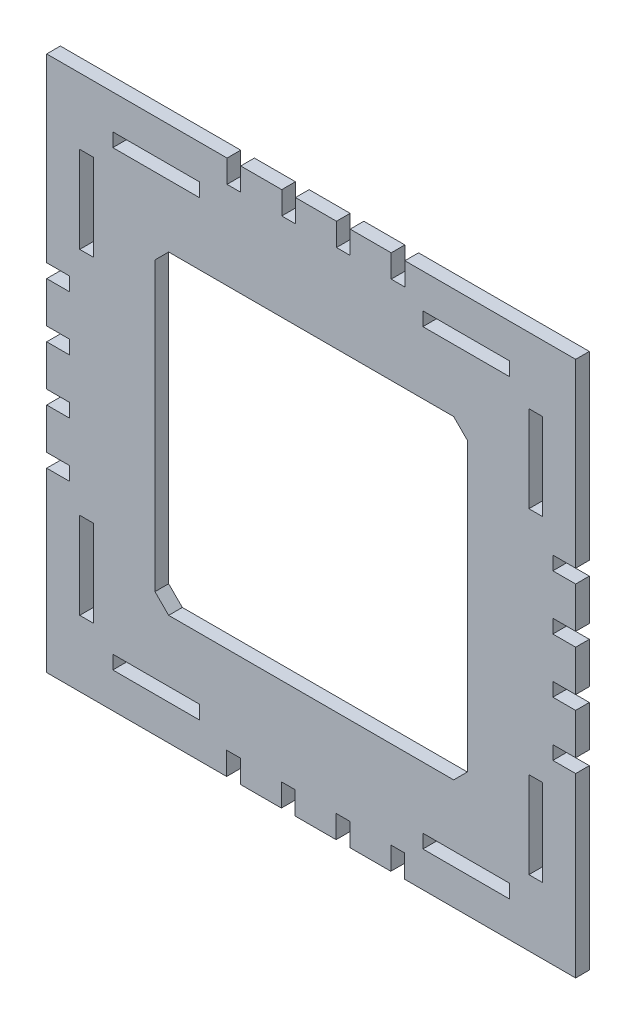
ISO-10303-21;
HEADER;
FILE_DESCRIPTION(('STEP AP214'),'2;1');
FILE_NAME('part.step','',(''),(''),'','','');
FILE_SCHEMA(('AUTOMOTIVE_DESIGN { 1 0 10303 214 1 1 1 1 }'));
ENDSEC;
DATA;
#1=APPLICATION_CONTEXT('core data for automotive mechanical design processes');
#2=APPLICATION_PROTOCOL_DEFINITION('international standard','automotive_design',2000,#1);
#3=PRODUCT_CONTEXT('',#1,'mechanical');
#4=PRODUCT('Part','Part','',(#3));
#5=PRODUCT_RELATED_PRODUCT_CATEGORY('part','',(#4));
#6=PRODUCT_DEFINITION_FORMATION('','',#4);
#7=PRODUCT_DEFINITION_CONTEXT('part definition',#1,'design');
#8=PRODUCT_DEFINITION('design','',#6,#7);
#9=PRODUCT_DEFINITION_SHAPE('','',#8);
#10=(LENGTH_UNIT() NAMED_UNIT(*) SI_UNIT(.MILLI.,.METRE.));
#11=(NAMED_UNIT(*) PLANE_ANGLE_UNIT() SI_UNIT($,.RADIAN.));
#12=(NAMED_UNIT(*) SI_UNIT($,.STERADIAN.) SOLID_ANGLE_UNIT());
#13=UNCERTAINTY_MEASURE_WITH_UNIT(LENGTH_MEASURE(1.E-05),#10,'distance_accuracy_value','');
#14=(GEOMETRIC_REPRESENTATION_CONTEXT(3) GLOBAL_UNCERTAINTY_ASSIGNED_CONTEXT((#13)) GLOBAL_UNIT_ASSIGNED_CONTEXT((#10,
#11,#12)) REPRESENTATION_CONTEXT('',''));
#15=CARTESIAN_POINT('',(0.,0.,0.));
#16=DIRECTION('',(0.,0.,1.));
#17=DIRECTION('',(1.,0.,0.));
#18=AXIS2_PLACEMENT_3D('',#15,#16,#17);
#19=CARTESIAN_POINT('',(0.,25.25,3.));
#20=DIRECTION('',(0.,-1.,0.));
#21=DIRECTION('',(0.,0.,-1.));
#22=AXIS2_PLACEMENT_3D('',#19,#20,#21);
#23=PLANE('',#22);
#24=DIRECTION('',(-1.,0.,0.));
#25=VECTOR('',#24,1.);
#26=CARTESIAN_POINT('',(0.,25.25,0.));
#27=LINE('',#26,#25);
#28=CARTESIAN_POINT('',(-47.75,25.25,0.));
#29=VERTEX_POINT('',#28);
#30=CARTESIAN_POINT('',(-50.75,25.25,0.));
#31=VERTEX_POINT('',#30);
#32=EDGE_CURVE('E1112',#29,#31,#27,.T.);
#33=ORIENTED_EDGE('',*,*,#32,.T.);
#34=DIRECTION('',(0.,0.,-1.));
#35=VECTOR('',#34,1.);
#36=CARTESIAN_POINT('',(-50.75,25.25,3.));
#37=LINE('',#36,#35);
#38=CARTESIAN_POINT('',(-50.75,25.25,3.));
#39=VERTEX_POINT('',#38);
#40=EDGE_CURVE('E11',#39,#31,#37,.T.);
#41=ORIENTED_EDGE('',*,*,#40,.F.);
#42=DIRECTION('',(-1.,0.,0.));
#43=VECTOR('',#42,1.);
#44=CARTESIAN_POINT('',(0.,25.25,3.));
#45=LINE('',#44,#43);
#46=CARTESIAN_POINT('',(-47.75,25.25,3.));
#47=VERTEX_POINT('',#46);
#48=EDGE_CURVE('E725',#47,#39,#45,.T.);
#49=ORIENTED_EDGE('',*,*,#48,.F.);
#50=DIRECTION('',(0.,0.,-1.));
#51=VECTOR('',#50,1.);
#52=CARTESIAN_POINT('',(-47.75,25.25,3.));
#53=LINE('',#52,#51);
#54=EDGE_CURVE('E65',#47,#29,#53,.T.);
#55=ORIENTED_EDGE('',*,*,#54,.T.);
#56=EDGE_LOOP('',(#33,#41,#49,#55));
#57=FACE_BOUND('',#56,.T.);
#58=ADVANCED_FACE('F45',(#57),#23,.F.);
#59=CARTESIAN_POINT('',(-50.75,0.,3.));
#60=DIRECTION('',(-1.,0.,0.));
#61=DIRECTION('',(0.,0.,1.));
#62=AXIS2_PLACEMENT_3D('',#59,#60,#61);
#63=PLANE('',#62);
#64=DIRECTION('',(0.,1.,0.));
#65=VECTOR('',#64,1.);
#66=CARTESIAN_POINT('',(-50.75,0.,0.));
#67=LINE('',#66,#65);
#68=CARTESIAN_POINT('',(-50.75,44.25,0.));
#69=VERTEX_POINT('',#68);
#70=EDGE_CURVE('E732',#31,#69,#67,.T.);
#71=ORIENTED_EDGE('',*,*,#70,.T.);
#72=DIRECTION('',(0.,0.,-1.));
#73=VECTOR('',#72,1.);
#74=CARTESIAN_POINT('',(-50.75,44.25,3.));
#75=LINE('',#74,#73);
#76=CARTESIAN_POINT('',(-50.75,44.25,3.));
#77=VERTEX_POINT('',#76);
#78=EDGE_CURVE('E56',#77,#69,#75,.T.);
#79=ORIENTED_EDGE('',*,*,#78,.F.);
#80=DIRECTION('',(0.,1.,0.));
#81=VECTOR('',#80,1.);
#82=CARTESIAN_POINT('',(-50.75,0.,3.));
#83=LINE('',#82,#81);
#84=EDGE_CURVE('E719',#39,#77,#83,.T.);
#85=ORIENTED_EDGE('',*,*,#84,.F.);
#86=ORIENTED_EDGE('',*,*,#40,.T.);
#87=EDGE_LOOP('',(#71,#79,#85,#86));
#88=FACE_BOUND('',#87,.T.);
#89=ADVANCED_FACE('F731',(#88),#63,.F.);
#90=CARTESIAN_POINT('',(0.,44.25,3.));
#91=DIRECTION('',(0.,-1.,0.));
#92=DIRECTION('',(0.,0.,-1.));
#93=AXIS2_PLACEMENT_3D('',#90,#91,#92);
#94=PLANE('',#93);
#95=DIRECTION('',(-1.,0.,0.));
#96=VECTOR('',#95,1.);
#97=CARTESIAN_POINT('',(0.,44.25,0.));
#98=LINE('',#97,#96);
#99=CARTESIAN_POINT('',(-47.75,44.25,0.));
#100=VERTEX_POINT('',#99);
#101=EDGE_CURVE('E1117',#100,#69,#98,.T.);
#102=ORIENTED_EDGE('',*,*,#101,.F.);
#103=DIRECTION('',(0.,0.,-1.));
#104=VECTOR('',#103,1.);
#105=CARTESIAN_POINT('',(-47.75,44.25,3.));
#106=LINE('',#105,#104);
#107=CARTESIAN_POINT('',(-47.75,44.25,3.));
#108=VERTEX_POINT('',#107);
#109=EDGE_CURVE('E391',#108,#100,#106,.T.);
#110=ORIENTED_EDGE('',*,*,#109,.F.);
#111=DIRECTION('',(-1.,0.,0.));
#112=VECTOR('',#111,1.);
#113=CARTESIAN_POINT('',(0.,44.25,3.));
#114=LINE('',#113,#112);
#115=EDGE_CURVE('E724',#108,#77,#114,.T.);
#116=ORIENTED_EDGE('',*,*,#115,.T.);
#117=ORIENTED_EDGE('',*,*,#78,.T.);
#118=EDGE_LOOP('',(#102,#110,#116,#117));
#119=FACE_BOUND('',#118,.T.);
#120=ADVANCED_FACE('F737',(#119),#94,.T.);
#121=CARTESIAN_POINT('',(0.,-44.25,3.));
#122=DIRECTION('',(0.,-1.,0.));
#123=DIRECTION('',(0.,0.,-1.));
#124=AXIS2_PLACEMENT_3D('',#121,#122,#123);
#125=PLANE('',#124);
#126=DIRECTION('',(-1.,0.,0.));
#127=VECTOR('',#126,1.);
#128=CARTESIAN_POINT('',(0.,-44.25,0.));
#129=LINE('',#128,#127);
#130=CARTESIAN_POINT('',(-47.75,-44.25,0.));
#131=VERTEX_POINT('',#130);
#132=CARTESIAN_POINT('',(-50.75,-44.25,0.));
#133=VERTEX_POINT('',#132);
#134=EDGE_CURVE('E1096',#131,#133,#129,.T.);
#135=ORIENTED_EDGE('',*,*,#134,.T.);
#136=DIRECTION('',(0.,0.,-1.));
#137=VECTOR('',#136,1.);
#138=CARTESIAN_POINT('',(-50.75,-44.25,3.));
#139=LINE('',#138,#137);
#140=CARTESIAN_POINT('',(-50.75,-44.25,3.));
#141=VERTEX_POINT('',#140);
#142=EDGE_CURVE('E1127',#141,#133,#139,.T.);
#143=ORIENTED_EDGE('',*,*,#142,.F.);
#144=DIRECTION('',(-1.,0.,0.));
#145=VECTOR('',#144,1.);
#146=CARTESIAN_POINT('',(0.,-44.25,3.));
#147=LINE('',#146,#145);
#148=CARTESIAN_POINT('',(-47.75,-44.25,3.));
#149=VERTEX_POINT('',#148);
#150=EDGE_CURVE('E1809',#149,#141,#147,.T.);
#151=ORIENTED_EDGE('',*,*,#150,.F.);
#152=DIRECTION('',(0.,0.,-1.));
#153=VECTOR('',#152,1.);
#154=CARTESIAN_POINT('',(-47.75,-44.25,3.));
#155=LINE('',#154,#153);
#156=EDGE_CURVE('E1130',#149,#131,#155,.T.);
#157=ORIENTED_EDGE('',*,*,#156,.T.);
#158=EDGE_LOOP('',(#135,#143,#151,#157));
#159=FACE_BOUND('',#158,.T.);
#160=ADVANCED_FACE('F2170',(#159),#125,.F.);
#161=CARTESIAN_POINT('',(-50.75,0.,3.));
#162=DIRECTION('',(-1.,0.,0.));
#163=DIRECTION('',(0.,0.,1.));
#164=AXIS2_PLACEMENT_3D('',#161,#162,#163);
#165=PLANE('',#164);
#166=DIRECTION('',(0.,1.,0.));
#167=VECTOR('',#166,1.);
#168=CARTESIAN_POINT('',(-50.75,0.,0.));
#169=LINE('',#168,#167);
#170=CARTESIAN_POINT('',(-50.75,-25.25,0.));
#171=VERTEX_POINT('',#170);
#172=EDGE_CURVE('E1100',#133,#171,#169,.T.);
#173=ORIENTED_EDGE('',*,*,#172,.T.);
#174=DIRECTION('',(0.,0.,-1.));
#175=VECTOR('',#174,1.);
#176=CARTESIAN_POINT('',(-50.75,-25.25,3.));
#177=LINE('',#176,#175);
#178=CARTESIAN_POINT('',(-50.75,-25.25,3.));
#179=VERTEX_POINT('',#178);
#180=EDGE_CURVE('E1137',#179,#171,#177,.T.);
#181=ORIENTED_EDGE('',*,*,#180,.F.);
#182=DIRECTION('',(0.,1.,0.));
#183=VECTOR('',#182,1.);
#184=CARTESIAN_POINT('',(-50.75,0.,3.));
#185=LINE('',#184,#183);
#186=EDGE_CURVE('E1813',#141,#179,#185,.T.);
#187=ORIENTED_EDGE('',*,*,#186,.F.);
#188=ORIENTED_EDGE('',*,*,#142,.T.);
#189=EDGE_LOOP('',(#173,#181,#187,#188));
#190=FACE_BOUND('',#189,.T.);
#191=ADVANCED_FACE('F2166',(#190),#165,.F.);
#192=CARTESIAN_POINT('',(0.,-25.25,3.));
#193=DIRECTION('',(0.,-1.,0.));
#194=DIRECTION('',(0.,0.,-1.));
#195=AXIS2_PLACEMENT_3D('',#192,#193,#194);
#196=PLANE('',#195);
#197=DIRECTION('',(-1.,0.,0.));
#198=VECTOR('',#197,1.);
#199=CARTESIAN_POINT('',(0.,-25.25,0.));
#200=LINE('',#199,#198);
#201=CARTESIAN_POINT('',(-47.75,-25.25,0.));
#202=VERTEX_POINT('',#201);
#203=EDGE_CURVE('E1104',#202,#171,#200,.T.);
#204=ORIENTED_EDGE('',*,*,#203,.F.);
#205=DIRECTION('',(0.,0.,-1.));
#206=VECTOR('',#205,1.);
#207=CARTESIAN_POINT('',(-47.75,-25.25,3.));
#208=LINE('',#207,#206);
#209=CARTESIAN_POINT('',(-47.75,-25.25,3.));
#210=VERTEX_POINT('',#209);
#211=EDGE_CURVE('E1133',#210,#202,#208,.T.);
#212=ORIENTED_EDGE('',*,*,#211,.F.);
#213=DIRECTION('',(-1.,0.,0.));
#214=VECTOR('',#213,1.);
#215=CARTESIAN_POINT('',(0.,-25.25,3.));
#216=LINE('',#215,#214);
#217=EDGE_CURVE('E1816',#210,#179,#216,.T.);
#218=ORIENTED_EDGE('',*,*,#217,.T.);
#219=ORIENTED_EDGE('',*,*,#180,.T.);
#220=EDGE_LOOP('',(#204,#212,#218,#219));
#221=FACE_BOUND('',#220,.T.);
#222=ADVANCED_FACE('F2162',(#221),#196,.T.);
#223=CARTESIAN_POINT('',(0.,-25.25,3.));
#224=DIRECTION('',(0.,1.,0.));
#225=DIRECTION('',(0.,0.,1.));
#226=AXIS2_PLACEMENT_3D('',#223,#224,#225);
#227=PLANE('',#226);
#228=DIRECTION('',(1.,0.,0.));
#229=VECTOR('',#228,1.);
#230=CARTESIAN_POINT('',(0.,-25.25,0.));
#231=LINE('',#230,#229);
#232=CARTESIAN_POINT('',(47.75,-25.25,0.));
#233=VERTEX_POINT('',#232);
#234=CARTESIAN_POINT('',(50.75,-25.25,0.));
#235=VERTEX_POINT('',#234);
#236=EDGE_CURVE('E1080',#233,#235,#231,.T.);
#237=ORIENTED_EDGE('',*,*,#236,.T.);
#238=DIRECTION('',(0.,0.,-1.));
#239=VECTOR('',#238,1.);
#240=CARTESIAN_POINT('',(50.75,-25.25,3.));
#241=LINE('',#240,#239);
#242=CARTESIAN_POINT('',(50.75,-25.25,3.));
#243=VERTEX_POINT('',#242);
#244=EDGE_CURVE('E1134',#243,#235,#241,.T.);
#245=ORIENTED_EDGE('',*,*,#244,.F.);
#246=DIRECTION('',(1.,0.,0.));
#247=VECTOR('',#246,1.);
#248=CARTESIAN_POINT('',(0.,-25.25,3.));
#249=LINE('',#248,#247);
#250=CARTESIAN_POINT('',(47.75,-25.25,3.));
#251=VERTEX_POINT('',#250);
#252=EDGE_CURVE('E1794',#251,#243,#249,.T.);
#253=ORIENTED_EDGE('',*,*,#252,.F.);
#254=DIRECTION('',(0.,0.,-1.));
#255=VECTOR('',#254,1.);
#256=CARTESIAN_POINT('',(47.75,-25.25,3.));
#257=LINE('',#256,#255);
#258=EDGE_CURVE('E1143',#251,#233,#257,.T.);
#259=ORIENTED_EDGE('',*,*,#258,.T.);
#260=EDGE_LOOP('',(#237,#245,#253,#259));
#261=FACE_BOUND('',#260,.T.);
#262=ADVANCED_FACE('F2165',(#261),#227,.F.);
#263=CARTESIAN_POINT('',(50.75,0.,3.));
#264=DIRECTION('',(1.,0.,0.));
#265=DIRECTION('',(0.,1.,0.));
#266=AXIS2_PLACEMENT_3D('',#263,#264,#265);
#267=PLANE('',#266);
#268=DIRECTION('',(0.,-1.,0.));
#269=VECTOR('',#268,1.);
#270=CARTESIAN_POINT('',(50.75,0.,0.));
#271=LINE('',#270,#269);
#272=CARTESIAN_POINT('',(50.75,-44.25,0.));
#273=VERTEX_POINT('',#272);
#274=EDGE_CURVE('E1084',#235,#273,#271,.T.);
#275=ORIENTED_EDGE('',*,*,#274,.T.);
#276=DIRECTION('',(0.,0.,-1.));
#277=VECTOR('',#276,1.);
#278=CARTESIAN_POINT('',(50.75,-44.25,3.));
#279=LINE('',#278,#277);
#280=CARTESIAN_POINT('',(50.75,-44.25,3.));
#281=VERTEX_POINT('',#280);
#282=EDGE_CURVE('E1150',#281,#273,#279,.T.);
#283=ORIENTED_EDGE('',*,*,#282,.F.);
#284=DIRECTION('',(0.,-1.,0.));
#285=VECTOR('',#284,1.);
#286=CARTESIAN_POINT('',(50.75,0.,3.));
#287=LINE('',#286,#285);
#288=EDGE_CURVE('E1798',#243,#281,#287,.T.);
#289=ORIENTED_EDGE('',*,*,#288,.F.);
#290=ORIENTED_EDGE('',*,*,#244,.T.);
#291=EDGE_LOOP('',(#275,#283,#289,#290));
#292=FACE_BOUND('',#291,.T.);
#293=ADVANCED_FACE('F2183',(#292),#267,.F.);
#294=CARTESIAN_POINT('',(1.02348685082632E-13,-44.2500000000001,3.));
#295=DIRECTION('',(0.,1.,0.));
#296=DIRECTION('',(-1.,0.,0.));
#297=AXIS2_PLACEMENT_3D('',#294,#295,#296);
#298=PLANE('',#297);
#299=DIRECTION('',(1.,0.,0.));
#300=VECTOR('',#299,1.);
#301=CARTESIAN_POINT('',(1.02348685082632E-13,-44.2500000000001,0.));
#302=LINE('',#301,#300);
#303=CARTESIAN_POINT('',(47.75,-44.25,0.));
#304=VERTEX_POINT('',#303);
#305=EDGE_CURVE('E1088',#304,#273,#302,.T.);
#306=ORIENTED_EDGE('',*,*,#305,.F.);
#307=DIRECTION('',(0.,0.,-1.));
#308=VECTOR('',#307,1.);
#309=CARTESIAN_POINT('',(47.75,-44.25,3.));
#310=LINE('',#309,#308);
#311=CARTESIAN_POINT('',(47.75,-44.25,3.));
#312=VERTEX_POINT('',#311);
#313=EDGE_CURVE('E1146',#312,#304,#310,.T.);
#314=ORIENTED_EDGE('',*,*,#313,.F.);
#315=DIRECTION('',(1.,0.,0.));
#316=VECTOR('',#315,1.);
#317=CARTESIAN_POINT('',(1.02348685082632E-13,-44.2500000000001,3.));
#318=LINE('',#317,#316);
#319=EDGE_CURVE('E1801',#312,#281,#318,.T.);
#320=ORIENTED_EDGE('',*,*,#319,.T.);
#321=ORIENTED_EDGE('',*,*,#282,.T.);
#322=EDGE_LOOP('',(#306,#314,#320,#321));
#323=FACE_BOUND('',#322,.T.);
#324=ADVANCED_FACE('F2179',(#323),#298,.T.);
#325=CARTESIAN_POINT('',(0.,44.25,3.));
#326=DIRECTION('',(0.,1.,0.));
#327=DIRECTION('',(0.,0.,1.));
#328=AXIS2_PLACEMENT_3D('',#325,#326,#327);
#329=PLANE('',#328);
#330=DIRECTION('',(1.,0.,0.));
#331=VECTOR('',#330,1.);
#332=CARTESIAN_POINT('',(0.,44.25,0.));
#333=LINE('',#332,#331);
#334=CARTESIAN_POINT('',(47.75,44.25,0.));
#335=VERTEX_POINT('',#334);
#336=CARTESIAN_POINT('',(50.75,44.25,0.));
#337=VERTEX_POINT('',#336);
#338=EDGE_CURVE('E1064',#335,#337,#333,.T.);
#339=ORIENTED_EDGE('',*,*,#338,.T.);
#340=DIRECTION('',(0.,0.,-1.));
#341=VECTOR('',#340,1.);
#342=CARTESIAN_POINT('',(50.75,44.25,3.));
#343=LINE('',#342,#341);
#344=CARTESIAN_POINT('',(50.75,44.25,3.));
#345=VERTEX_POINT('',#344);
#346=EDGE_CURVE('E1147',#345,#337,#343,.T.);
#347=ORIENTED_EDGE('',*,*,#346,.F.);
#348=DIRECTION('',(1.,0.,0.));
#349=VECTOR('',#348,1.);
#350=CARTESIAN_POINT('',(0.,44.25,3.));
#351=LINE('',#350,#349);
#352=CARTESIAN_POINT('',(47.75,44.25,3.));
#353=VERTEX_POINT('',#352);
#354=EDGE_CURVE('E1779',#353,#345,#351,.T.);
#355=ORIENTED_EDGE('',*,*,#354,.F.);
#356=DIRECTION('',(0.,0.,-1.));
#357=VECTOR('',#356,1.);
#358=CARTESIAN_POINT('',(47.75,44.25,3.));
#359=LINE('',#358,#357);
#360=EDGE_CURVE('E1156',#353,#335,#359,.T.);
#361=ORIENTED_EDGE('',*,*,#360,.T.);
#362=EDGE_LOOP('',(#339,#347,#355,#361));
#363=FACE_BOUND('',#362,.T.);
#364=ADVANCED_FACE('F2182',(#363),#329,.F.);
#365=CARTESIAN_POINT('',(50.75,0.,3.));
#366=DIRECTION('',(1.,0.,0.));
#367=DIRECTION('',(0.,1.,0.));
#368=AXIS2_PLACEMENT_3D('',#365,#366,#367);
#369=PLANE('',#368);
#370=DIRECTION('',(0.,-1.,0.));
#371=VECTOR('',#370,1.);
#372=CARTESIAN_POINT('',(50.75,0.,0.));
#373=LINE('',#372,#371);
#374=CARTESIAN_POINT('',(50.75,25.25,0.));
#375=VERTEX_POINT('',#374);
#376=EDGE_CURVE('E1068',#337,#375,#373,.T.);
#377=ORIENTED_EDGE('',*,*,#376,.T.);
#378=DIRECTION('',(0.,0.,-1.));
#379=VECTOR('',#378,1.);
#380=CARTESIAN_POINT('',(50.75,25.25,3.));
#381=LINE('',#380,#379);
#382=CARTESIAN_POINT('',(50.75,25.25,3.));
#383=VERTEX_POINT('',#382);
#384=EDGE_CURVE('E1163',#383,#375,#381,.T.);
#385=ORIENTED_EDGE('',*,*,#384,.F.);
#386=DIRECTION('',(0.,-1.,0.));
#387=VECTOR('',#386,1.);
#388=CARTESIAN_POINT('',(50.75,0.,3.));
#389=LINE('',#388,#387);
#390=EDGE_CURVE('E1783',#345,#383,#389,.T.);
#391=ORIENTED_EDGE('',*,*,#390,.F.);
#392=ORIENTED_EDGE('',*,*,#346,.T.);
#393=EDGE_LOOP('',(#377,#385,#391,#392));
#394=FACE_BOUND('',#393,.T.);
#395=ADVANCED_FACE('F2199',(#394),#369,.F.);
#396=CARTESIAN_POINT('',(0.,25.25,3.));
#397=DIRECTION('',(0.,1.,0.));
#398=DIRECTION('',(-1.,0.,0.));
#399=AXIS2_PLACEMENT_3D('',#396,#397,#398);
#400=PLANE('',#399);
#401=DIRECTION('',(1.,0.,0.));
#402=VECTOR('',#401,1.);
#403=CARTESIAN_POINT('',(0.,25.25,0.));
#404=LINE('',#403,#402);
#405=CARTESIAN_POINT('',(47.75,25.25,0.));
#406=VERTEX_POINT('',#405);
#407=EDGE_CURVE('E1072',#406,#375,#404,.T.);
#408=ORIENTED_EDGE('',*,*,#407,.F.);
#409=DIRECTION('',(0.,0.,-1.));
#410=VECTOR('',#409,1.);
#411=CARTESIAN_POINT('',(47.75,25.25,3.));
#412=LINE('',#411,#410);
#413=CARTESIAN_POINT('',(47.75,25.25,3.));
#414=VERTEX_POINT('',#413);
#415=EDGE_CURVE('E1159',#414,#406,#412,.T.);
#416=ORIENTED_EDGE('',*,*,#415,.F.);
#417=DIRECTION('',(1.,0.,0.));
#418=VECTOR('',#417,1.);
#419=CARTESIAN_POINT('',(0.,25.25,3.));
#420=LINE('',#419,#418);
#421=EDGE_CURVE('E1786',#414,#383,#420,.T.);
#422=ORIENTED_EDGE('',*,*,#421,.T.);
#423=ORIENTED_EDGE('',*,*,#384,.T.);
#424=EDGE_LOOP('',(#408,#416,#422,#423));
#425=FACE_BOUND('',#424,.T.);
#426=ADVANCED_FACE('F2195',(#425),#400,.T.);
#427=CARTESIAN_POINT('',(0.,51.2,3.));
#428=DIRECTION('',(0.,1.,0.));
#429=DIRECTION('',(0.,0.,1.));
#430=AXIS2_PLACEMENT_3D('',#427,#428,#429);
#431=PLANE('',#430);
#432=DIRECTION('',(1.,0.,0.));
#433=VECTOR('',#432,1.);
#434=CARTESIAN_POINT('',(0.,51.2,0.));
#435=LINE('',#434,#433);
#436=CARTESIAN_POINT('',(24.5,51.2,0.));
#437=VERTEX_POINT('',#436);
#438=CARTESIAN_POINT('',(43.5,51.2,0.));
#439=VERTEX_POINT('',#438);
#440=EDGE_CURVE('E1048',#437,#439,#435,.T.);
#441=ORIENTED_EDGE('',*,*,#440,.T.);
#442=DIRECTION('',(0.,0.,-1.));
#443=VECTOR('',#442,1.);
#444=CARTESIAN_POINT('',(43.5,51.2,3.));
#445=LINE('',#444,#443);
#446=CARTESIAN_POINT('',(43.5,51.2,3.));
#447=VERTEX_POINT('',#446);
#448=EDGE_CURVE('E1160',#447,#439,#445,.T.);
#449=ORIENTED_EDGE('',*,*,#448,.F.);
#450=DIRECTION('',(1.,0.,0.));
#451=VECTOR('',#450,1.);
#452=CARTESIAN_POINT('',(0.,51.2,3.));
#453=LINE('',#452,#451);
#454=CARTESIAN_POINT('',(24.5,51.2,3.));
#455=VERTEX_POINT('',#454);
#456=EDGE_CURVE('E1764',#455,#447,#453,.T.);
#457=ORIENTED_EDGE('',*,*,#456,.F.);
#458=DIRECTION('',(0.,0.,-1.));
#459=VECTOR('',#458,1.);
#460=CARTESIAN_POINT('',(24.5,51.2,3.));
#461=LINE('',#460,#459);
#462=EDGE_CURVE('E1169',#455,#437,#461,.T.);
#463=ORIENTED_EDGE('',*,*,#462,.T.);
#464=EDGE_LOOP('',(#441,#449,#457,#463));
#465=FACE_BOUND('',#464,.T.);
#466=ADVANCED_FACE('F2198',(#465),#431,.F.);
#467=CARTESIAN_POINT('',(43.5,0.,3.));
#468=DIRECTION('',(1.,0.,0.));
#469=DIRECTION('',(0.,0.,-1.));
#470=AXIS2_PLACEMENT_3D('',#467,#468,#469);
#471=PLANE('',#470);
#472=DIRECTION('',(0.,-1.,0.));
#473=VECTOR('',#472,1.);
#474=CARTESIAN_POINT('',(43.5,0.,0.));
#475=LINE('',#474,#473);
#476=CARTESIAN_POINT('',(43.5,48.2,0.));
#477=VERTEX_POINT('',#476);
#478=EDGE_CURVE('E1052',#439,#477,#475,.T.);
#479=ORIENTED_EDGE('',*,*,#478,.T.);
#480=DIRECTION('',(0.,0.,-1.));
#481=VECTOR('',#480,1.);
#482=CARTESIAN_POINT('',(43.5,48.2,3.));
#483=LINE('',#482,#481);
#484=CARTESIAN_POINT('',(43.5,48.2,3.));
#485=VERTEX_POINT('',#484);
#486=EDGE_CURVE('E1176',#485,#477,#483,.T.);
#487=ORIENTED_EDGE('',*,*,#486,.F.);
#488=DIRECTION('',(0.,-1.,0.));
#489=VECTOR('',#488,1.);
#490=CARTESIAN_POINT('',(43.5,0.,3.));
#491=LINE('',#490,#489);
#492=EDGE_CURVE('E1768',#447,#485,#491,.T.);
#493=ORIENTED_EDGE('',*,*,#492,.F.);
#494=ORIENTED_EDGE('',*,*,#448,.T.);
#495=EDGE_LOOP('',(#479,#487,#493,#494));
#496=FACE_BOUND('',#495,.T.);
#497=ADVANCED_FACE('F2215',(#496),#471,.F.);
#498=CARTESIAN_POINT('',(0.,48.2,3.));
#499=DIRECTION('',(0.,1.,0.));
#500=DIRECTION('',(0.,0.,1.));
#501=AXIS2_PLACEMENT_3D('',#498,#499,#500);
#502=PLANE('',#501);
#503=DIRECTION('',(1.,0.,0.));
#504=VECTOR('',#503,1.);
#505=CARTESIAN_POINT('',(0.,48.2,0.));
#506=LINE('',#505,#504);
#507=CARTESIAN_POINT('',(24.5,48.2,0.));
#508=VERTEX_POINT('',#507);
#509=EDGE_CURVE('E1056',#508,#477,#506,.T.);
#510=ORIENTED_EDGE('',*,*,#509,.F.);
#511=DIRECTION('',(0.,0.,-1.));
#512=VECTOR('',#511,1.);
#513=CARTESIAN_POINT('',(24.5,48.2,3.));
#514=LINE('',#513,#512);
#515=CARTESIAN_POINT('',(24.5,48.2,3.));
#516=VERTEX_POINT('',#515);
#517=EDGE_CURVE('E1172',#516,#508,#514,.T.);
#518=ORIENTED_EDGE('',*,*,#517,.F.);
#519=DIRECTION('',(1.,0.,0.));
#520=VECTOR('',#519,1.);
#521=CARTESIAN_POINT('',(0.,48.2,3.));
#522=LINE('',#521,#520);
#523=EDGE_CURVE('E1771',#516,#485,#522,.T.);
#524=ORIENTED_EDGE('',*,*,#523,.T.);
#525=ORIENTED_EDGE('',*,*,#486,.T.);
#526=EDGE_LOOP('',(#510,#518,#524,#525));
#527=FACE_BOUND('',#526,.T.);
#528=ADVANCED_FACE('F2211',(#527),#502,.T.);
#529=CARTESIAN_POINT('',(0.,-34.5,3.));
#530=DIRECTION('',(0.,-1.,0.));
#531=DIRECTION('',(1.,0.,0.));
#532=AXIS2_PLACEMENT_3D('',#529,#530,#531);
#533=PLANE('',#532);
#534=DIRECTION('',(-1.,0.,0.));
#535=VECTOR('',#534,1.);
#536=CARTESIAN_POINT('',(0.,-34.5,0.));
#537=LINE('',#536,#535);
#538=CARTESIAN_POINT('',(31.25,-34.5,0.));
#539=VERTEX_POINT('',#538);
#540=CARTESIAN_POINT('',(-31.25,-34.5,0.));
#541=VERTEX_POINT('',#540);
#542=EDGE_CURVE('E1018',#539,#541,#537,.T.);
#543=ORIENTED_EDGE('',*,*,#542,.T.);
#544=DIRECTION('',(0.,0.,-1.));
#545=VECTOR('',#544,1.);
#546=CARTESIAN_POINT('',(-31.25,-34.5,3.));
#547=LINE('',#546,#545);
#548=CARTESIAN_POINT('',(-31.25,-34.5,3.));
#549=VERTEX_POINT('',#548);
#550=EDGE_CURVE('E1173',#549,#541,#547,.T.);
#551=ORIENTED_EDGE('',*,*,#550,.F.);
#552=DIRECTION('',(-1.,0.,0.));
#553=VECTOR('',#552,1.);
#554=CARTESIAN_POINT('',(0.,-34.5,3.));
#555=LINE('',#554,#553);
#556=CARTESIAN_POINT('',(31.25,-34.5,3.));
#557=VERTEX_POINT('',#556);
#558=EDGE_CURVE('E1735',#557,#549,#555,.T.);
#559=ORIENTED_EDGE('',*,*,#558,.F.);
#560=DIRECTION('',(0.,0.,-1.));
#561=VECTOR('',#560,1.);
#562=CARTESIAN_POINT('',(31.25,-34.5,3.));
#563=LINE('',#562,#561);
#564=EDGE_CURVE('E1182',#557,#539,#563,.T.);
#565=ORIENTED_EDGE('',*,*,#564,.T.);
#566=EDGE_LOOP('',(#543,#551,#559,#565));
#567=FACE_BOUND('',#566,.T.);
#568=ADVANCED_FACE('F2214',(#567),#533,.F.);
#569=CARTESIAN_POINT('',(-32.875,-32.875,3.));
#570=DIRECTION('',(-0.707106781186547,-0.707106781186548,0.));
#571=DIRECTION('',(0.707106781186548,-0.707106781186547,0.));
#572=AXIS2_PLACEMENT_3D('',#569,#570,#571);
#573=PLANE('',#572);
#574=DIRECTION('',(-0.707106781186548,0.707106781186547,0.));
#575=VECTOR('',#574,1.);
#576=CARTESIAN_POINT('',(-32.875,-32.875,0.));
#577=LINE('',#576,#575);
#578=CARTESIAN_POINT('',(-34.25,-31.5,0.));
#579=VERTEX_POINT('',#578);
#580=EDGE_CURVE('E1022',#541,#579,#577,.T.);
#581=ORIENTED_EDGE('',*,*,#580,.T.);
#582=DIRECTION('',(0.,0.,-1.));
#583=VECTOR('',#582,1.);
#584=CARTESIAN_POINT('',(-34.25,-31.5,3.));
#585=LINE('',#584,#583);
#586=CARTESIAN_POINT('',(-34.25,-31.5,3.));
#587=VERTEX_POINT('',#586);
#588=EDGE_CURVE('E1202',#587,#579,#585,.T.);
#589=ORIENTED_EDGE('',*,*,#588,.F.);
#590=DIRECTION('',(-0.707106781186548,0.707106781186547,0.));
#591=VECTOR('',#590,1.);
#592=CARTESIAN_POINT('',(-32.875,-32.875,3.));
#593=LINE('',#592,#591);
#594=EDGE_CURVE('E1739',#549,#587,#593,.T.);
#595=ORIENTED_EDGE('',*,*,#594,.F.);
#596=ORIENTED_EDGE('',*,*,#550,.T.);
#597=EDGE_LOOP('',(#581,#589,#595,#596));
#598=FACE_BOUND('',#597,.T.);
#599=ADVANCED_FACE('F2247',(#598),#573,.F.);
#600=CARTESIAN_POINT('',(-34.25,0.,3.));
#601=DIRECTION('',(-1.,0.,0.));
#602=DIRECTION('',(0.,0.,1.));
#603=AXIS2_PLACEMENT_3D('',#600,#601,#602);
#604=PLANE('',#603);
#605=DIRECTION('',(0.,1.,0.));
#606=VECTOR('',#605,1.);
#607=CARTESIAN_POINT('',(-34.25,0.,0.));
#608=LINE('',#607,#606);
#609=CARTESIAN_POINT('',(-34.25,31.5,0.));
#610=VERTEX_POINT('',#609);
#611=EDGE_CURVE('E1025',#579,#610,#608,.T.);
#612=ORIENTED_EDGE('',*,*,#611,.T.);
#613=DIRECTION('',(0.,0.,-1.));
#614=VECTOR('',#613,1.);
#615=CARTESIAN_POINT('',(-34.25,31.5,3.));
#616=LINE('',#615,#614);
#617=CARTESIAN_POINT('',(-34.25,31.5,3.));
#618=VERTEX_POINT('',#617);
#619=EDGE_CURVE('E1199',#618,#610,#616,.T.);
#620=ORIENTED_EDGE('',*,*,#619,.F.);
#621=DIRECTION('',(0.,1.,0.));
#622=VECTOR('',#621,1.);
#623=CARTESIAN_POINT('',(-34.25,0.,3.));
#624=LINE('',#623,#622);
#625=EDGE_CURVE('E1742',#587,#618,#624,.T.);
#626=ORIENTED_EDGE('',*,*,#625,.F.);
#627=ORIENTED_EDGE('',*,*,#588,.T.);
#628=EDGE_LOOP('',(#612,#620,#626,#627));
#629=FACE_BOUND('',#628,.T.);
#630=ADVANCED_FACE('F2243',(#629),#604,.F.);
#631=CARTESIAN_POINT('',(-32.875,32.875,3.));
#632=DIRECTION('',(0.707106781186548,-0.707106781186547,0.));
#633=DIRECTION('',(0.707106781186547,0.707106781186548,0.));
#634=AXIS2_PLACEMENT_3D('',#631,#632,#633);
#635=PLANE('',#634);
#636=DIRECTION('',(-0.707106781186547,-0.707106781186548,0.));
#637=VECTOR('',#636,1.);
#638=CARTESIAN_POINT('',(-32.875,32.875,0.));
#639=LINE('',#638,#637);
#640=CARTESIAN_POINT('',(-31.25,34.5,0.));
#641=VERTEX_POINT('',#640);
#642=EDGE_CURVE('E1029',#641,#610,#639,.T.);
#643=ORIENTED_EDGE('',*,*,#642,.F.);
#644=DIRECTION('',(0.,0.,-1.));
#645=VECTOR('',#644,1.);
#646=CARTESIAN_POINT('',(-31.25,34.5,3.));
#647=LINE('',#646,#645);
#648=CARTESIAN_POINT('',(-31.25,34.5,3.));
#649=VERTEX_POINT('',#648);
#650=EDGE_CURVE('E1196',#649,#641,#647,.T.);
#651=ORIENTED_EDGE('',*,*,#650,.F.);
#652=DIRECTION('',(-0.707106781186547,-0.707106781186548,0.));
#653=VECTOR('',#652,1.);
#654=CARTESIAN_POINT('',(-32.875,32.875,3.));
#655=LINE('',#654,#653);
#656=EDGE_CURVE('E1745',#649,#618,#655,.T.);
#657=ORIENTED_EDGE('',*,*,#656,.T.);
#658=ORIENTED_EDGE('',*,*,#619,.T.);
#659=EDGE_LOOP('',(#643,#651,#657,#658));
#660=FACE_BOUND('',#659,.T.);
#661=ADVANCED_FACE('F2239',(#660),#635,.T.);
#662=CARTESIAN_POINT('',(0.,34.5,3.));
#663=DIRECTION('',(0.,-1.,0.));
#664=DIRECTION('',(1.,0.,0.));
#665=AXIS2_PLACEMENT_3D('',#662,#663,#664);
#666=PLANE('',#665);
#667=DIRECTION('',(-1.,0.,0.));
#668=VECTOR('',#667,1.);
#669=CARTESIAN_POINT('',(0.,34.5,0.));
#670=LINE('',#669,#668);
#671=CARTESIAN_POINT('',(31.25,34.5,0.));
#672=VERTEX_POINT('',#671);
#673=EDGE_CURVE('E1033',#672,#641,#670,.T.);
#674=ORIENTED_EDGE('',*,*,#673,.F.);
#675=DIRECTION('',(0.,0.,-1.));
#676=VECTOR('',#675,1.);
#677=CARTESIAN_POINT('',(31.25,34.5,3.));
#678=LINE('',#677,#676);
#679=CARTESIAN_POINT('',(31.25,34.5,3.));
#680=VERTEX_POINT('',#679);
#681=EDGE_CURVE('E1193',#680,#672,#678,.T.);
#682=ORIENTED_EDGE('',*,*,#681,.F.);
#683=DIRECTION('',(-1.,0.,0.));
#684=VECTOR('',#683,1.);
#685=CARTESIAN_POINT('',(0.,34.5,3.));
#686=LINE('',#685,#684);
#687=EDGE_CURVE('E1749',#680,#649,#686,.T.);
#688=ORIENTED_EDGE('',*,*,#687,.T.);
#689=ORIENTED_EDGE('',*,*,#650,.T.);
#690=EDGE_LOOP('',(#674,#682,#688,#689));
#691=FACE_BOUND('',#690,.T.);
#692=ADVANCED_FACE('F2235',(#691),#666,.T.);
#693=CARTESIAN_POINT('',(32.875,32.875,3.));
#694=DIRECTION('',(-0.707106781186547,-0.707106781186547,0.));
#695=DIRECTION('',(0.707106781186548,-0.707106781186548,0.));
#696=AXIS2_PLACEMENT_3D('',#693,#694,#695);
#697=PLANE('',#696);
#698=DIRECTION('',(-0.707106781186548,0.707106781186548,0.));
#699=VECTOR('',#698,1.);
#700=CARTESIAN_POINT('',(32.875,32.875,0.));
#701=LINE('',#700,#699);
#702=CARTESIAN_POINT('',(34.25,31.5,0.));
#703=VERTEX_POINT('',#702);
#704=EDGE_CURVE('E1037',#703,#672,#701,.T.);
#705=ORIENTED_EDGE('',*,*,#704,.F.);
#706=DIRECTION('',(0.,0.,-1.));
#707=VECTOR('',#706,1.);
#708=CARTESIAN_POINT('',(34.25,31.5,3.));
#709=LINE('',#708,#707);
#710=CARTESIAN_POINT('',(34.25,31.5,3.));
#711=VERTEX_POINT('',#710);
#712=EDGE_CURVE('E1190',#711,#703,#709,.T.);
#713=ORIENTED_EDGE('',*,*,#712,.F.);
#714=DIRECTION('',(-0.707106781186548,0.707106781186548,0.));
#715=VECTOR('',#714,1.);
#716=CARTESIAN_POINT('',(32.875,32.875,3.));
#717=LINE('',#716,#715);
#718=EDGE_CURVE('E1753',#711,#680,#717,.T.);
#719=ORIENTED_EDGE('',*,*,#718,.T.);
#720=ORIENTED_EDGE('',*,*,#681,.T.);
#721=EDGE_LOOP('',(#705,#713,#719,#720));
#722=FACE_BOUND('',#721,.T.);
#723=ADVANCED_FACE('F2231',(#722),#697,.T.);
#724=CARTESIAN_POINT('',(34.25,0.,3.));
#725=DIRECTION('',(-1.,0.,0.));
#726=DIRECTION('',(0.,0.,1.));
#727=AXIS2_PLACEMENT_3D('',#724,#725,#726);
#728=PLANE('',#727);
#729=DIRECTION('',(0.,1.,0.));
#730=VECTOR('',#729,1.);
#731=CARTESIAN_POINT('',(34.25,0.,0.));
#732=LINE('',#731,#730);
#733=CARTESIAN_POINT('',(34.25,-31.5,0.));
#734=VERTEX_POINT('',#733);
#735=EDGE_CURVE('E1041',#734,#703,#732,.T.);
#736=ORIENTED_EDGE('',*,*,#735,.F.);
#737=DIRECTION('',(0.,0.,-1.));
#738=VECTOR('',#737,1.);
#739=CARTESIAN_POINT('',(34.25,-31.5,3.));
#740=LINE('',#739,#738);
#741=CARTESIAN_POINT('',(34.25,-31.5,3.));
#742=VERTEX_POINT('',#741);
#743=EDGE_CURVE('E1186',#742,#734,#740,.T.);
#744=ORIENTED_EDGE('',*,*,#743,.F.);
#745=DIRECTION('',(0.,1.,0.));
#746=VECTOR('',#745,1.);
#747=CARTESIAN_POINT('',(34.25,0.,3.));
#748=LINE('',#747,#746);
#749=EDGE_CURVE('E1757',#742,#711,#748,.T.);
#750=ORIENTED_EDGE('',*,*,#749,.T.);
#751=ORIENTED_EDGE('',*,*,#712,.T.);
#752=EDGE_LOOP('',(#736,#744,#750,#751));
#753=FACE_BOUND('',#752,.T.);
#754=ADVANCED_FACE('F2227',(#753),#728,.T.);
#755=CARTESIAN_POINT('',(-43.5,0.,3.));
#756=DIRECTION('',(1.,0.,0.));
#757=DIRECTION('',(0.,0.,-1.));
#758=AXIS2_PLACEMENT_3D('',#755,#756,#757);
#759=PLANE('',#758);
#760=DIRECTION('',(0.,-1.,0.));
#761=VECTOR('',#760,1.);
#762=CARTESIAN_POINT('',(-43.5,0.,0.));
#763=LINE('',#762,#761);
#764=CARTESIAN_POINT('',(-43.5,51.2,0.));
#765=VERTEX_POINT('',#764);
#766=CARTESIAN_POINT('',(-43.5,48.2,0.));
#767=VERTEX_POINT('',#766);
#768=EDGE_CURVE('E1002',#765,#767,#763,.T.);
#769=ORIENTED_EDGE('',*,*,#768,.F.);
#770=DIRECTION('',(0.,0.,-1.));
#771=VECTOR('',#770,1.);
#772=CARTESIAN_POINT('',(-43.5,51.2,3.));
#773=LINE('',#772,#771);
#774=CARTESIAN_POINT('',(-43.5,51.2,3.));
#775=VERTEX_POINT('',#774);
#776=EDGE_CURVE('E1187',#775,#765,#773,.T.);
#777=ORIENTED_EDGE('',*,*,#776,.F.);
#778=DIRECTION('',(0.,-1.,0.));
#779=VECTOR('',#778,1.);
#780=CARTESIAN_POINT('',(-43.5,0.,3.));
#781=LINE('',#780,#779);
#782=CARTESIAN_POINT('',(-43.5,48.2,3.));
#783=VERTEX_POINT('',#782);
#784=EDGE_CURVE('E1720',#775,#783,#781,.T.);
#785=ORIENTED_EDGE('',*,*,#784,.T.);
#786=DIRECTION('',(0.,0.,-1.));
#787=VECTOR('',#786,1.);
#788=CARTESIAN_POINT('',(-43.5,48.2,3.));
#789=LINE('',#788,#787);
#790=EDGE_CURVE('E1209',#783,#767,#789,.T.);
#791=ORIENTED_EDGE('',*,*,#790,.T.);
#792=EDGE_LOOP('',(#769,#777,#785,#791));
#793=FACE_BOUND('',#792,.T.);
#794=ADVANCED_FACE('F2230',(#793),#759,.T.);
#795=CARTESIAN_POINT('',(0.,51.2,3.));
#796=DIRECTION('',(0.,-1.,0.));
#797=DIRECTION('',(1.,0.,0.));
#798=AXIS2_PLACEMENT_3D('',#795,#796,#797);
#799=PLANE('',#798);
#800=DIRECTION('',(-1.,0.,0.));
#801=VECTOR('',#800,1.);
#802=CARTESIAN_POINT('',(0.,51.2,0.));
#803=LINE('',#802,#801);
#804=CARTESIAN_POINT('',(-24.5,51.2,0.));
#805=VERTEX_POINT('',#804);
#806=EDGE_CURVE('E1006',#805,#765,#803,.T.);
#807=ORIENTED_EDGE('',*,*,#806,.F.);
#808=DIRECTION('',(0.,0.,-1.));
#809=VECTOR('',#808,1.);
#810=CARTESIAN_POINT('',(-24.5,51.2,3.));
#811=LINE('',#810,#809);
#812=CARTESIAN_POINT('',(-24.5,51.2,3.));
#813=VERTEX_POINT('',#812);
#814=EDGE_CURVE('E1217',#813,#805,#811,.T.);
#815=ORIENTED_EDGE('',*,*,#814,.F.);
#816=DIRECTION('',(-1.,0.,0.));
#817=VECTOR('',#816,1.);
#818=CARTESIAN_POINT('',(0.,51.2,3.));
#819=LINE('',#818,#817);
#820=EDGE_CURVE('E1724',#813,#775,#819,.T.);
#821=ORIENTED_EDGE('',*,*,#820,.T.);
#822=ORIENTED_EDGE('',*,*,#776,.T.);
#823=EDGE_LOOP('',(#807,#815,#821,#822));
#824=FACE_BOUND('',#823,.T.);
#825=ADVANCED_FACE('F2263',(#824),#799,.T.);
#826=CARTESIAN_POINT('',(-24.4999999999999,0.,3.));
#827=DIRECTION('',(1.,0.,0.));
#828=DIRECTION('',(0.,1.,0.));
#829=AXIS2_PLACEMENT_3D('',#826,#827,#828);
#830=PLANE('',#829);
#831=DIRECTION('',(0.,-1.,0.));
#832=VECTOR('',#831,1.);
#833=CARTESIAN_POINT('',(-24.4999999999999,0.,0.));
#834=LINE('',#833,#832);
#835=CARTESIAN_POINT('',(-24.5,48.2,0.));
#836=VERTEX_POINT('',#835);
#837=EDGE_CURVE('E1010',#805,#836,#834,.T.);
#838=ORIENTED_EDGE('',*,*,#837,.T.);
#839=DIRECTION('',(0.,0.,-1.));
#840=VECTOR('',#839,1.);
#841=CARTESIAN_POINT('',(-24.5,48.2,3.));
#842=LINE('',#841,#840);
#843=CARTESIAN_POINT('',(-24.5,48.2,3.));
#844=VERTEX_POINT('',#843);
#845=EDGE_CURVE('E1212',#844,#836,#842,.T.);
#846=ORIENTED_EDGE('',*,*,#845,.F.);
#847=DIRECTION('',(0.,-1.,0.));
#848=VECTOR('',#847,1.);
#849=CARTESIAN_POINT('',(-24.4999999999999,0.,3.));
#850=LINE('',#849,#848);
#851=EDGE_CURVE('E1728',#813,#844,#850,.T.);
#852=ORIENTED_EDGE('',*,*,#851,.F.);
#853=ORIENTED_EDGE('',*,*,#814,.T.);
#854=EDGE_LOOP('',(#838,#846,#852,#853));
#855=FACE_BOUND('',#854,.T.);
#856=ADVANCED_FACE('F2259',(#855),#830,.F.);
#857=CARTESIAN_POINT('',(24.5,0.,3.));
#858=DIRECTION('',(1.,0.,0.));
#859=DIRECTION('',(0.,0.,-1.));
#860=AXIS2_PLACEMENT_3D('',#857,#858,#859);
#861=PLANE('',#860);
#862=DIRECTION('',(0.,-1.,0.));
#863=VECTOR('',#862,1.);
#864=CARTESIAN_POINT('',(24.5,0.,0.));
#865=LINE('',#864,#863);
#866=CARTESIAN_POINT('',(24.5,-48.,0.));
#867=VERTEX_POINT('',#866);
#868=CARTESIAN_POINT('',(24.5,-51.,0.));
#869=VERTEX_POINT('',#868);
#870=EDGE_CURVE('E986',#867,#869,#865,.T.);
#871=ORIENTED_EDGE('',*,*,#870,.F.);
#872=DIRECTION('',(0.,0.,-1.));
#873=VECTOR('',#872,1.);
#874=CARTESIAN_POINT('',(24.5,-48.,3.));
#875=LINE('',#874,#873);
#876=CARTESIAN_POINT('',(24.5,-48.,3.));
#877=VERTEX_POINT('',#876);
#878=EDGE_CURVE('E1213',#877,#867,#875,.T.);
#879=ORIENTED_EDGE('',*,*,#878,.F.);
#880=DIRECTION('',(0.,-1.,0.));
#881=VECTOR('',#880,1.);
#882=CARTESIAN_POINT('',(24.5,0.,3.));
#883=LINE('',#882,#881);
#884=CARTESIAN_POINT('',(24.5,-51.,3.));
#885=VERTEX_POINT('',#884);
#886=EDGE_CURVE('E1705',#877,#885,#883,.T.);
#887=ORIENTED_EDGE('',*,*,#886,.T.);
#888=DIRECTION('',(0.,0.,-1.));
#889=VECTOR('',#888,1.);
#890=CARTESIAN_POINT('',(24.5,-51.,3.));
#891=LINE('',#890,#889);
#892=EDGE_CURVE('E1222',#885,#869,#891,.T.);
#893=ORIENTED_EDGE('',*,*,#892,.T.);
#894=EDGE_LOOP('',(#871,#879,#887,#893));
#895=FACE_BOUND('',#894,.T.);
#896=ADVANCED_FACE('F2262',(#895),#861,.T.);
#897=CARTESIAN_POINT('',(0.,-48.,3.));
#898=DIRECTION('',(0.,-1.,0.));
#899=DIRECTION('',(0.,0.,-1.));
#900=AXIS2_PLACEMENT_3D('',#897,#898,#899);
#901=PLANE('',#900);
#902=DIRECTION('',(-1.,0.,0.));
#903=VECTOR('',#902,1.);
#904=CARTESIAN_POINT('',(0.,-48.,0.));
#905=LINE('',#904,#903);
#906=CARTESIAN_POINT('',(43.5,-48.,0.));
#907=VERTEX_POINT('',#906);
#908=EDGE_CURVE('E990',#907,#867,#905,.T.);
#909=ORIENTED_EDGE('',*,*,#908,.F.);
#910=DIRECTION('',(0.,0.,-1.));
#911=VECTOR('',#910,1.);
#912=CARTESIAN_POINT('',(43.5,-48.,3.));
#913=LINE('',#912,#911);
#914=CARTESIAN_POINT('',(43.5,-48.,3.));
#915=VERTEX_POINT('',#914);
#916=EDGE_CURVE('E1230',#915,#907,#913,.T.);
#917=ORIENTED_EDGE('',*,*,#916,.F.);
#918=DIRECTION('',(-1.,0.,0.));
#919=VECTOR('',#918,1.);
#920=CARTESIAN_POINT('',(0.,-48.,3.));
#921=LINE('',#920,#919);
#922=EDGE_CURVE('E1709',#915,#877,#921,.T.);
#923=ORIENTED_EDGE('',*,*,#922,.T.);
#924=ORIENTED_EDGE('',*,*,#878,.T.);
#925=EDGE_LOOP('',(#909,#917,#923,#924));
#926=FACE_BOUND('',#925,.T.);
#927=ADVANCED_FACE('F2279',(#926),#901,.T.);
#928=CARTESIAN_POINT('',(43.5,0.,3.));
#929=DIRECTION('',(1.,0.,0.));
#930=DIRECTION('',(0.,0.,-1.));
#931=AXIS2_PLACEMENT_3D('',#928,#929,#930);
#932=PLANE('',#931);
#933=DIRECTION('',(0.,-1.,0.));
#934=VECTOR('',#933,1.);
#935=CARTESIAN_POINT('',(43.5,0.,0.));
#936=LINE('',#935,#934);
#937=CARTESIAN_POINT('',(43.5,-51.,0.));
#938=VERTEX_POINT('',#937);
#939=EDGE_CURVE('E994',#907,#938,#936,.T.);
#940=ORIENTED_EDGE('',*,*,#939,.T.);
#941=DIRECTION('',(0.,0.,-1.));
#942=VECTOR('',#941,1.);
#943=CARTESIAN_POINT('',(43.5,-51.,3.));
#944=LINE('',#943,#942);
#945=CARTESIAN_POINT('',(43.5,-51.,3.));
#946=VERTEX_POINT('',#945);
#947=EDGE_CURVE('E1225',#946,#938,#944,.T.);
#948=ORIENTED_EDGE('',*,*,#947,.F.);
#949=DIRECTION('',(0.,-1.,0.));
#950=VECTOR('',#949,1.);
#951=CARTESIAN_POINT('',(43.5,0.,3.));
#952=LINE('',#951,#950);
#953=EDGE_CURVE('E1713',#915,#946,#952,.T.);
#954=ORIENTED_EDGE('',*,*,#953,.F.);
#955=ORIENTED_EDGE('',*,*,#916,.T.);
#956=EDGE_LOOP('',(#940,#948,#954,#955));
#957=FACE_BOUND('',#956,.T.);
#958=ADVANCED_FACE('F2275',(#957),#932,.F.);
#959=CARTESIAN_POINT('',(-43.4999999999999,1.00613961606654E-13,3.));
#960=DIRECTION('',(1.,0.,0.));
#961=DIRECTION('',(0.,1.,0.));
#962=AXIS2_PLACEMENT_3D('',#959,#960,#961);
#963=PLANE('',#962);
#964=DIRECTION('',(0.,-1.,0.));
#965=VECTOR('',#964,1.);
#966=CARTESIAN_POINT('',(-43.4999999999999,1.00613961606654E-13,0.));
#967=LINE('',#966,#965);
#968=CARTESIAN_POINT('',(-43.5,-48.,0.));
#969=VERTEX_POINT('',#968);
#970=CARTESIAN_POINT('',(-43.5,-51.,0.));
#971=VERTEX_POINT('',#970);
#972=EDGE_CURVE('E970',#969,#971,#967,.T.);
#973=ORIENTED_EDGE('',*,*,#972,.F.);
#974=DIRECTION('',(0.,0.,-1.));
#975=VECTOR('',#974,1.);
#976=CARTESIAN_POINT('',(-43.5,-48.,3.));
#977=LINE('',#976,#975);
#978=CARTESIAN_POINT('',(-43.5,-48.,3.));
#979=VERTEX_POINT('',#978);
#980=EDGE_CURVE('E1226',#979,#969,#977,.T.);
#981=ORIENTED_EDGE('',*,*,#980,.F.);
#982=DIRECTION('',(0.,-1.,0.));
#983=VECTOR('',#982,1.);
#984=CARTESIAN_POINT('',(-43.4999999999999,1.00613961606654E-13,3.));
#985=LINE('',#984,#983);
#986=CARTESIAN_POINT('',(-43.5,-51.,3.));
#987=VERTEX_POINT('',#986);
#988=EDGE_CURVE('E1690',#979,#987,#985,.T.);
#989=ORIENTED_EDGE('',*,*,#988,.T.);
#990=DIRECTION('',(0.,0.,-1.));
#991=VECTOR('',#990,1.);
#992=CARTESIAN_POINT('',(-43.5,-51.,3.));
#993=LINE('',#992,#991);
#994=EDGE_CURVE('E1235',#987,#971,#993,.T.);
#995=ORIENTED_EDGE('',*,*,#994,.T.);
#996=EDGE_LOOP('',(#973,#981,#989,#995));
#997=FACE_BOUND('',#996,.T.);
#998=ADVANCED_FACE('F2278',(#997),#963,.T.);
#999=CARTESIAN_POINT('',(0.,-48.,3.));
#1000=DIRECTION('',(0.,-1.,0.));
#1001=DIRECTION('',(0.,0.,-1.));
#1002=AXIS2_PLACEMENT_3D('',#999,#1000,#1001);
#1003=PLANE('',#1002);
#1004=DIRECTION('',(-1.,0.,0.));
#1005=VECTOR('',#1004,1.);
#1006=CARTESIAN_POINT('',(0.,-48.,0.));
#1007=LINE('',#1006,#1005);
#1008=CARTESIAN_POINT('',(-24.5,-48.,0.));
#1009=VERTEX_POINT('',#1008);
#1010=EDGE_CURVE('E974',#1009,#969,#1007,.T.);
#1011=ORIENTED_EDGE('',*,*,#1010,.F.);
#1012=DIRECTION('',(0.,0.,-1.));
#1013=VECTOR('',#1012,1.);
#1014=CARTESIAN_POINT('',(-24.5,-48.,3.));
#1015=LINE('',#1014,#1013);
#1016=CARTESIAN_POINT('',(-24.5,-48.,3.));
#1017=VERTEX_POINT('',#1016);
#1018=EDGE_CURVE('E1242',#1017,#1009,#1015,.T.);
#1019=ORIENTED_EDGE('',*,*,#1018,.F.);
#1020=DIRECTION('',(-1.,0.,0.));
#1021=VECTOR('',#1020,1.);
#1022=CARTESIAN_POINT('',(0.,-48.,3.));
#1023=LINE('',#1022,#1021);
#1024=EDGE_CURVE('E1694',#1017,#979,#1023,.T.);
#1025=ORIENTED_EDGE('',*,*,#1024,.T.);
#1026=ORIENTED_EDGE('',*,*,#980,.T.);
#1027=EDGE_LOOP('',(#1011,#1019,#1025,#1026));
#1028=FACE_BOUND('',#1027,.T.);
#1029=ADVANCED_FACE('F2293',(#1028),#1003,.T.);
#1030=CARTESIAN_POINT('',(-24.5000000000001,0.,3.));
#1031=DIRECTION('',(1.,0.,0.));
#1032=DIRECTION('',(0.,1.,0.));
#1033=AXIS2_PLACEMENT_3D('',#1030,#1031,#1032);
#1034=PLANE('',#1033);
#1035=DIRECTION('',(0.,-1.,0.));
#1036=VECTOR('',#1035,1.);
#1037=CARTESIAN_POINT('',(-24.5000000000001,0.,0.));
#1038=LINE('',#1037,#1036);
#1039=CARTESIAN_POINT('',(-24.5,-51.,0.));
#1040=VERTEX_POINT('',#1039);
#1041=EDGE_CURVE('E978',#1009,#1040,#1038,.T.);
#1042=ORIENTED_EDGE('',*,*,#1041,.T.);
#1043=DIRECTION('',(0.,0.,-1.));
#1044=VECTOR('',#1043,1.);
#1045=CARTESIAN_POINT('',(-24.5,-51.,3.));
#1046=LINE('',#1045,#1044);
#1047=CARTESIAN_POINT('',(-24.5,-51.,3.));
#1048=VERTEX_POINT('',#1047);
#1049=EDGE_CURVE('E1238',#1048,#1040,#1046,.T.);
#1050=ORIENTED_EDGE('',*,*,#1049,.F.);
#1051=DIRECTION('',(0.,-1.,0.));
#1052=VECTOR('',#1051,1.);
#1053=CARTESIAN_POINT('',(-24.5000000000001,0.,3.));
#1054=LINE('',#1053,#1052);
#1055=EDGE_CURVE('E1698',#1017,#1048,#1054,.T.);
#1056=ORIENTED_EDGE('',*,*,#1055,.F.);
#1057=ORIENTED_EDGE('',*,*,#1018,.T.);
#1058=EDGE_LOOP('',(#1042,#1050,#1056,#1057));
#1059=FACE_BOUND('',#1058,.T.);
#1060=ADVANCED_FACE('F2290',(#1059),#1034,.F.);
#1061=CARTESIAN_POINT('',(53.,0.,3.));
#1062=DIRECTION('',(1.,0.,0.));
#1063=DIRECTION('',(0.,0.,-1.));
#1064=AXIS2_PLACEMENT_3D('',#1061,#1062,#1063);
#1065=PLANE('',#1064);
#1066=DIRECTION('',(0.,-1.,0.));
#1067=VECTOR('',#1066,1.);
#1068=CARTESIAN_POINT('',(53.,0.,0.));
#1069=LINE('',#1068,#1067);
#1070=CARTESIAN_POINT('',(53.,-16.9227141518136,0.));
#1071=VERTEX_POINT('',#1070);
#1072=CARTESIAN_POINT('',(53.,-19.9227141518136,0.));
#1073=VERTEX_POINT('',#1072);
#1074=EDGE_CURVE('E746',#1071,#1073,#1069,.T.);
#1075=ORIENTED_EDGE('',*,*,#1074,.F.);
#1076=DIRECTION('',(0.,0.,-1.));
#1077=VECTOR('',#1076,1.);
#1078=CARTESIAN_POINT('',(53.,-16.9227141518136,3.));
#1079=LINE('',#1078,#1077);
#1080=CARTESIAN_POINT('',(53.,-16.9227141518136,3.));
#1081=VERTEX_POINT('',#1080);
#1082=EDGE_CURVE('E49',#1081,#1071,#1079,.T.);
#1083=ORIENTED_EDGE('',*,*,#1082,.F.);
#1084=DIRECTION('',(0.,-1.,0.));
#1085=VECTOR('',#1084,1.);
#1086=CARTESIAN_POINT('',(53.,0.,3.));
#1087=LINE('',#1086,#1085);
#1088=CARTESIAN_POINT('',(53.,-19.9227141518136,3.));
#1089=VERTEX_POINT('',#1088);
#1090=EDGE_CURVE('E1124',#1081,#1089,#1087,.T.);
#1091=ORIENTED_EDGE('',*,*,#1090,.T.);
#1092=DIRECTION('',(0.,0.,-1.));
#1093=VECTOR('',#1092,1.);
#1094=CARTESIAN_POINT('',(53.,-19.9227141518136,3.));
#1095=LINE('',#1094,#1093);
#1096=EDGE_CURVE('E742',#1089,#1073,#1095,.T.);
#1097=ORIENTED_EDGE('',*,*,#1096,.T.);
#1098=EDGE_LOOP('',(#1075,#1083,#1091,#1097));
#1099=FACE_BOUND('',#1098,.T.);
#1100=ADVANCED_FACE('F47',(#1099),#1065,.T.);
#1101=CARTESIAN_POINT('',(0.,-16.9227141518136,3.));
#1102=DIRECTION('',(0.,-1.,0.));
#1103=DIRECTION('',(0.,0.,-1.));
#1104=AXIS2_PLACEMENT_3D('',#1101,#1102,#1103);
#1105=PLANE('',#1104);
#1106=DIRECTION('',(-1.,0.,0.));
#1107=VECTOR('',#1106,1.);
#1108=CARTESIAN_POINT('',(0.,-16.9227141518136,0.));
#1109=LINE('',#1108,#1107);
#1110=CARTESIAN_POINT('',(58.,-16.9227141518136,0.));
#1111=VERTEX_POINT('',#1110);
#1112=EDGE_CURVE('E750',#1111,#1071,#1109,.T.);
#1113=ORIENTED_EDGE('',*,*,#1112,.F.);
#1114=DIRECTION('',(0.,0.,-1.));
#1115=VECTOR('',#1114,1.);
#1116=CARTESIAN_POINT('',(58.,-16.9227141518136,3.));
#1117=LINE('',#1116,#1115);
#1118=CARTESIAN_POINT('',(58.,-16.9227141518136,3.));
#1119=VERTEX_POINT('',#1118);
#1120=EDGE_CURVE('E1459',#1119,#1111,#1117,.T.);
#1121=ORIENTED_EDGE('',*,*,#1120,.F.);
#1122=DIRECTION('',(-1.,0.,0.));
#1123=VECTOR('',#1122,1.);
#1124=CARTESIAN_POINT('',(0.,-16.9227141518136,3.));
#1125=LINE('',#1124,#1123);
#1126=EDGE_CURVE('E1470',#1119,#1081,#1125,.T.);
#1127=ORIENTED_EDGE('',*,*,#1126,.T.);
#1128=ORIENTED_EDGE('',*,*,#1082,.T.);
#1129=EDGE_LOOP('',(#1113,#1121,#1127,#1128));
#1130=FACE_BOUND('',#1129,.T.);
#1131=ADVANCED_FACE('F1468',(#1130),#1105,.T.);
#1132=CARTESIAN_POINT('',(58.,0.,3.));
#1133=DIRECTION('',(-1.,0.,0.));
#1134=DIRECTION('',(0.,0.,1.));
#1135=AXIS2_PLACEMENT_3D('',#1132,#1133,#1134);
#1136=PLANE('',#1135);
#1137=DIRECTION('',(0.,1.,0.));
#1138=VECTOR('',#1137,1.);
#1139=CARTESIAN_POINT('',(58.,0.,0.));
#1140=LINE('',#1139,#1138);
#1141=CARTESIAN_POINT('',(58.,-7.92271415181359,0.));
#1142=VERTEX_POINT('',#1141);
#1143=EDGE_CURVE('E754',#1111,#1142,#1140,.T.);
#1144=ORIENTED_EDGE('',*,*,#1143,.T.);
#1145=DIRECTION('',(0.,0.,-1.));
#1146=VECTOR('',#1145,1.);
#1147=CARTESIAN_POINT('',(58.,-7.92271415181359,3.));
#1148=LINE('',#1147,#1146);
#1149=CARTESIAN_POINT('',(58.,-7.92271415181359,3.));
#1150=VERTEX_POINT('',#1149);
#1151=EDGE_CURVE('E1456',#1150,#1142,#1148,.T.);
#1152=ORIENTED_EDGE('',*,*,#1151,.F.);
#1153=DIRECTION('',(0.,1.,0.));
#1154=VECTOR('',#1153,1.);
#1155=CARTESIAN_POINT('',(58.,0.,3.));
#1156=LINE('',#1155,#1154);
#1157=EDGE_CURVE('E1489',#1119,#1150,#1156,.T.);
#1158=ORIENTED_EDGE('',*,*,#1157,.F.);
#1159=ORIENTED_EDGE('',*,*,#1120,.T.);
#1160=EDGE_LOOP('',(#1144,#1152,#1158,#1159));
#1161=FACE_BOUND('',#1160,.T.);
#1162=ADVANCED_FACE('F1478',(#1161),#1136,.F.);
#1163=CARTESIAN_POINT('',(0.,-7.92271415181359,3.));
#1164=DIRECTION('',(0.,-1.,0.));
#1165=DIRECTION('',(0.,0.,-1.));
#1166=AXIS2_PLACEMENT_3D('',#1163,#1164,#1165);
#1167=PLANE('',#1166);
#1168=DIRECTION('',(-1.,0.,0.));
#1169=VECTOR('',#1168,1.);
#1170=CARTESIAN_POINT('',(0.,-7.92271415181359,0.));
#1171=LINE('',#1170,#1169);
#1172=CARTESIAN_POINT('',(53.,-7.92271415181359,0.));
#1173=VERTEX_POINT('',#1172);
#1174=EDGE_CURVE('E757',#1142,#1173,#1171,.T.);
#1175=ORIENTED_EDGE('',*,*,#1174,.T.);
#1176=DIRECTION('',(0.,0.,-1.));
#1177=VECTOR('',#1176,1.);
#1178=CARTESIAN_POINT('',(53.,-7.92271415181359,3.));
#1179=LINE('',#1178,#1177);
#1180=CARTESIAN_POINT('',(53.,-7.92271415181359,3.));
#1181=VERTEX_POINT('',#1180);
#1182=EDGE_CURVE('E1453',#1181,#1173,#1179,.T.);
#1183=ORIENTED_EDGE('',*,*,#1182,.F.);
#1184=DIRECTION('',(-1.,0.,0.));
#1185=VECTOR('',#1184,1.);
#1186=CARTESIAN_POINT('',(0.,-7.92271415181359,3.));
#1187=LINE('',#1186,#1185);
#1188=EDGE_CURVE('E1483',#1150,#1181,#1187,.T.);
#1189=ORIENTED_EDGE('',*,*,#1188,.F.);
#1190=ORIENTED_EDGE('',*,*,#1151,.T.);
#1191=EDGE_LOOP('',(#1175,#1183,#1189,#1190));
#1192=FACE_BOUND('',#1191,.T.);
#1193=ADVANCED_FACE('F1481',(#1192),#1167,.F.);
#1194=CARTESIAN_POINT('',(53.,0.,3.));
#1195=DIRECTION('',(1.,0.,0.));
#1196=DIRECTION('',(0.,0.,-1.));
#1197=AXIS2_PLACEMENT_3D('',#1194,#1195,#1196);
#1198=PLANE('',#1197);
#1199=DIRECTION('',(0.,-1.,0.));
#1200=VECTOR('',#1199,1.);
#1201=CARTESIAN_POINT('',(53.,0.,0.));
#1202=LINE('',#1201,#1200);
#1203=CARTESIAN_POINT('',(53.,-4.92271415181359,0.));
#1204=VERTEX_POINT('',#1203);
#1205=EDGE_CURVE('E763',#1204,#1173,#1202,.T.);
#1206=ORIENTED_EDGE('',*,*,#1205,.F.);
#1207=DIRECTION('',(0.,0.,-1.));
#1208=VECTOR('',#1207,1.);
#1209=CARTESIAN_POINT('',(53.,-4.92271415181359,3.));
#1210=LINE('',#1209,#1208);
#1211=CARTESIAN_POINT('',(53.,-4.92271415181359,3.));
#1212=VERTEX_POINT('',#1211);
#1213=EDGE_CURVE('E1450',#1212,#1204,#1210,.T.);
#1214=ORIENTED_EDGE('',*,*,#1213,.F.);
#1215=DIRECTION('',(0.,-1.,0.));
#1216=VECTOR('',#1215,1.);
#1217=CARTESIAN_POINT('',(53.,0.,3.));
#1218=LINE('',#1217,#1216);
#1219=EDGE_CURVE('E1488',#1212,#1181,#1218,.T.);
#1220=ORIENTED_EDGE('',*,*,#1219,.T.);
#1221=ORIENTED_EDGE('',*,*,#1182,.T.);
#1222=EDGE_LOOP('',(#1206,#1214,#1220,#1221));
#1223=FACE_BOUND('',#1222,.T.);
#1224=ADVANCED_FACE('F2982',(#1223),#1198,.T.);
#1225=CARTESIAN_POINT('',(0.,-4.92271415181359,3.));
#1226=DIRECTION('',(0.,-1.,0.));
#1227=DIRECTION('',(0.,0.,-1.));
#1228=AXIS2_PLACEMENT_3D('',#1225,#1226,#1227);
#1229=PLANE('',#1228);
#1230=DIRECTION('',(-1.,0.,0.));
#1231=VECTOR('',#1230,1.);
#1232=CARTESIAN_POINT('',(0.,-4.92271415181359,0.));
#1233=LINE('',#1232,#1231);
#1234=CARTESIAN_POINT('',(58.,-4.92271415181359,0.));
#1235=VERTEX_POINT('',#1234);
#1236=EDGE_CURVE('E767',#1235,#1204,#1233,.T.);
#1237=ORIENTED_EDGE('',*,*,#1236,.F.);
#1238=DIRECTION('',(0.,0.,-1.));
#1239=VECTOR('',#1238,1.);
#1240=CARTESIAN_POINT('',(58.,-4.92271415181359,3.));
#1241=LINE('',#1240,#1239);
#1242=CARTESIAN_POINT('',(58.,-4.92271415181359,3.));
#1243=VERTEX_POINT('',#1242);
#1244=EDGE_CURVE('E1447',#1243,#1235,#1241,.T.);
#1245=ORIENTED_EDGE('',*,*,#1244,.F.);
#1246=DIRECTION('',(-1.,0.,0.));
#1247=VECTOR('',#1246,1.);
#1248=CARTESIAN_POINT('',(0.,-4.92271415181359,3.));
#1249=LINE('',#1248,#1247);
#1250=EDGE_CURVE('E1493',#1243,#1212,#1249,.T.);
#1251=ORIENTED_EDGE('',*,*,#1250,.T.);
#1252=ORIENTED_EDGE('',*,*,#1213,.T.);
#1253=EDGE_LOOP('',(#1237,#1245,#1251,#1252));
#1254=FACE_BOUND('',#1253,.T.);
#1255=ADVANCED_FACE('F2975',(#1254),#1229,.T.);
#1256=CARTESIAN_POINT('',(58.,4.07728584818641,0.));
#1257=VERTEX_POINT('',#1256);
#1258=EDGE_CURVE('E759',#1235,#1257,#1140,.T.);
#1259=ORIENTED_EDGE('',*,*,#1258,.T.);
#1260=DIRECTION('',(0.,0.,-1.));
#1261=VECTOR('',#1260,1.);
#1262=CARTESIAN_POINT('',(58.,4.07728584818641,3.));
#1263=LINE('',#1262,#1261);
#1264=CARTESIAN_POINT('',(58.,4.07728584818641,3.));
#1265=VERTEX_POINT('',#1264);
#1266=EDGE_CURVE('E1443',#1265,#1257,#1263,.T.);
#1267=ORIENTED_EDGE('',*,*,#1266,.F.);
#1268=EDGE_CURVE('E1497',#1243,#1265,#1156,.T.);
#1269=ORIENTED_EDGE('',*,*,#1268,.F.);
#1270=ORIENTED_EDGE('',*,*,#1244,.T.);
#1271=EDGE_LOOP('',(#1259,#1267,#1269,#1270));
#1272=FACE_BOUND('',#1271,.T.);
#1273=ADVANCED_FACE('F1847',(#1272),#1136,.F.);
#1274=CARTESIAN_POINT('',(0.,4.0772858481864,3.));
#1275=DIRECTION('',(0.,-1.,0.));
#1276=DIRECTION('',(1.,0.,0.));
#1277=AXIS2_PLACEMENT_3D('',#1274,#1275,#1276);
#1278=PLANE('',#1277);
#1279=DIRECTION('',(-1.,0.,0.));
#1280=VECTOR('',#1279,1.);
#1281=CARTESIAN_POINT('',(0.,4.0772858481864,0.));
#1282=LINE('',#1281,#1280);
#1283=CARTESIAN_POINT('',(53.,4.07728584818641,0.));
#1284=VERTEX_POINT('',#1283);
#1285=EDGE_CURVE('E771',#1257,#1284,#1282,.T.);
#1286=ORIENTED_EDGE('',*,*,#1285,.T.);
#1287=DIRECTION('',(0.,0.,-1.));
#1288=VECTOR('',#1287,1.);
#1289=CARTESIAN_POINT('',(53.,4.07728584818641,3.));
#1290=LINE('',#1289,#1288);
#1291=CARTESIAN_POINT('',(53.,4.07728584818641,3.));
#1292=VERTEX_POINT('',#1291);
#1293=EDGE_CURVE('E1439',#1292,#1284,#1290,.T.);
#1294=ORIENTED_EDGE('',*,*,#1293,.F.);
#1295=DIRECTION('',(-1.,0.,0.));
#1296=VECTOR('',#1295,1.);
#1297=CARTESIAN_POINT('',(0.,4.0772858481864,3.));
#1298=LINE('',#1297,#1296);
#1299=EDGE_CURVE('E1503',#1265,#1292,#1298,.T.);
#1300=ORIENTED_EDGE('',*,*,#1299,.F.);
#1301=ORIENTED_EDGE('',*,*,#1266,.T.);
#1302=EDGE_LOOP('',(#1286,#1294,#1300,#1301));
#1303=FACE_BOUND('',#1302,.T.);
#1304=ADVANCED_FACE('F1851',(#1303),#1278,.F.);
#1305=CARTESIAN_POINT('',(53.,0.,3.));
#1306=DIRECTION('',(-1.,0.,0.));
#1307=DIRECTION('',(0.,0.,1.));
#1308=AXIS2_PLACEMENT_3D('',#1305,#1306,#1307);
#1309=PLANE('',#1308);
#1310=DIRECTION('',(0.,1.,0.));
#1311=VECTOR('',#1310,1.);
#1312=CARTESIAN_POINT('',(53.,0.,0.));
#1313=LINE('',#1312,#1311);
#1314=CARTESIAN_POINT('',(53.,7.07728584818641,0.));
#1315=VERTEX_POINT('',#1314);
#1316=EDGE_CURVE('E774',#1284,#1315,#1313,.T.);
#1317=ORIENTED_EDGE('',*,*,#1316,.T.);
#1318=DIRECTION('',(0.,0.,-1.));
#1319=VECTOR('',#1318,1.);
#1320=CARTESIAN_POINT('',(53.,7.07728584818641,3.));
#1321=LINE('',#1320,#1319);
#1322=CARTESIAN_POINT('',(53.,7.07728584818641,3.));
#1323=VERTEX_POINT('',#1322);
#1324=EDGE_CURVE('E1436',#1323,#1315,#1321,.T.);
#1325=ORIENTED_EDGE('',*,*,#1324,.F.);
#1326=DIRECTION('',(0.,1.,0.));
#1327=VECTOR('',#1326,1.);
#1328=CARTESIAN_POINT('',(53.,0.,3.));
#1329=LINE('',#1328,#1327);
#1330=EDGE_CURVE('E1506',#1292,#1323,#1329,.T.);
#1331=ORIENTED_EDGE('',*,*,#1330,.F.);
#1332=ORIENTED_EDGE('',*,*,#1293,.T.);
#1333=EDGE_LOOP('',(#1317,#1325,#1331,#1332));
#1334=FACE_BOUND('',#1333,.T.);
#1335=ADVANCED_FACE('F1856',(#1334),#1309,.F.);
#1336=CARTESIAN_POINT('',(0.,7.0772858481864,3.));
#1337=DIRECTION('',(0.,-1.,0.));
#1338=DIRECTION('',(1.,0.,0.));
#1339=AXIS2_PLACEMENT_3D('',#1336,#1337,#1338);
#1340=PLANE('',#1339);
#1341=DIRECTION('',(-1.,0.,0.));
#1342=VECTOR('',#1341,1.);
#1343=CARTESIAN_POINT('',(0.,7.0772858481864,0.));
#1344=LINE('',#1343,#1342);
#1345=CARTESIAN_POINT('',(58.,7.07728584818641,0.));
#1346=VERTEX_POINT('',#1345);
#1347=EDGE_CURVE('E778',#1346,#1315,#1344,.T.);
#1348=ORIENTED_EDGE('',*,*,#1347,.F.);
#1349=DIRECTION('',(0.,0.,-1.));
#1350=VECTOR('',#1349,1.);
#1351=CARTESIAN_POINT('',(58.,7.07728584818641,3.));
#1352=LINE('',#1351,#1350);
#1353=CARTESIAN_POINT('',(58.,7.07728584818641,3.));
#1354=VERTEX_POINT('',#1353);
#1355=EDGE_CURVE('E1433',#1354,#1346,#1352,.T.);
#1356=ORIENTED_EDGE('',*,*,#1355,.F.);
#1357=DIRECTION('',(-1.,0.,0.));
#1358=VECTOR('',#1357,1.);
#1359=CARTESIAN_POINT('',(0.,7.0772858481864,3.));
#1360=LINE('',#1359,#1358);
#1361=EDGE_CURVE('E1509',#1354,#1323,#1360,.T.);
#1362=ORIENTED_EDGE('',*,*,#1361,.T.);
#1363=ORIENTED_EDGE('',*,*,#1324,.T.);
#1364=EDGE_LOOP('',(#1348,#1356,#1362,#1363));
#1365=FACE_BOUND('',#1364,.T.);
#1366=ADVANCED_FACE('F1862',(#1365),#1340,.T.);
#1367=CARTESIAN_POINT('',(58.,16.0772858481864,0.));
#1368=VERTEX_POINT('',#1367);
#1369=EDGE_CURVE('E782',#1346,#1368,#1140,.T.);
#1370=ORIENTED_EDGE('',*,*,#1369,.T.);
#1371=DIRECTION('',(0.,0.,-1.));
#1372=VECTOR('',#1371,1.);
#1373=CARTESIAN_POINT('',(58.,16.0772858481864,3.));
#1374=LINE('',#1373,#1372);
#1375=CARTESIAN_POINT('',(58.,16.0772858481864,3.));
#1376=VERTEX_POINT('',#1375);
#1377=EDGE_CURVE('E1429',#1376,#1368,#1374,.T.);
#1378=ORIENTED_EDGE('',*,*,#1377,.F.);
#1379=EDGE_CURVE('E1513',#1354,#1376,#1156,.T.);
#1380=ORIENTED_EDGE('',*,*,#1379,.F.);
#1381=ORIENTED_EDGE('',*,*,#1355,.T.);
#1382=EDGE_LOOP('',(#1370,#1378,#1380,#1381));
#1383=FACE_BOUND('',#1382,.T.);
#1384=ADVANCED_FACE('F1865',(#1383),#1136,.F.);
#1385=CARTESIAN_POINT('',(0.,16.0772858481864,3.));
#1386=DIRECTION('',(0.,-1.,0.));
#1387=DIRECTION('',(0.,0.,-1.));
#1388=AXIS2_PLACEMENT_3D('',#1385,#1386,#1387);
#1389=PLANE('',#1388);
#1390=DIRECTION('',(-1.,0.,0.));
#1391=VECTOR('',#1390,1.);
#1392=CARTESIAN_POINT('',(0.,16.0772858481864,0.));
#1393=LINE('',#1392,#1391);
#1394=CARTESIAN_POINT('',(53.,16.0772858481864,0.));
#1395=VERTEX_POINT('',#1394);
#1396=EDGE_CURVE('E783',#1368,#1395,#1393,.T.);
#1397=ORIENTED_EDGE('',*,*,#1396,.T.);
#1398=DIRECTION('',(0.,0.,-1.));
#1399=VECTOR('',#1398,1.);
#1400=CARTESIAN_POINT('',(53.,16.0772858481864,3.));
#1401=LINE('',#1400,#1399);
#1402=CARTESIAN_POINT('',(53.,16.0772858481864,3.));
#1403=VERTEX_POINT('',#1402);
#1404=EDGE_CURVE('E1426',#1403,#1395,#1401,.T.);
#1405=ORIENTED_EDGE('',*,*,#1404,.F.);
#1406=DIRECTION('',(-1.,0.,0.));
#1407=VECTOR('',#1406,1.);
#1408=CARTESIAN_POINT('',(0.,16.0772858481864,3.));
#1409=LINE('',#1408,#1407);
#1410=EDGE_CURVE('E1514',#1376,#1403,#1409,.T.);
#1411=ORIENTED_EDGE('',*,*,#1410,.F.);
#1412=ORIENTED_EDGE('',*,*,#1377,.T.);
#1413=EDGE_LOOP('',(#1397,#1405,#1411,#1412));
#1414=FACE_BOUND('',#1413,.T.);
#1415=ADVANCED_FACE('F1870',(#1414),#1389,.F.);
#1416=CARTESIAN_POINT('',(53.,0.,3.));
#1417=DIRECTION('',(1.,0.,0.));
#1418=DIRECTION('',(0.,0.,-1.));
#1419=AXIS2_PLACEMENT_3D('',#1416,#1417,#1418);
#1420=PLANE('',#1419);
#1421=DIRECTION('',(0.,-1.,0.));
#1422=VECTOR('',#1421,1.);
#1423=CARTESIAN_POINT('',(53.,0.,0.));
#1424=LINE('',#1423,#1422);
#1425=CARTESIAN_POINT('',(53.,19.0772858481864,0.));
#1426=VERTEX_POINT('',#1425);
#1427=EDGE_CURVE('E787',#1426,#1395,#1424,.T.);
#1428=ORIENTED_EDGE('',*,*,#1427,.F.);
#1429=DIRECTION('',(0.,0.,-1.));
#1430=VECTOR('',#1429,1.);
#1431=CARTESIAN_POINT('',(53.,19.0772858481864,3.));
#1432=LINE('',#1431,#1430);
#1433=CARTESIAN_POINT('',(53.,19.0772858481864,3.));
#1434=VERTEX_POINT('',#1433);
#1435=EDGE_CURVE('E1423',#1434,#1426,#1432,.T.);
#1436=ORIENTED_EDGE('',*,*,#1435,.F.);
#1437=DIRECTION('',(0.,-1.,0.));
#1438=VECTOR('',#1437,1.);
#1439=CARTESIAN_POINT('',(53.,0.,3.));
#1440=LINE('',#1439,#1438);
#1441=EDGE_CURVE('E1517',#1434,#1403,#1440,.T.);
#1442=ORIENTED_EDGE('',*,*,#1441,.T.);
#1443=ORIENTED_EDGE('',*,*,#1404,.T.);
#1444=EDGE_LOOP('',(#1428,#1436,#1442,#1443));
#1445=FACE_BOUND('',#1444,.T.);
#1446=ADVANCED_FACE('F2914',(#1445),#1420,.T.);
#1447=CARTESIAN_POINT('',(0.,19.0772858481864,3.));
#1448=DIRECTION('',(0.,-1.,0.));
#1449=DIRECTION('',(0.,0.,-1.));
#1450=AXIS2_PLACEMENT_3D('',#1447,#1448,#1449);
#1451=PLANE('',#1450);
#1452=DIRECTION('',(-1.,0.,0.));
#1453=VECTOR('',#1452,1.);
#1454=CARTESIAN_POINT('',(0.,19.0772858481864,0.));
#1455=LINE('',#1454,#1453);
#1456=CARTESIAN_POINT('',(58.,19.0772858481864,0.));
#1457=VERTEX_POINT('',#1456);
#1458=EDGE_CURVE('E791',#1457,#1426,#1455,.T.);
#1459=ORIENTED_EDGE('',*,*,#1458,.F.);
#1460=DIRECTION('',(0.,0.,-1.));
#1461=VECTOR('',#1460,1.);
#1462=CARTESIAN_POINT('',(58.,19.0772858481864,3.));
#1463=LINE('',#1462,#1461);
#1464=CARTESIAN_POINT('',(58.,19.0772858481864,3.));
#1465=VERTEX_POINT('',#1464);
#1466=EDGE_CURVE('E1420',#1465,#1457,#1463,.T.);
#1467=ORIENTED_EDGE('',*,*,#1466,.F.);
#1468=DIRECTION('',(-1.,0.,0.));
#1469=VECTOR('',#1468,1.);
#1470=CARTESIAN_POINT('',(0.,19.0772858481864,3.));
#1471=LINE('',#1470,#1469);
#1472=EDGE_CURVE('E1521',#1465,#1434,#1471,.T.);
#1473=ORIENTED_EDGE('',*,*,#1472,.T.);
#1474=ORIENTED_EDGE('',*,*,#1435,.T.);
#1475=EDGE_LOOP('',(#1459,#1467,#1473,#1474));
#1476=FACE_BOUND('',#1475,.T.);
#1477=ADVANCED_FACE('F1876',(#1476),#1451,.T.);
#1478=CARTESIAN_POINT('',(58.,58.75,0.));
#1479=VERTEX_POINT('',#1478);
#1480=EDGE_CURVE('E795',#1457,#1479,#1140,.T.);
#1481=ORIENTED_EDGE('',*,*,#1480,.T.);
#1482=DIRECTION('',(0.,0.,-1.));
#1483=VECTOR('',#1482,1.);
#1484=CARTESIAN_POINT('',(58.,58.75,3.));
#1485=LINE('',#1484,#1483);
#1486=CARTESIAN_POINT('',(58.,58.75,3.));
#1487=VERTEX_POINT('',#1486);
#1488=EDGE_CURVE('E1417',#1487,#1479,#1485,.T.);
#1489=ORIENTED_EDGE('',*,*,#1488,.F.);
#1490=EDGE_CURVE('E1525',#1465,#1487,#1156,.T.);
#1491=ORIENTED_EDGE('',*,*,#1490,.F.);
#1492=ORIENTED_EDGE('',*,*,#1466,.T.);
#1493=EDGE_LOOP('',(#1481,#1489,#1491,#1492));
#1494=FACE_BOUND('',#1493,.T.);
#1495=ADVANCED_FACE('F1883',(#1494),#1136,.F.);
#1496=CARTESIAN_POINT('',(0.,58.75,3.));
#1497=DIRECTION('',(0.,1.,0.));
#1498=DIRECTION('',(-1.,0.,0.));
#1499=AXIS2_PLACEMENT_3D('',#1496,#1497,#1498);
#1500=PLANE('',#1499);
#1501=DIRECTION('',(1.,0.,0.));
#1502=VECTOR('',#1501,1.);
#1503=CARTESIAN_POINT('',(0.,58.75,0.));
#1504=LINE('',#1503,#1502);
#1505=CARTESIAN_POINT('',(20.5518991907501,58.75,0.));
#1506=VERTEX_POINT('',#1505);
#1507=EDGE_CURVE('E796',#1506,#1479,#1504,.T.);
#1508=ORIENTED_EDGE('',*,*,#1507,.F.);
#1509=DIRECTION('',(0.,0.,-1.));
#1510=VECTOR('',#1509,1.);
#1511=CARTESIAN_POINT('',(20.5518991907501,58.75,3.));
#1512=LINE('',#1511,#1510);
#1513=CARTESIAN_POINT('',(20.5518991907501,58.75,3.));
#1514=VERTEX_POINT('',#1513);
#1515=EDGE_CURVE('E1414',#1514,#1506,#1512,.T.);
#1516=ORIENTED_EDGE('',*,*,#1515,.F.);
#1517=DIRECTION('',(1.,0.,0.));
#1518=VECTOR('',#1517,1.);
#1519=CARTESIAN_POINT('',(0.,58.75,3.));
#1520=LINE('',#1519,#1518);
#1521=EDGE_CURVE('E1526',#1514,#1487,#1520,.T.);
#1522=ORIENTED_EDGE('',*,*,#1521,.T.);
#1523=ORIENTED_EDGE('',*,*,#1488,.T.);
#1524=EDGE_LOOP('',(#1508,#1516,#1522,#1523));
#1525=FACE_BOUND('',#1524,.T.);
#1526=ADVANCED_FACE('F1890',(#1525),#1500,.T.);
#1527=CARTESIAN_POINT('',(20.5518991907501,0.,3.));
#1528=DIRECTION('',(1.,0.,0.));
#1529=DIRECTION('',(0.,0.,-1.));
#1530=AXIS2_PLACEMENT_3D('',#1527,#1528,#1529);
#1531=PLANE('',#1530);
#1532=DIRECTION('',(0.,-1.,0.));
#1533=VECTOR('',#1532,1.);
#1534=CARTESIAN_POINT('',(20.5518991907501,0.,0.));
#1535=LINE('',#1534,#1533);
#1536=CARTESIAN_POINT('',(20.5518991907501,53.75,0.));
#1537=VERTEX_POINT('',#1536);
#1538=EDGE_CURVE('E800',#1506,#1537,#1535,.T.);
#1539=ORIENTED_EDGE('',*,*,#1538,.T.);
#1540=DIRECTION('',(0.,0.,-1.));
#1541=VECTOR('',#1540,1.);
#1542=CARTESIAN_POINT('',(20.5518991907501,53.75,3.));
#1543=LINE('',#1542,#1541);
#1544=CARTESIAN_POINT('',(20.5518991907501,53.75,3.));
#1545=VERTEX_POINT('',#1544);
#1546=EDGE_CURVE('E1411',#1545,#1537,#1543,.T.);
#1547=ORIENTED_EDGE('',*,*,#1546,.F.);
#1548=DIRECTION('',(0.,-1.,0.));
#1549=VECTOR('',#1548,1.);
#1550=CARTESIAN_POINT('',(20.5518991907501,0.,3.));
#1551=LINE('',#1550,#1549);
#1552=EDGE_CURVE('E1530',#1514,#1545,#1551,.T.);
#1553=ORIENTED_EDGE('',*,*,#1552,.F.);
#1554=ORIENTED_EDGE('',*,*,#1515,.T.);
#1555=EDGE_LOOP('',(#1539,#1547,#1553,#1554));
#1556=FACE_BOUND('',#1555,.T.);
#1557=ADVANCED_FACE('F1893',(#1556),#1531,.F.);
#1558=CARTESIAN_POINT('',(0.,53.75,3.));
#1559=DIRECTION('',(0.,1.,0.));
#1560=DIRECTION('',(0.,0.,1.));
#1561=AXIS2_PLACEMENT_3D('',#1558,#1559,#1560);
#1562=PLANE('',#1561);
#1563=DIRECTION('',(1.,0.,0.));
#1564=VECTOR('',#1563,1.);
#1565=CARTESIAN_POINT('',(0.,53.75,0.));
#1566=LINE('',#1565,#1564);
#1567=CARTESIAN_POINT('',(17.5518991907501,53.75,0.));
#1568=VERTEX_POINT('',#1567);
#1569=EDGE_CURVE('E804',#1568,#1537,#1566,.T.);
#1570=ORIENTED_EDGE('',*,*,#1569,.F.);
#1571=DIRECTION('',(0.,0.,-1.));
#1572=VECTOR('',#1571,1.);
#1573=CARTESIAN_POINT('',(17.5518991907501,53.75,3.));
#1574=LINE('',#1573,#1572);
#1575=CARTESIAN_POINT('',(17.5518991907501,53.75,3.));
#1576=VERTEX_POINT('',#1575);
#1577=EDGE_CURVE('E1408',#1576,#1568,#1574,.T.);
#1578=ORIENTED_EDGE('',*,*,#1577,.F.);
#1579=DIRECTION('',(1.,0.,0.));
#1580=VECTOR('',#1579,1.);
#1581=CARTESIAN_POINT('',(0.,53.75,3.));
#1582=LINE('',#1581,#1580);
#1583=EDGE_CURVE('E1533',#1576,#1545,#1582,.T.);
#1584=ORIENTED_EDGE('',*,*,#1583,.T.);
#1585=ORIENTED_EDGE('',*,*,#1546,.T.);
#1586=EDGE_LOOP('',(#1570,#1578,#1584,#1585));
#1587=FACE_BOUND('',#1586,.T.);
#1588=ADVANCED_FACE('F1896',(#1587),#1562,.T.);
#1589=CARTESIAN_POINT('',(17.5518991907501,0.,3.));
#1590=DIRECTION('',(1.,0.,0.));
#1591=DIRECTION('',(0.,0.,-1.));
#1592=AXIS2_PLACEMENT_3D('',#1589,#1590,#1591);
#1593=PLANE('',#1592);
#1594=DIRECTION('',(0.,-1.,0.));
#1595=VECTOR('',#1594,1.);
#1596=CARTESIAN_POINT('',(17.5518991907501,0.,0.));
#1597=LINE('',#1596,#1595);
#1598=CARTESIAN_POINT('',(17.5518991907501,58.75,0.));
#1599=VERTEX_POINT('',#1598);
#1600=EDGE_CURVE('E808',#1599,#1568,#1597,.T.);
#1601=ORIENTED_EDGE('',*,*,#1600,.F.);
#1602=DIRECTION('',(0.,0.,-1.));
#1603=VECTOR('',#1602,1.);
#1604=CARTESIAN_POINT('',(17.5518991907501,58.75,3.));
#1605=LINE('',#1604,#1603);
#1606=CARTESIAN_POINT('',(17.5518991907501,58.75,3.));
#1607=VERTEX_POINT('',#1606);
#1608=EDGE_CURVE('E1405',#1607,#1599,#1605,.T.);
#1609=ORIENTED_EDGE('',*,*,#1608,.F.);
#1610=DIRECTION('',(0.,-1.,0.));
#1611=VECTOR('',#1610,1.);
#1612=CARTESIAN_POINT('',(17.5518991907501,0.,3.));
#1613=LINE('',#1612,#1611);
#1614=EDGE_CURVE('E1537',#1607,#1576,#1613,.T.);
#1615=ORIENTED_EDGE('',*,*,#1614,.T.);
#1616=ORIENTED_EDGE('',*,*,#1577,.T.);
#1617=EDGE_LOOP('',(#1601,#1609,#1615,#1616));
#1618=FACE_BOUND('',#1617,.T.);
#1619=ADVANCED_FACE('F1901',(#1618),#1593,.T.);
#1620=CARTESIAN_POINT('',(0.,58.75,3.));
#1621=DIRECTION('',(0.,1.,0.));
#1622=DIRECTION('',(-1.,0.,0.));
#1623=AXIS2_PLACEMENT_3D('',#1620,#1621,#1622);
#1624=PLANE('',#1623);
#1625=DIRECTION('',(1.,0.,0.));
#1626=VECTOR('',#1625,1.);
#1627=CARTESIAN_POINT('',(0.,58.75,0.));
#1628=LINE('',#1627,#1626);
#1629=CARTESIAN_POINT('',(8.5518991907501,58.75,0.));
#1630=VERTEX_POINT('',#1629);
#1631=EDGE_CURVE('E812',#1630,#1599,#1628,.T.);
#1632=ORIENTED_EDGE('',*,*,#1631,.F.);
#1633=DIRECTION('',(0.,0.,-1.));
#1634=VECTOR('',#1633,1.);
#1635=CARTESIAN_POINT('',(8.5518991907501,58.75,3.));
#1636=LINE('',#1635,#1634);
#1637=CARTESIAN_POINT('',(8.5518991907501,58.75,3.));
#1638=VERTEX_POINT('',#1637);
#1639=EDGE_CURVE('E1402',#1638,#1630,#1636,.T.);
#1640=ORIENTED_EDGE('',*,*,#1639,.F.);
#1641=DIRECTION('',(1.,0.,0.));
#1642=VECTOR('',#1641,1.);
#1643=CARTESIAN_POINT('',(0.,58.75,3.));
#1644=LINE('',#1643,#1642);
#1645=EDGE_CURVE('E1541',#1638,#1607,#1644,.T.);
#1646=ORIENTED_EDGE('',*,*,#1645,.T.);
#1647=ORIENTED_EDGE('',*,*,#1608,.T.);
#1648=EDGE_LOOP('',(#1632,#1640,#1646,#1647));
#1649=FACE_BOUND('',#1648,.T.);
#1650=ADVANCED_FACE('F1904',(#1649),#1624,.T.);
#1651=CARTESIAN_POINT('',(8.5518991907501,0.,3.));
#1652=DIRECTION('',(1.,0.,0.));
#1653=DIRECTION('',(0.,0.,-1.));
#1654=AXIS2_PLACEMENT_3D('',#1651,#1652,#1653);
#1655=PLANE('',#1654);
#1656=DIRECTION('',(0.,-1.,0.));
#1657=VECTOR('',#1656,1.);
#1658=CARTESIAN_POINT('',(8.5518991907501,0.,0.));
#1659=LINE('',#1658,#1657);
#1660=CARTESIAN_POINT('',(8.5518991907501,53.75,0.));
#1661=VERTEX_POINT('',#1660);
#1662=EDGE_CURVE('E816',#1630,#1661,#1659,.T.);
#1663=ORIENTED_EDGE('',*,*,#1662,.T.);
#1664=DIRECTION('',(0.,0.,-1.));
#1665=VECTOR('',#1664,1.);
#1666=CARTESIAN_POINT('',(8.5518991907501,53.75,3.));
#1667=LINE('',#1666,#1665);
#1668=CARTESIAN_POINT('',(8.5518991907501,53.75,3.));
#1669=VERTEX_POINT('',#1668);
#1670=EDGE_CURVE('E1399',#1669,#1661,#1667,.T.);
#1671=ORIENTED_EDGE('',*,*,#1670,.F.);
#1672=DIRECTION('',(0.,-1.,0.));
#1673=VECTOR('',#1672,1.);
#1674=CARTESIAN_POINT('',(8.5518991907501,0.,3.));
#1675=LINE('',#1674,#1673);
#1676=EDGE_CURVE('E1545',#1638,#1669,#1675,.T.);
#1677=ORIENTED_EDGE('',*,*,#1676,.F.);
#1678=ORIENTED_EDGE('',*,*,#1639,.T.);
#1679=EDGE_LOOP('',(#1663,#1671,#1677,#1678));
#1680=FACE_BOUND('',#1679,.T.);
#1681=ADVANCED_FACE('F1910',(#1680),#1655,.F.);
#1682=CARTESIAN_POINT('',(0.,53.75,3.));
#1683=DIRECTION('',(0.,1.,0.));
#1684=DIRECTION('',(0.,0.,1.));
#1685=AXIS2_PLACEMENT_3D('',#1682,#1683,#1684);
#1686=PLANE('',#1685);
#1687=DIRECTION('',(1.,0.,0.));
#1688=VECTOR('',#1687,1.);
#1689=CARTESIAN_POINT('',(0.,53.75,0.));
#1690=LINE('',#1689,#1688);
#1691=CARTESIAN_POINT('',(5.5518991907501,53.75,0.));
#1692=VERTEX_POINT('',#1691);
#1693=EDGE_CURVE('E820',#1692,#1661,#1690,.T.);
#1694=ORIENTED_EDGE('',*,*,#1693,.F.);
#1695=DIRECTION('',(0.,0.,-1.));
#1696=VECTOR('',#1695,1.);
#1697=CARTESIAN_POINT('',(5.5518991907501,53.75,3.));
#1698=LINE('',#1697,#1696);
#1699=CARTESIAN_POINT('',(5.5518991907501,53.75,3.));
#1700=VERTEX_POINT('',#1699);
#1701=EDGE_CURVE('E1396',#1700,#1692,#1698,.T.);
#1702=ORIENTED_EDGE('',*,*,#1701,.F.);
#1703=DIRECTION('',(1.,0.,0.));
#1704=VECTOR('',#1703,1.);
#1705=CARTESIAN_POINT('',(0.,53.75,3.));
#1706=LINE('',#1705,#1704);
#1707=EDGE_CURVE('E1548',#1700,#1669,#1706,.T.);
#1708=ORIENTED_EDGE('',*,*,#1707,.T.);
#1709=ORIENTED_EDGE('',*,*,#1670,.T.);
#1710=EDGE_LOOP('',(#1694,#1702,#1708,#1709));
#1711=FACE_BOUND('',#1710,.T.);
#1712=ADVANCED_FACE('F1914',(#1711),#1686,.T.);
#1713=CARTESIAN_POINT('',(5.5518991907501,0.,3.));
#1714=DIRECTION('',(1.,0.,0.));
#1715=DIRECTION('',(0.,0.,-1.));
#1716=AXIS2_PLACEMENT_3D('',#1713,#1714,#1715);
#1717=PLANE('',#1716);
#1718=DIRECTION('',(0.,-1.,0.));
#1719=VECTOR('',#1718,1.);
#1720=CARTESIAN_POINT('',(5.5518991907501,0.,0.));
#1721=LINE('',#1720,#1719);
#1722=CARTESIAN_POINT('',(5.5518991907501,58.75,0.));
#1723=VERTEX_POINT('',#1722);
#1724=EDGE_CURVE('E824',#1723,#1692,#1721,.T.);
#1725=ORIENTED_EDGE('',*,*,#1724,.F.);
#1726=DIRECTION('',(0.,0.,-1.));
#1727=VECTOR('',#1726,1.);
#1728=CARTESIAN_POINT('',(5.5518991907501,58.75,3.));
#1729=LINE('',#1728,#1727);
#1730=CARTESIAN_POINT('',(5.5518991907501,58.75,3.));
#1731=VERTEX_POINT('',#1730);
#1732=EDGE_CURVE('E1393',#1731,#1723,#1729,.T.);
#1733=ORIENTED_EDGE('',*,*,#1732,.F.);
#1734=DIRECTION('',(0.,-1.,0.));
#1735=VECTOR('',#1734,1.);
#1736=CARTESIAN_POINT('',(5.5518991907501,0.,3.));
#1737=LINE('',#1736,#1735);
#1738=EDGE_CURVE('E1552',#1731,#1700,#1737,.T.);
#1739=ORIENTED_EDGE('',*,*,#1738,.T.);
#1740=ORIENTED_EDGE('',*,*,#1701,.T.);
#1741=EDGE_LOOP('',(#1725,#1733,#1739,#1740));
#1742=FACE_BOUND('',#1741,.T.);
#1743=ADVANCED_FACE('F1917',(#1742),#1717,.T.);
#1744=CARTESIAN_POINT('',(0.,58.75,3.));
#1745=DIRECTION('',(0.,1.,0.));
#1746=DIRECTION('',(0.,0.,1.));
#1747=AXIS2_PLACEMENT_3D('',#1744,#1745,#1746);
#1748=PLANE('',#1747);
#1749=DIRECTION('',(1.,0.,0.));
#1750=VECTOR('',#1749,1.);
#1751=CARTESIAN_POINT('',(0.,58.75,0.));
#1752=LINE('',#1751,#1750);
#1753=CARTESIAN_POINT('',(-3.4481008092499,58.75,0.));
#1754=VERTEX_POINT('',#1753);
#1755=EDGE_CURVE('E828',#1754,#1723,#1752,.T.);
#1756=ORIENTED_EDGE('',*,*,#1755,.F.);
#1757=DIRECTION('',(0.,0.,-1.));
#1758=VECTOR('',#1757,1.);
#1759=CARTESIAN_POINT('',(-3.4481008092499,58.75,3.));
#1760=LINE('',#1759,#1758);
#1761=CARTESIAN_POINT('',(-3.4481008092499,58.75,3.));
#1762=VERTEX_POINT('',#1761);
#1763=EDGE_CURVE('E1390',#1762,#1754,#1760,.T.);
#1764=ORIENTED_EDGE('',*,*,#1763,.F.);
#1765=DIRECTION('',(1.,0.,0.));
#1766=VECTOR('',#1765,1.);
#1767=CARTESIAN_POINT('',(0.,58.75,3.));
#1768=LINE('',#1767,#1766);
#1769=EDGE_CURVE('E1556',#1762,#1731,#1768,.T.);
#1770=ORIENTED_EDGE('',*,*,#1769,.T.);
#1771=ORIENTED_EDGE('',*,*,#1732,.T.);
#1772=EDGE_LOOP('',(#1756,#1764,#1770,#1771));
#1773=FACE_BOUND('',#1772,.T.);
#1774=ADVANCED_FACE('F1921',(#1773),#1748,.T.);
#1775=CARTESIAN_POINT('',(-3.44810080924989,0.,3.));
#1776=DIRECTION('',(1.,0.,0.));
#1777=DIRECTION('',(0.,1.,0.));
#1778=AXIS2_PLACEMENT_3D('',#1775,#1776,#1777);
#1779=PLANE('',#1778);
#1780=DIRECTION('',(0.,-1.,0.));
#1781=VECTOR('',#1780,1.);
#1782=CARTESIAN_POINT('',(-3.44810080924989,0.,0.));
#1783=LINE('',#1782,#1781);
#1784=CARTESIAN_POINT('',(-3.4481008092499,53.75,0.));
#1785=VERTEX_POINT('',#1784);
#1786=EDGE_CURVE('E832',#1754,#1785,#1783,.T.);
#1787=ORIENTED_EDGE('',*,*,#1786,.T.);
#1788=DIRECTION('',(0.,0.,-1.));
#1789=VECTOR('',#1788,1.);
#1790=CARTESIAN_POINT('',(-3.4481008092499,53.75,3.));
#1791=LINE('',#1790,#1789);
#1792=CARTESIAN_POINT('',(-3.4481008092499,53.75,3.));
#1793=VERTEX_POINT('',#1792);
#1794=EDGE_CURVE('E1387',#1793,#1785,#1791,.T.);
#1795=ORIENTED_EDGE('',*,*,#1794,.F.);
#1796=DIRECTION('',(0.,-1.,0.));
#1797=VECTOR('',#1796,1.);
#1798=CARTESIAN_POINT('',(-3.44810080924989,0.,3.));
#1799=LINE('',#1798,#1797);
#1800=EDGE_CURVE('E1560',#1762,#1793,#1799,.T.);
#1801=ORIENTED_EDGE('',*,*,#1800,.F.);
#1802=ORIENTED_EDGE('',*,*,#1763,.T.);
#1803=EDGE_LOOP('',(#1787,#1795,#1801,#1802));
#1804=FACE_BOUND('',#1803,.T.);
#1805=ADVANCED_FACE('F1926',(#1804),#1779,.F.);
#1806=CARTESIAN_POINT('',(0.,53.75,3.));
#1807=DIRECTION('',(0.,1.,0.));
#1808=DIRECTION('',(0.,0.,1.));
#1809=AXIS2_PLACEMENT_3D('',#1806,#1807,#1808);
#1810=PLANE('',#1809);
#1811=DIRECTION('',(1.,0.,0.));
#1812=VECTOR('',#1811,1.);
#1813=CARTESIAN_POINT('',(0.,53.75,0.));
#1814=LINE('',#1813,#1812);
#1815=CARTESIAN_POINT('',(-6.4481008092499,53.75,0.));
#1816=VERTEX_POINT('',#1815);
#1817=EDGE_CURVE('E836',#1816,#1785,#1814,.T.);
#1818=ORIENTED_EDGE('',*,*,#1817,.F.);
#1819=DIRECTION('',(0.,0.,-1.));
#1820=VECTOR('',#1819,1.);
#1821=CARTESIAN_POINT('',(-6.4481008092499,53.75,3.));
#1822=LINE('',#1821,#1820);
#1823=CARTESIAN_POINT('',(-6.4481008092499,53.75,3.));
#1824=VERTEX_POINT('',#1823);
#1825=EDGE_CURVE('E1384',#1824,#1816,#1822,.T.);
#1826=ORIENTED_EDGE('',*,*,#1825,.F.);
#1827=DIRECTION('',(1.,0.,0.));
#1828=VECTOR('',#1827,1.);
#1829=CARTESIAN_POINT('',(0.,53.75,3.));
#1830=LINE('',#1829,#1828);
#1831=EDGE_CURVE('E1563',#1824,#1793,#1830,.T.);
#1832=ORIENTED_EDGE('',*,*,#1831,.T.);
#1833=ORIENTED_EDGE('',*,*,#1794,.T.);
#1834=EDGE_LOOP('',(#1818,#1826,#1832,#1833));
#1835=FACE_BOUND('',#1834,.T.);
#1836=ADVANCED_FACE('F2140',(#1835),#1810,.T.);
#1837=CARTESIAN_POINT('',(-6.4481008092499,0.,3.));
#1838=DIRECTION('',(1.,0.,0.));
#1839=DIRECTION('',(0.,0.,-1.));
#1840=AXIS2_PLACEMENT_3D('',#1837,#1838,#1839);
#1841=PLANE('',#1840);
#1842=DIRECTION('',(0.,-1.,0.));
#1843=VECTOR('',#1842,1.);
#1844=CARTESIAN_POINT('',(-6.4481008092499,0.,0.));
#1845=LINE('',#1844,#1843);
#1846=CARTESIAN_POINT('',(-6.4481008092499,58.75,0.));
#1847=VERTEX_POINT('',#1846);
#1848=EDGE_CURVE('E840',#1847,#1816,#1845,.T.);
#1849=ORIENTED_EDGE('',*,*,#1848,.F.);
#1850=DIRECTION('',(0.,0.,-1.));
#1851=VECTOR('',#1850,1.);
#1852=CARTESIAN_POINT('',(-6.4481008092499,58.75,3.));
#1853=LINE('',#1852,#1851);
#1854=CARTESIAN_POINT('',(-6.4481008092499,58.75,3.));
#1855=VERTEX_POINT('',#1854);
#1856=EDGE_CURVE('E1381',#1855,#1847,#1853,.T.);
#1857=ORIENTED_EDGE('',*,*,#1856,.F.);
#1858=DIRECTION('',(0.,-1.,0.));
#1859=VECTOR('',#1858,1.);
#1860=CARTESIAN_POINT('',(-6.4481008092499,0.,3.));
#1861=LINE('',#1860,#1859);
#1862=EDGE_CURVE('E1567',#1855,#1824,#1861,.T.);
#1863=ORIENTED_EDGE('',*,*,#1862,.T.);
#1864=ORIENTED_EDGE('',*,*,#1825,.T.);
#1865=EDGE_LOOP('',(#1849,#1857,#1863,#1864));
#1866=FACE_BOUND('',#1865,.T.);
#1867=ADVANCED_FACE('F1933',(#1866),#1841,.T.);
#1868=CARTESIAN_POINT('',(0.,58.75,3.));
#1869=DIRECTION('',(0.,1.,0.));
#1870=DIRECTION('',(0.,0.,1.));
#1871=AXIS2_PLACEMENT_3D('',#1868,#1869,#1870);
#1872=PLANE('',#1871);
#1873=DIRECTION('',(1.,0.,0.));
#1874=VECTOR('',#1873,1.);
#1875=CARTESIAN_POINT('',(0.,58.75,0.));
#1876=LINE('',#1875,#1874);
#1877=CARTESIAN_POINT('',(-15.4481008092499,58.75,0.));
#1878=VERTEX_POINT('',#1877);
#1879=EDGE_CURVE('E844',#1878,#1847,#1876,.T.);
#1880=ORIENTED_EDGE('',*,*,#1879,.F.);
#1881=DIRECTION('',(0.,0.,-1.));
#1882=VECTOR('',#1881,1.);
#1883=CARTESIAN_POINT('',(-15.4481008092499,58.75,3.));
#1884=LINE('',#1883,#1882);
#1885=CARTESIAN_POINT('',(-15.4481008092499,58.75,3.));
#1886=VERTEX_POINT('',#1885);
#1887=EDGE_CURVE('E1378',#1886,#1878,#1884,.T.);
#1888=ORIENTED_EDGE('',*,*,#1887,.F.);
#1889=DIRECTION('',(1.,0.,0.));
#1890=VECTOR('',#1889,1.);
#1891=CARTESIAN_POINT('',(0.,58.75,3.));
#1892=LINE('',#1891,#1890);
#1893=EDGE_CURVE('E1571',#1886,#1855,#1892,.T.);
#1894=ORIENTED_EDGE('',*,*,#1893,.T.);
#1895=ORIENTED_EDGE('',*,*,#1856,.T.);
#1896=EDGE_LOOP('',(#1880,#1888,#1894,#1895));
#1897=FACE_BOUND('',#1896,.T.);
#1898=ADVANCED_FACE('F1937',(#1897),#1872,.T.);
#1899=CARTESIAN_POINT('',(-15.4481008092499,0.,3.));
#1900=DIRECTION('',(1.,0.,0.));
#1901=DIRECTION('',(0.,0.,-1.));
#1902=AXIS2_PLACEMENT_3D('',#1899,#1900,#1901);
#1903=PLANE('',#1902);
#1904=DIRECTION('',(0.,-1.,0.));
#1905=VECTOR('',#1904,1.);
#1906=CARTESIAN_POINT('',(-15.4481008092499,0.,0.));
#1907=LINE('',#1906,#1905);
#1908=CARTESIAN_POINT('',(-15.4481008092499,53.75,0.));
#1909=VERTEX_POINT('',#1908);
#1910=EDGE_CURVE('E848',#1878,#1909,#1907,.T.);
#1911=ORIENTED_EDGE('',*,*,#1910,.T.);
#1912=DIRECTION('',(0.,0.,-1.));
#1913=VECTOR('',#1912,1.);
#1914=CARTESIAN_POINT('',(-15.4481008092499,53.75,3.));
#1915=LINE('',#1914,#1913);
#1916=CARTESIAN_POINT('',(-15.4481008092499,53.75,3.));
#1917=VERTEX_POINT('',#1916);
#1918=EDGE_CURVE('E1375',#1917,#1909,#1915,.T.);
#1919=ORIENTED_EDGE('',*,*,#1918,.F.);
#1920=DIRECTION('',(0.,-1.,0.));
#1921=VECTOR('',#1920,1.);
#1922=CARTESIAN_POINT('',(-15.4481008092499,0.,3.));
#1923=LINE('',#1922,#1921);
#1924=EDGE_CURVE('E1575',#1886,#1917,#1923,.T.);
#1925=ORIENTED_EDGE('',*,*,#1924,.F.);
#1926=ORIENTED_EDGE('',*,*,#1887,.T.);
#1927=EDGE_LOOP('',(#1911,#1919,#1925,#1926));
#1928=FACE_BOUND('',#1927,.T.);
#1929=ADVANCED_FACE('F1943',(#1928),#1903,.F.);
#1930=CARTESIAN_POINT('',(1.24321849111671E-13,53.7499999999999,3.));
#1931=DIRECTION('',(0.,1.,0.));
#1932=DIRECTION('',(-1.,0.,0.));
#1933=AXIS2_PLACEMENT_3D('',#1930,#1931,#1932);
#1934=PLANE('',#1933);
#1935=DIRECTION('',(1.,0.,0.));
#1936=VECTOR('',#1935,1.);
#1937=CARTESIAN_POINT('',(1.24321849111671E-13,53.7499999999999,0.));
#1938=LINE('',#1937,#1936);
#1939=CARTESIAN_POINT('',(-18.4481008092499,53.75,0.));
#1940=VERTEX_POINT('',#1939);
#1941=EDGE_CURVE('E852',#1940,#1909,#1938,.T.);
#1942=ORIENTED_EDGE('',*,*,#1941,.F.);
#1943=DIRECTION('',(0.,0.,-1.));
#1944=VECTOR('',#1943,1.);
#1945=CARTESIAN_POINT('',(-18.4481008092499,53.75,3.));
#1946=LINE('',#1945,#1944);
#1947=CARTESIAN_POINT('',(-18.4481008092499,53.75,3.));
#1948=VERTEX_POINT('',#1947);
#1949=EDGE_CURVE('E1372',#1948,#1940,#1946,.T.);
#1950=ORIENTED_EDGE('',*,*,#1949,.F.);
#1951=DIRECTION('',(1.,0.,0.));
#1952=VECTOR('',#1951,1.);
#1953=CARTESIAN_POINT('',(1.24321849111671E-13,53.7499999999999,3.));
#1954=LINE('',#1953,#1952);
#1955=EDGE_CURVE('E1578',#1948,#1917,#1954,.T.);
#1956=ORIENTED_EDGE('',*,*,#1955,.T.);
#1957=ORIENTED_EDGE('',*,*,#1918,.T.);
#1958=EDGE_LOOP('',(#1942,#1950,#1956,#1957));
#1959=FACE_BOUND('',#1958,.T.);
#1960=ADVANCED_FACE('F1947',(#1959),#1934,.T.);
#1961=CARTESIAN_POINT('',(-18.4481008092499,0.,3.));
#1962=DIRECTION('',(1.,0.,0.));
#1963=DIRECTION('',(0.,1.,0.));
#1964=AXIS2_PLACEMENT_3D('',#1961,#1962,#1963);
#1965=PLANE('',#1964);
#1966=DIRECTION('',(0.,-1.,0.));
#1967=VECTOR('',#1966,1.);
#1968=CARTESIAN_POINT('',(-18.4481008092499,0.,0.));
#1969=LINE('',#1968,#1967);
#1970=CARTESIAN_POINT('',(-18.4481008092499,58.75,0.));
#1971=VERTEX_POINT('',#1970);
#1972=EDGE_CURVE('E856',#1971,#1940,#1969,.T.);
#1973=ORIENTED_EDGE('',*,*,#1972,.F.);
#1974=DIRECTION('',(0.,0.,-1.));
#1975=VECTOR('',#1974,1.);
#1976=CARTESIAN_POINT('',(-18.4481008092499,58.75,3.));
#1977=LINE('',#1976,#1975);
#1978=CARTESIAN_POINT('',(-18.4481008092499,58.75,3.));
#1979=VERTEX_POINT('',#1978);
#1980=EDGE_CURVE('E1369',#1979,#1971,#1977,.T.);
#1981=ORIENTED_EDGE('',*,*,#1980,.F.);
#1982=DIRECTION('',(0.,-1.,0.));
#1983=VECTOR('',#1982,1.);
#1984=CARTESIAN_POINT('',(-18.4481008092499,0.,3.));
#1985=LINE('',#1984,#1983);
#1986=EDGE_CURVE('E1582',#1979,#1948,#1985,.T.);
#1987=ORIENTED_EDGE('',*,*,#1986,.T.);
#1988=ORIENTED_EDGE('',*,*,#1949,.T.);
#1989=EDGE_LOOP('',(#1973,#1981,#1987,#1988));
#1990=FACE_BOUND('',#1989,.T.);
#1991=ADVANCED_FACE('F1950',(#1990),#1965,.T.);
#1992=CARTESIAN_POINT('',(0.,58.75,3.));
#1993=DIRECTION('',(0.,1.,0.));
#1994=DIRECTION('',(-1.,0.,0.));
#1995=AXIS2_PLACEMENT_3D('',#1992,#1993,#1994);
#1996=PLANE('',#1995);
#1997=DIRECTION('',(1.,0.,0.));
#1998=VECTOR('',#1997,1.);
#1999=CARTESIAN_POINT('',(0.,58.75,0.));
#2000=LINE('',#1999,#1998);
#2001=CARTESIAN_POINT('',(-58.,58.75,0.));
#2002=VERTEX_POINT('',#2001);
#2003=EDGE_CURVE('E860',#2002,#1971,#2000,.T.);
#2004=ORIENTED_EDGE('',*,*,#2003,.F.);
#2005=DIRECTION('',(0.,0.,-1.));
#2006=VECTOR('',#2005,1.);
#2007=CARTESIAN_POINT('',(-58.,58.75,3.));
#2008=LINE('',#2007,#2006);
#2009=CARTESIAN_POINT('',(-58.,58.75,3.));
#2010=VERTEX_POINT('',#2009);
#2011=EDGE_CURVE('E1366',#2010,#2002,#2008,.T.);
#2012=ORIENTED_EDGE('',*,*,#2011,.F.);
#2013=DIRECTION('',(1.,0.,0.));
#2014=VECTOR('',#2013,1.);
#2015=CARTESIAN_POINT('',(0.,58.75,3.));
#2016=LINE('',#2015,#2014);
#2017=EDGE_CURVE('E1586',#2010,#1979,#2016,.T.);
#2018=ORIENTED_EDGE('',*,*,#2017,.T.);
#2019=ORIENTED_EDGE('',*,*,#1980,.T.);
#2020=EDGE_LOOP('',(#2004,#2012,#2018,#2019));
#2021=FACE_BOUND('',#2020,.T.);
#2022=ADVANCED_FACE('F1955',(#2021),#1996,.T.);
#2023=CARTESIAN_POINT('',(-58.,0.,3.));
#2024=DIRECTION('',(-1.,0.,0.));
#2025=DIRECTION('',(0.,0.,1.));
#2026=AXIS2_PLACEMENT_3D('',#2023,#2024,#2025);
#2027=PLANE('',#2026);
#2028=DIRECTION('',(0.,1.,0.));
#2029=VECTOR('',#2028,1.);
#2030=CARTESIAN_POINT('',(-58.,0.,0.));
#2031=LINE('',#2030,#2029);
#2032=CARTESIAN_POINT('',(-58.,19.0772858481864,0.));
#2033=VERTEX_POINT('',#2032);
#2034=EDGE_CURVE('E864',#2033,#2002,#2031,.T.);
#2035=ORIENTED_EDGE('',*,*,#2034,.F.);
#2036=DIRECTION('',(0.,0.,-1.));
#2037=VECTOR('',#2036,1.);
#2038=CARTESIAN_POINT('',(-58.,19.0772858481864,3.));
#2039=LINE('',#2038,#2037);
#2040=CARTESIAN_POINT('',(-58.,19.0772858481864,3.));
#2041=VERTEX_POINT('',#2040);
#2042=EDGE_CURVE('E1363',#2041,#2033,#2039,.T.);
#2043=ORIENTED_EDGE('',*,*,#2042,.F.);
#2044=DIRECTION('',(0.,1.,0.));
#2045=VECTOR('',#2044,1.);
#2046=CARTESIAN_POINT('',(-58.,0.,3.));
#2047=LINE('',#2046,#2045);
#2048=EDGE_CURVE('E1590',#2041,#2010,#2047,.T.);
#2049=ORIENTED_EDGE('',*,*,#2048,.T.);
#2050=ORIENTED_EDGE('',*,*,#2011,.T.);
#2051=EDGE_LOOP('',(#2035,#2043,#2049,#2050));
#2052=FACE_BOUND('',#2051,.T.);
#2053=ADVANCED_FACE('F1958',(#2052),#2027,.T.);
#2054=CARTESIAN_POINT('',(0.,19.0772858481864,3.));
#2055=DIRECTION('',(0.,1.,0.));
#2056=DIRECTION('',(0.,0.,1.));
#2057=AXIS2_PLACEMENT_3D('',#2054,#2055,#2056);
#2058=PLANE('',#2057);
#2059=DIRECTION('',(1.,0.,0.));
#2060=VECTOR('',#2059,1.);
#2061=CARTESIAN_POINT('',(0.,19.0772858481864,0.));
#2062=LINE('',#2061,#2060);
#2063=CARTESIAN_POINT('',(-53.,19.0772858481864,0.));
#2064=VERTEX_POINT('',#2063);
#2065=EDGE_CURVE('E868',#2033,#2064,#2062,.T.);
#2066=ORIENTED_EDGE('',*,*,#2065,.T.);
#2067=DIRECTION('',(0.,0.,-1.));
#2068=VECTOR('',#2067,1.);
#2069=CARTESIAN_POINT('',(-53.,19.0772858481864,3.));
#2070=LINE('',#2069,#2068);
#2071=CARTESIAN_POINT('',(-53.,19.0772858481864,3.));
#2072=VERTEX_POINT('',#2071);
#2073=EDGE_CURVE('E1359',#2072,#2064,#2070,.T.);
#2074=ORIENTED_EDGE('',*,*,#2073,.F.);
#2075=DIRECTION('',(1.,0.,0.));
#2076=VECTOR('',#2075,1.);
#2077=CARTESIAN_POINT('',(0.,19.0772858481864,3.));
#2078=LINE('',#2077,#2076);
#2079=EDGE_CURVE('E1594',#2041,#2072,#2078,.T.);
#2080=ORIENTED_EDGE('',*,*,#2079,.F.);
#2081=ORIENTED_EDGE('',*,*,#2042,.T.);
#2082=EDGE_LOOP('',(#2066,#2074,#2080,#2081));
#2083=FACE_BOUND('',#2082,.T.);
#2084=ADVANCED_FACE('F1965',(#2083),#2058,.F.);
#2085=CARTESIAN_POINT('',(-53.,0.,3.));
#2086=DIRECTION('',(1.,0.,0.));
#2087=DIRECTION('',(0.,0.,-1.));
#2088=AXIS2_PLACEMENT_3D('',#2085,#2086,#2087);
#2089=PLANE('',#2088);
#2090=DIRECTION('',(0.,-1.,0.));
#2091=VECTOR('',#2090,1.);
#2092=CARTESIAN_POINT('',(-53.,0.,0.));
#2093=LINE('',#2092,#2091);
#2094=CARTESIAN_POINT('',(-53.,16.0772858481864,0.));
#2095=VERTEX_POINT('',#2094);
#2096=EDGE_CURVE('E873',#2064,#2095,#2093,.T.);
#2097=ORIENTED_EDGE('',*,*,#2096,.T.);
#2098=DIRECTION('',(0.,0.,-1.));
#2099=VECTOR('',#2098,1.);
#2100=CARTESIAN_POINT('',(-53.,16.0772858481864,3.));
#2101=LINE('',#2100,#2099);
#2102=CARTESIAN_POINT('',(-53.,16.0772858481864,3.));
#2103=VERTEX_POINT('',#2102);
#2104=EDGE_CURVE('E1356',#2103,#2095,#2101,.T.);
#2105=ORIENTED_EDGE('',*,*,#2104,.F.);
#2106=DIRECTION('',(0.,-1.,0.));
#2107=VECTOR('',#2106,1.);
#2108=CARTESIAN_POINT('',(-53.,0.,3.));
#2109=LINE('',#2108,#2107);
#2110=EDGE_CURVE('E1599',#2072,#2103,#2109,.T.);
#2111=ORIENTED_EDGE('',*,*,#2110,.F.);
#2112=ORIENTED_EDGE('',*,*,#2073,.T.);
#2113=EDGE_LOOP('',(#2097,#2105,#2111,#2112));
#2114=FACE_BOUND('',#2113,.T.);
#2115=ADVANCED_FACE('F1969',(#2114),#2089,.F.);
#2116=CARTESIAN_POINT('',(0.,16.0772858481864,3.));
#2117=DIRECTION('',(0.,1.,0.));
#2118=DIRECTION('',(0.,0.,1.));
#2119=AXIS2_PLACEMENT_3D('',#2116,#2117,#2118);
#2120=PLANE('',#2119);
#2121=DIRECTION('',(1.,0.,0.));
#2122=VECTOR('',#2121,1.);
#2123=CARTESIAN_POINT('',(0.,16.0772858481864,0.));
#2124=LINE('',#2123,#2122);
#2125=CARTESIAN_POINT('',(-58.,16.0772858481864,0.));
#2126=VERTEX_POINT('',#2125);
#2127=EDGE_CURVE('E877',#2126,#2095,#2124,.T.);
#2128=ORIENTED_EDGE('',*,*,#2127,.F.);
#2129=DIRECTION('',(0.,0.,-1.));
#2130=VECTOR('',#2129,1.);
#2131=CARTESIAN_POINT('',(-58.,16.0772858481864,3.));
#2132=LINE('',#2131,#2130);
#2133=CARTESIAN_POINT('',(-58.,16.0772858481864,3.));
#2134=VERTEX_POINT('',#2133);
#2135=EDGE_CURVE('E1353',#2134,#2126,#2132,.T.);
#2136=ORIENTED_EDGE('',*,*,#2135,.F.);
#2137=DIRECTION('',(1.,0.,0.));
#2138=VECTOR('',#2137,1.);
#2139=CARTESIAN_POINT('',(0.,16.0772858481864,3.));
#2140=LINE('',#2139,#2138);
#2141=EDGE_CURVE('E1602',#2134,#2103,#2140,.T.);
#2142=ORIENTED_EDGE('',*,*,#2141,.T.);
#2143=ORIENTED_EDGE('',*,*,#2104,.T.);
#2144=EDGE_LOOP('',(#2128,#2136,#2142,#2143));
#2145=FACE_BOUND('',#2144,.T.);
#2146=ADVANCED_FACE('F1972',(#2145),#2120,.T.);
#2147=CARTESIAN_POINT('',(-58.,7.07728584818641,0.));
#2148=VERTEX_POINT('',#2147);
#2149=EDGE_CURVE('E870',#2148,#2126,#2031,.T.);
#2150=ORIENTED_EDGE('',*,*,#2149,.F.);
#2151=DIRECTION('',(0.,0.,-1.));
#2152=VECTOR('',#2151,1.);
#2153=CARTESIAN_POINT('',(-58.,7.07728584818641,3.));
#2154=LINE('',#2153,#2152);
#2155=CARTESIAN_POINT('',(-58.,7.07728584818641,3.));
#2156=VERTEX_POINT('',#2155);
#2157=EDGE_CURVE('E1350',#2156,#2148,#2154,.T.);
#2158=ORIENTED_EDGE('',*,*,#2157,.F.);
#2159=EDGE_CURVE('E1596',#2156,#2134,#2047,.T.);
#2160=ORIENTED_EDGE('',*,*,#2159,.T.);
#2161=ORIENTED_EDGE('',*,*,#2135,.T.);
#2162=EDGE_LOOP('',(#2150,#2158,#2160,#2161));
#2163=FACE_BOUND('',#2162,.T.);
#2164=ADVANCED_FACE('F1976',(#2163),#2027,.T.);
#2165=CARTESIAN_POINT('',(0.,7.07728584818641,3.));
#2166=DIRECTION('',(0.,1.,0.));
#2167=DIRECTION('',(0.,0.,1.));
#2168=AXIS2_PLACEMENT_3D('',#2165,#2166,#2167);
#2169=PLANE('',#2168);
#2170=DIRECTION('',(1.,0.,0.));
#2171=VECTOR('',#2170,1.);
#2172=CARTESIAN_POINT('',(0.,7.07728584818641,0.));
#2173=LINE('',#2172,#2171);
#2174=CARTESIAN_POINT('',(-53.,7.07728584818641,0.));
#2175=VERTEX_POINT('',#2174);
#2176=EDGE_CURVE('E881',#2148,#2175,#2173,.T.);
#2177=ORIENTED_EDGE('',*,*,#2176,.T.);
#2178=DIRECTION('',(0.,0.,-1.));
#2179=VECTOR('',#2178,1.);
#2180=CARTESIAN_POINT('',(-53.,7.07728584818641,3.));
#2181=LINE('',#2180,#2179);
#2182=CARTESIAN_POINT('',(-53.,7.07728584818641,3.));
#2183=VERTEX_POINT('',#2182);
#2184=EDGE_CURVE('E1346',#2183,#2175,#2181,.T.);
#2185=ORIENTED_EDGE('',*,*,#2184,.F.);
#2186=DIRECTION('',(1.,0.,0.));
#2187=VECTOR('',#2186,1.);
#2188=CARTESIAN_POINT('',(0.,7.07728584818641,3.));
#2189=LINE('',#2188,#2187);
#2190=EDGE_CURVE('E1606',#2156,#2183,#2189,.T.);
#2191=ORIENTED_EDGE('',*,*,#2190,.F.);
#2192=ORIENTED_EDGE('',*,*,#2157,.T.);
#2193=EDGE_LOOP('',(#2177,#2185,#2191,#2192));
#2194=FACE_BOUND('',#2193,.T.);
#2195=ADVANCED_FACE('F1982',(#2194),#2169,.F.);
#2196=CARTESIAN_POINT('',(-53.,0.,3.));
#2197=DIRECTION('',(1.,0.,0.));
#2198=DIRECTION('',(0.,0.,-1.));
#2199=AXIS2_PLACEMENT_3D('',#2196,#2197,#2198);
#2200=PLANE('',#2199);
#2201=DIRECTION('',(0.,-1.,0.));
#2202=VECTOR('',#2201,1.);
#2203=CARTESIAN_POINT('',(-53.,0.,0.));
#2204=LINE('',#2203,#2202);
#2205=CARTESIAN_POINT('',(-53.,4.07728584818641,0.));
#2206=VERTEX_POINT('',#2205);
#2207=EDGE_CURVE('E884',#2175,#2206,#2204,.T.);
#2208=ORIENTED_EDGE('',*,*,#2207,.T.);
#2209=DIRECTION('',(0.,0.,-1.));
#2210=VECTOR('',#2209,1.);
#2211=CARTESIAN_POINT('',(-53.,4.07728584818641,3.));
#2212=LINE('',#2211,#2210);
#2213=CARTESIAN_POINT('',(-53.,4.07728584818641,3.));
#2214=VERTEX_POINT('',#2213);
#2215=EDGE_CURVE('E1343',#2214,#2206,#2212,.T.);
#2216=ORIENTED_EDGE('',*,*,#2215,.F.);
#2217=DIRECTION('',(0.,-1.,0.));
#2218=VECTOR('',#2217,1.);
#2219=CARTESIAN_POINT('',(-53.,0.,3.));
#2220=LINE('',#2219,#2218);
#2221=EDGE_CURVE('E1609',#2183,#2214,#2220,.T.);
#2222=ORIENTED_EDGE('',*,*,#2221,.F.);
#2223=ORIENTED_EDGE('',*,*,#2184,.T.);
#2224=EDGE_LOOP('',(#2208,#2216,#2222,#2223));
#2225=FACE_BOUND('',#2224,.T.);
#2226=ADVANCED_FACE('F1988',(#2225),#2200,.F.);
#2227=CARTESIAN_POINT('',(0.,4.07728584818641,3.));
#2228=DIRECTION('',(0.,1.,0.));
#2229=DIRECTION('',(0.,0.,1.));
#2230=AXIS2_PLACEMENT_3D('',#2227,#2228,#2229);
#2231=PLANE('',#2230);
#2232=DIRECTION('',(1.,0.,0.));
#2233=VECTOR('',#2232,1.);
#2234=CARTESIAN_POINT('',(0.,4.07728584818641,0.));
#2235=LINE('',#2234,#2233);
#2236=CARTESIAN_POINT('',(-58.,4.07728584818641,0.));
#2237=VERTEX_POINT('',#2236);
#2238=EDGE_CURVE('E888',#2237,#2206,#2235,.T.);
#2239=ORIENTED_EDGE('',*,*,#2238,.F.);
#2240=DIRECTION('',(0.,0.,-1.));
#2241=VECTOR('',#2240,1.);
#2242=CARTESIAN_POINT('',(-58.,4.07728584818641,3.));
#2243=LINE('',#2242,#2241);
#2244=CARTESIAN_POINT('',(-58.,4.07728584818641,3.));
#2245=VERTEX_POINT('',#2244);
#2246=EDGE_CURVE('E1340',#2245,#2237,#2243,.T.);
#2247=ORIENTED_EDGE('',*,*,#2246,.F.);
#2248=DIRECTION('',(1.,0.,0.));
#2249=VECTOR('',#2248,1.);
#2250=CARTESIAN_POINT('',(0.,4.07728584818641,3.));
#2251=LINE('',#2250,#2249);
#2252=EDGE_CURVE('E1612',#2245,#2214,#2251,.T.);
#2253=ORIENTED_EDGE('',*,*,#2252,.T.);
#2254=ORIENTED_EDGE('',*,*,#2215,.T.);
#2255=EDGE_LOOP('',(#2239,#2247,#2253,#2254));
#2256=FACE_BOUND('',#2255,.T.);
#2257=ADVANCED_FACE('F1992',(#2256),#2231,.T.);
#2258=CARTESIAN_POINT('',(-58.,-4.92271415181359,0.));
#2259=VERTEX_POINT('',#2258);
#2260=EDGE_CURVE('E892',#2259,#2237,#2031,.T.);
#2261=ORIENTED_EDGE('',*,*,#2260,.F.);
#2262=DIRECTION('',(0.,0.,-1.));
#2263=VECTOR('',#2262,1.);
#2264=CARTESIAN_POINT('',(-58.,-4.92271415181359,3.));
#2265=LINE('',#2264,#2263);
#2266=CARTESIAN_POINT('',(-58.,-4.92271415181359,3.));
#2267=VERTEX_POINT('',#2266);
#2268=EDGE_CURVE('E1337',#2267,#2259,#2265,.T.);
#2269=ORIENTED_EDGE('',*,*,#2268,.F.);
#2270=EDGE_CURVE('E1616',#2267,#2245,#2047,.T.);
#2271=ORIENTED_EDGE('',*,*,#2270,.T.);
#2272=ORIENTED_EDGE('',*,*,#2246,.T.);
#2273=EDGE_LOOP('',(#2261,#2269,#2271,#2272));
#2274=FACE_BOUND('',#2273,.T.);
#2275=ADVANCED_FACE('F1996',(#2274),#2027,.T.);
#2276=CARTESIAN_POINT('',(0.,-4.92271415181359,3.));
#2277=DIRECTION('',(0.,1.,0.));
#2278=DIRECTION('',(0.,0.,1.));
#2279=AXIS2_PLACEMENT_3D('',#2276,#2277,#2278);
#2280=PLANE('',#2279);
#2281=DIRECTION('',(1.,0.,0.));
#2282=VECTOR('',#2281,1.);
#2283=CARTESIAN_POINT('',(0.,-4.92271415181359,0.));
#2284=LINE('',#2283,#2282);
#2285=CARTESIAN_POINT('',(-53.,-4.92271415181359,0.));
#2286=VERTEX_POINT('',#2285);
#2287=EDGE_CURVE('E893',#2259,#2286,#2284,.T.);
#2288=ORIENTED_EDGE('',*,*,#2287,.T.);
#2289=DIRECTION('',(0.,0.,-1.));
#2290=VECTOR('',#2289,1.);
#2291=CARTESIAN_POINT('',(-53.,-4.92271415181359,3.));
#2292=LINE('',#2291,#2290);
#2293=CARTESIAN_POINT('',(-53.,-4.92271415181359,3.));
#2294=VERTEX_POINT('',#2293);
#2295=EDGE_CURVE('E1333',#2294,#2286,#2292,.T.);
#2296=ORIENTED_EDGE('',*,*,#2295,.F.);
#2297=DIRECTION('',(1.,0.,0.));
#2298=VECTOR('',#2297,1.);
#2299=CARTESIAN_POINT('',(0.,-4.92271415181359,3.));
#2300=LINE('',#2299,#2298);
#2301=EDGE_CURVE('E1617',#2267,#2294,#2300,.T.);
#2302=ORIENTED_EDGE('',*,*,#2301,.F.);
#2303=ORIENTED_EDGE('',*,*,#2268,.T.);
#2304=EDGE_LOOP('',(#2288,#2296,#2302,#2303));
#2305=FACE_BOUND('',#2304,.T.);
#2306=ADVANCED_FACE('F2003',(#2305),#2280,.F.);
#2307=CARTESIAN_POINT('',(-53.,0.,3.));
#2308=DIRECTION('',(1.,0.,0.));
#2309=DIRECTION('',(0.,0.,-1.));
#2310=AXIS2_PLACEMENT_3D('',#2307,#2308,#2309);
#2311=PLANE('',#2310);
#2312=DIRECTION('',(0.,-1.,0.));
#2313=VECTOR('',#2312,1.);
#2314=CARTESIAN_POINT('',(-53.,0.,0.));
#2315=LINE('',#2314,#2313);
#2316=CARTESIAN_POINT('',(-53.,-7.92271415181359,0.));
#2317=VERTEX_POINT('',#2316);
#2318=EDGE_CURVE('E896',#2286,#2317,#2315,.T.);
#2319=ORIENTED_EDGE('',*,*,#2318,.T.);
#2320=DIRECTION('',(0.,0.,-1.));
#2321=VECTOR('',#2320,1.);
#2322=CARTESIAN_POINT('',(-53.,-7.92271415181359,3.));
#2323=LINE('',#2322,#2321);
#2324=CARTESIAN_POINT('',(-53.,-7.92271415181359,3.));
#2325=VERTEX_POINT('',#2324);
#2326=EDGE_CURVE('E1330',#2325,#2317,#2323,.T.);
#2327=ORIENTED_EDGE('',*,*,#2326,.F.);
#2328=DIRECTION('',(0.,-1.,0.));
#2329=VECTOR('',#2328,1.);
#2330=CARTESIAN_POINT('',(-53.,0.,3.));
#2331=LINE('',#2330,#2329);
#2332=EDGE_CURVE('E1620',#2294,#2325,#2331,.T.);
#2333=ORIENTED_EDGE('',*,*,#2332,.F.);
#2334=ORIENTED_EDGE('',*,*,#2295,.T.);
#2335=EDGE_LOOP('',(#2319,#2327,#2333,#2334));
#2336=FACE_BOUND('',#2335,.T.);
#2337=ADVANCED_FACE('F2007',(#2336),#2311,.F.);
#2338=CARTESIAN_POINT('',(0.,-7.92271415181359,3.));
#2339=DIRECTION('',(0.,1.,0.));
#2340=DIRECTION('',(0.,0.,1.));
#2341=AXIS2_PLACEMENT_3D('',#2338,#2339,#2340);
#2342=PLANE('',#2341);
#2343=DIRECTION('',(1.,0.,0.));
#2344=VECTOR('',#2343,1.);
#2345=CARTESIAN_POINT('',(0.,-7.92271415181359,0.));
#2346=LINE('',#2345,#2344);
#2347=CARTESIAN_POINT('',(-58.,-7.92271415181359,0.));
#2348=VERTEX_POINT('',#2347);
#2349=EDGE_CURVE('E900',#2348,#2317,#2346,.T.);
#2350=ORIENTED_EDGE('',*,*,#2349,.F.);
#2351=DIRECTION('',(0.,0.,-1.));
#2352=VECTOR('',#2351,1.);
#2353=CARTESIAN_POINT('',(-58.,-7.92271415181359,3.));
#2354=LINE('',#2353,#2352);
#2355=CARTESIAN_POINT('',(-58.,-7.92271415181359,3.));
#2356=VERTEX_POINT('',#2355);
#2357=EDGE_CURVE('E1327',#2356,#2348,#2354,.T.);
#2358=ORIENTED_EDGE('',*,*,#2357,.F.);
#2359=DIRECTION('',(1.,0.,0.));
#2360=VECTOR('',#2359,1.);
#2361=CARTESIAN_POINT('',(0.,-7.92271415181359,3.));
#2362=LINE('',#2361,#2360);
#2363=EDGE_CURVE('E1623',#2356,#2325,#2362,.T.);
#2364=ORIENTED_EDGE('',*,*,#2363,.T.);
#2365=ORIENTED_EDGE('',*,*,#2326,.T.);
#2366=EDGE_LOOP('',(#2350,#2358,#2364,#2365));
#2367=FACE_BOUND('',#2366,.T.);
#2368=ADVANCED_FACE('F2010',(#2367),#2342,.T.);
#2369=CARTESIAN_POINT('',(-58.,-16.9227141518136,0.));
#2370=VERTEX_POINT('',#2369);
#2371=EDGE_CURVE('E904',#2370,#2348,#2031,.T.);
#2372=ORIENTED_EDGE('',*,*,#2371,.F.);
#2373=DIRECTION('',(0.,0.,-1.));
#2374=VECTOR('',#2373,1.);
#2375=CARTESIAN_POINT('',(-58.,-16.9227141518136,3.));
#2376=LINE('',#2375,#2374);
#2377=CARTESIAN_POINT('',(-58.,-16.9227141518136,3.));
#2378=VERTEX_POINT('',#2377);
#2379=EDGE_CURVE('E1324',#2378,#2370,#2376,.T.);
#2380=ORIENTED_EDGE('',*,*,#2379,.F.);
#2381=EDGE_CURVE('E1627',#2378,#2356,#2047,.T.);
#2382=ORIENTED_EDGE('',*,*,#2381,.T.);
#2383=ORIENTED_EDGE('',*,*,#2357,.T.);
#2384=EDGE_LOOP('',(#2372,#2380,#2382,#2383));
#2385=FACE_BOUND('',#2384,.T.);
#2386=ADVANCED_FACE('F2014',(#2385),#2027,.T.);
#2387=CARTESIAN_POINT('',(0.,-16.9227141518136,3.));
#2388=DIRECTION('',(0.,1.,0.));
#2389=DIRECTION('',(0.,0.,1.));
#2390=AXIS2_PLACEMENT_3D('',#2387,#2388,#2389);
#2391=PLANE('',#2390);
#2392=DIRECTION('',(1.,0.,0.));
#2393=VECTOR('',#2392,1.);
#2394=CARTESIAN_POINT('',(0.,-16.9227141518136,0.));
#2395=LINE('',#2394,#2393);
#2396=CARTESIAN_POINT('',(-53.,-16.9227141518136,0.));
#2397=VERTEX_POINT('',#2396);
#2398=EDGE_CURVE('E905',#2370,#2397,#2395,.T.);
#2399=ORIENTED_EDGE('',*,*,#2398,.T.);
#2400=DIRECTION('',(0.,0.,-1.));
#2401=VECTOR('',#2400,1.);
#2402=CARTESIAN_POINT('',(-53.,-16.9227141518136,3.));
#2403=LINE('',#2402,#2401);
#2404=CARTESIAN_POINT('',(-53.,-16.9227141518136,3.));
#2405=VERTEX_POINT('',#2404);
#2406=EDGE_CURVE('E1320',#2405,#2397,#2403,.T.);
#2407=ORIENTED_EDGE('',*,*,#2406,.F.);
#2408=DIRECTION('',(1.,0.,0.));
#2409=VECTOR('',#2408,1.);
#2410=CARTESIAN_POINT('',(0.,-16.9227141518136,3.));
#2411=LINE('',#2410,#2409);
#2412=EDGE_CURVE('E1628',#2378,#2405,#2411,.T.);
#2413=ORIENTED_EDGE('',*,*,#2412,.F.);
#2414=ORIENTED_EDGE('',*,*,#2379,.T.);
#2415=EDGE_LOOP('',(#2399,#2407,#2413,#2414));
#2416=FACE_BOUND('',#2415,.T.);
#2417=ADVANCED_FACE('F2020',(#2416),#2391,.F.);
#2418=CARTESIAN_POINT('',(-53.,0.,3.));
#2419=DIRECTION('',(1.,0.,0.));
#2420=DIRECTION('',(0.,0.,-1.));
#2421=AXIS2_PLACEMENT_3D('',#2418,#2419,#2420);
#2422=PLANE('',#2421);
#2423=DIRECTION('',(0.,-1.,0.));
#2424=VECTOR('',#2423,1.);
#2425=CARTESIAN_POINT('',(-53.,0.,0.));
#2426=LINE('',#2425,#2424);
#2427=CARTESIAN_POINT('',(-53.,-19.9227141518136,0.));
#2428=VERTEX_POINT('',#2427);
#2429=EDGE_CURVE('E908',#2397,#2428,#2426,.T.);
#2430=ORIENTED_EDGE('',*,*,#2429,.T.);
#2431=DIRECTION('',(0.,0.,-1.));
#2432=VECTOR('',#2431,1.);
#2433=CARTESIAN_POINT('',(-53.,-19.9227141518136,3.));
#2434=LINE('',#2433,#2432);
#2435=CARTESIAN_POINT('',(-53.,-19.9227141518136,3.));
#2436=VERTEX_POINT('',#2435);
#2437=EDGE_CURVE('E1317',#2436,#2428,#2434,.T.);
#2438=ORIENTED_EDGE('',*,*,#2437,.F.);
#2439=DIRECTION('',(0.,-1.,0.));
#2440=VECTOR('',#2439,1.);
#2441=CARTESIAN_POINT('',(-53.,0.,3.));
#2442=LINE('',#2441,#2440);
#2443=EDGE_CURVE('E1631',#2405,#2436,#2442,.T.);
#2444=ORIENTED_EDGE('',*,*,#2443,.F.);
#2445=ORIENTED_EDGE('',*,*,#2406,.T.);
#2446=EDGE_LOOP('',(#2430,#2438,#2444,#2445));
#2447=FACE_BOUND('',#2446,.T.);
#2448=ADVANCED_FACE('F2026',(#2447),#2422,.F.);
#2449=CARTESIAN_POINT('',(0.,-19.9227141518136,3.));
#2450=DIRECTION('',(0.,1.,0.));
#2451=DIRECTION('',(0.,0.,1.));
#2452=AXIS2_PLACEMENT_3D('',#2449,#2450,#2451);
#2453=PLANE('',#2452);
#2454=DIRECTION('',(1.,0.,0.));
#2455=VECTOR('',#2454,1.);
#2456=CARTESIAN_POINT('',(0.,-19.9227141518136,0.));
#2457=LINE('',#2456,#2455);
#2458=CARTESIAN_POINT('',(-58.,-19.9227141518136,0.));
#2459=VERTEX_POINT('',#2458);
#2460=EDGE_CURVE('E912',#2459,#2428,#2457,.T.);
#2461=ORIENTED_EDGE('',*,*,#2460,.F.);
#2462=DIRECTION('',(0.,0.,-1.));
#2463=VECTOR('',#2462,1.);
#2464=CARTESIAN_POINT('',(-58.,-19.9227141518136,3.));
#2465=LINE('',#2464,#2463);
#2466=CARTESIAN_POINT('',(-58.,-19.9227141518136,3.));
#2467=VERTEX_POINT('',#2466);
#2468=EDGE_CURVE('E1314',#2467,#2459,#2465,.T.);
#2469=ORIENTED_EDGE('',*,*,#2468,.F.);
#2470=DIRECTION('',(1.,0.,0.));
#2471=VECTOR('',#2470,1.);
#2472=CARTESIAN_POINT('',(0.,-19.9227141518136,3.));
#2473=LINE('',#2472,#2471);
#2474=EDGE_CURVE('E1634',#2467,#2436,#2473,.T.);
#2475=ORIENTED_EDGE('',*,*,#2474,.T.);
#2476=ORIENTED_EDGE('',*,*,#2437,.T.);
#2477=EDGE_LOOP('',(#2461,#2469,#2475,#2476));
#2478=FACE_BOUND('',#2477,.T.);
#2479=ADVANCED_FACE('F2030',(#2478),#2453,.T.);
#2480=CARTESIAN_POINT('',(-58.,-58.75,0.));
#2481=VERTEX_POINT('',#2480);
#2482=EDGE_CURVE('E869',#2481,#2459,#2031,.T.);
#2483=ORIENTED_EDGE('',*,*,#2482,.F.);
#2484=DIRECTION('',(0.,0.,-1.));
#2485=VECTOR('',#2484,1.);
#2486=CARTESIAN_POINT('',(-58.,-58.75,3.));
#2487=LINE('',#2486,#2485);
#2488=CARTESIAN_POINT('',(-58.,-58.75,3.));
#2489=VERTEX_POINT('',#2488);
#2490=EDGE_CURVE('E1311',#2489,#2481,#2487,.T.);
#2491=ORIENTED_EDGE('',*,*,#2490,.F.);
#2492=EDGE_CURVE('E1595',#2489,#2467,#2047,.T.);
#2493=ORIENTED_EDGE('',*,*,#2492,.T.);
#2494=ORIENTED_EDGE('',*,*,#2468,.T.);
#2495=EDGE_LOOP('',(#2483,#2491,#2493,#2494));
#2496=FACE_BOUND('',#2495,.T.);
#2497=ADVANCED_FACE('F2034',(#2496),#2027,.T.);
#2498=CARTESIAN_POINT('',(0.,-58.75,3.));
#2499=DIRECTION('',(0.,1.,0.));
#2500=DIRECTION('',(0.,0.,1.));
#2501=AXIS2_PLACEMENT_3D('',#2498,#2499,#2500);
#2502=PLANE('',#2501);
#2503=DIRECTION('',(1.,0.,0.));
#2504=VECTOR('',#2503,1.);
#2505=CARTESIAN_POINT('',(0.,-58.75,0.));
#2506=LINE('',#2505,#2504);
#2507=CARTESIAN_POINT('',(-18.5332253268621,-58.75,0.));
#2508=VERTEX_POINT('',#2507);
#2509=EDGE_CURVE('E916',#2481,#2508,#2506,.T.);
#2510=ORIENTED_EDGE('',*,*,#2509,.T.);
#2511=DIRECTION('',(0.,0.,-1.));
#2512=VECTOR('',#2511,1.);
#2513=CARTESIAN_POINT('',(-18.5332253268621,-58.75,3.));
#2514=LINE('',#2513,#2512);
#2515=CARTESIAN_POINT('',(-18.5332253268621,-58.75,3.));
#2516=VERTEX_POINT('',#2515);
#2517=EDGE_CURVE('E1307',#2516,#2508,#2514,.T.);
#2518=ORIENTED_EDGE('',*,*,#2517,.F.);
#2519=DIRECTION('',(1.,0.,0.));
#2520=VECTOR('',#2519,1.);
#2521=CARTESIAN_POINT('',(0.,-58.75,3.));
#2522=LINE('',#2521,#2520);
#2523=EDGE_CURVE('E1638',#2489,#2516,#2522,.T.);
#2524=ORIENTED_EDGE('',*,*,#2523,.F.);
#2525=ORIENTED_EDGE('',*,*,#2490,.T.);
#2526=EDGE_LOOP('',(#2510,#2518,#2524,#2525));
#2527=FACE_BOUND('',#2526,.T.);
#2528=ADVANCED_FACE('F2040',(#2527),#2502,.F.);
#2529=CARTESIAN_POINT('',(-18.5332253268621,0.,3.));
#2530=DIRECTION('',(-1.,0.,0.));
#2531=DIRECTION('',(0.,0.,1.));
#2532=AXIS2_PLACEMENT_3D('',#2529,#2530,#2531);
#2533=PLANE('',#2532);
#2534=DIRECTION('',(0.,1.,0.));
#2535=VECTOR('',#2534,1.);
#2536=CARTESIAN_POINT('',(-18.5332253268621,0.,0.));
#2537=LINE('',#2536,#2535);
#2538=CARTESIAN_POINT('',(-18.5332253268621,-53.75,0.));
#2539=VERTEX_POINT('',#2538);
#2540=EDGE_CURVE('E919',#2508,#2539,#2537,.T.);
#2541=ORIENTED_EDGE('',*,*,#2540,.T.);
#2542=DIRECTION('',(0.,0.,-1.));
#2543=VECTOR('',#2542,1.);
#2544=CARTESIAN_POINT('',(-18.5332253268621,-53.75,3.));
#2545=LINE('',#2544,#2543);
#2546=CARTESIAN_POINT('',(-18.5332253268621,-53.75,3.));
#2547=VERTEX_POINT('',#2546);
#2548=EDGE_CURVE('E1303',#2547,#2539,#2545,.T.);
#2549=ORIENTED_EDGE('',*,*,#2548,.F.);
#2550=DIRECTION('',(0.,1.,0.));
#2551=VECTOR('',#2550,1.);
#2552=CARTESIAN_POINT('',(-18.5332253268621,0.,3.));
#2553=LINE('',#2552,#2551);
#2554=EDGE_CURVE('E1641',#2516,#2547,#2553,.T.);
#2555=ORIENTED_EDGE('',*,*,#2554,.F.);
#2556=ORIENTED_EDGE('',*,*,#2517,.T.);
#2557=EDGE_LOOP('',(#2541,#2549,#2555,#2556));
#2558=FACE_BOUND('',#2557,.T.);
#2559=ADVANCED_FACE('F2044',(#2558),#2533,.F.);
#2560=CARTESIAN_POINT('',(1.24321849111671E-13,-53.75,3.));
#2561=DIRECTION('',(0.,1.,0.));
#2562=DIRECTION('',(-1.,0.,0.));
#2563=AXIS2_PLACEMENT_3D('',#2560,#2561,#2562);
#2564=PLANE('',#2563);
#2565=DIRECTION('',(1.,0.,0.));
#2566=VECTOR('',#2565,1.);
#2567=CARTESIAN_POINT('',(1.24321849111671E-13,-53.75,0.));
#2568=LINE('',#2567,#2566);
#2569=CARTESIAN_POINT('',(-15.533225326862,-53.75,0.));
#2570=VERTEX_POINT('',#2569);
#2571=EDGE_CURVE('E924',#2539,#2570,#2568,.T.);
#2572=ORIENTED_EDGE('',*,*,#2571,.T.);
#2573=DIRECTION('',(0.,0.,-1.));
#2574=VECTOR('',#2573,1.);
#2575=CARTESIAN_POINT('',(-15.533225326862,-53.75,3.));
#2576=LINE('',#2575,#2574);
#2577=CARTESIAN_POINT('',(-15.533225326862,-53.75,3.));
#2578=VERTEX_POINT('',#2577);
#2579=EDGE_CURVE('E1300',#2578,#2570,#2576,.T.);
#2580=ORIENTED_EDGE('',*,*,#2579,.F.);
#2581=DIRECTION('',(1.,0.,0.));
#2582=VECTOR('',#2581,1.);
#2583=CARTESIAN_POINT('',(1.24321849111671E-13,-53.75,3.));
#2584=LINE('',#2583,#2582);
#2585=EDGE_CURVE('E1646',#2547,#2578,#2584,.T.);
#2586=ORIENTED_EDGE('',*,*,#2585,.F.);
#2587=ORIENTED_EDGE('',*,*,#2548,.T.);
#2588=EDGE_LOOP('',(#2572,#2580,#2586,#2587));
#2589=FACE_BOUND('',#2588,.T.);
#2590=ADVANCED_FACE('F2049',(#2589),#2564,.F.);
#2591=CARTESIAN_POINT('',(-15.533225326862,0.,3.));
#2592=DIRECTION('',(-1.,0.,0.));
#2593=DIRECTION('',(0.,0.,1.));
#2594=AXIS2_PLACEMENT_3D('',#2591,#2592,#2593);
#2595=PLANE('',#2594);
#2596=DIRECTION('',(0.,1.,0.));
#2597=VECTOR('',#2596,1.);
#2598=CARTESIAN_POINT('',(-15.533225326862,0.,0.));
#2599=LINE('',#2598,#2597);
#2600=CARTESIAN_POINT('',(-15.533225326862,-58.75,0.));
#2601=VERTEX_POINT('',#2600);
#2602=EDGE_CURVE('E928',#2601,#2570,#2599,.T.);
#2603=ORIENTED_EDGE('',*,*,#2602,.F.);
#2604=DIRECTION('',(0.,0.,-1.));
#2605=VECTOR('',#2604,1.);
#2606=CARTESIAN_POINT('',(-15.533225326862,-58.75,3.));
#2607=LINE('',#2606,#2605);
#2608=CARTESIAN_POINT('',(-15.533225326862,-58.75,3.));
#2609=VERTEX_POINT('',#2608);
#2610=EDGE_CURVE('E1297',#2609,#2601,#2607,.T.);
#2611=ORIENTED_EDGE('',*,*,#2610,.F.);
#2612=DIRECTION('',(0.,1.,0.));
#2613=VECTOR('',#2612,1.);
#2614=CARTESIAN_POINT('',(-15.533225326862,0.,3.));
#2615=LINE('',#2614,#2613);
#2616=EDGE_CURVE('E1649',#2609,#2578,#2615,.T.);
#2617=ORIENTED_EDGE('',*,*,#2616,.T.);
#2618=ORIENTED_EDGE('',*,*,#2579,.T.);
#2619=EDGE_LOOP('',(#2603,#2611,#2617,#2618));
#2620=FACE_BOUND('',#2619,.T.);
#2621=ADVANCED_FACE('F2056',(#2620),#2595,.T.);
#2622=CARTESIAN_POINT('',(-6.53322532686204,-58.75,0.));
#2623=VERTEX_POINT('',#2622);
#2624=EDGE_CURVE('E921',#2601,#2623,#2506,.T.);
#2625=ORIENTED_EDGE('',*,*,#2624,.T.);
#2626=DIRECTION('',(0.,0.,-1.));
#2627=VECTOR('',#2626,1.);
#2628=CARTESIAN_POINT('',(-6.53322532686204,-58.75,3.));
#2629=LINE('',#2628,#2627);
#2630=CARTESIAN_POINT('',(-6.53322532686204,-58.75,3.));
#2631=VERTEX_POINT('',#2630);
#2632=EDGE_CURVE('E1294',#2631,#2623,#2629,.T.);
#2633=ORIENTED_EDGE('',*,*,#2632,.F.);
#2634=EDGE_CURVE('E1643',#2609,#2631,#2522,.T.);
#2635=ORIENTED_EDGE('',*,*,#2634,.F.);
#2636=ORIENTED_EDGE('',*,*,#2610,.T.);
#2637=EDGE_LOOP('',(#2625,#2633,#2635,#2636));
#2638=FACE_BOUND('',#2637,.T.);
#2639=ADVANCED_FACE('F2060',(#2638),#2502,.F.);
#2640=CARTESIAN_POINT('',(-6.53322532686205,0.,3.));
#2641=DIRECTION('',(1.,0.,0.));
#2642=DIRECTION('',(0.,1.,0.));
#2643=AXIS2_PLACEMENT_3D('',#2640,#2641,#2642);
#2644=PLANE('',#2643);
#2645=DIRECTION('',(0.,-1.,0.));
#2646=VECTOR('',#2645,1.);
#2647=CARTESIAN_POINT('',(-6.53322532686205,0.,0.));
#2648=LINE('',#2647,#2646);
#2649=CARTESIAN_POINT('',(-6.53322532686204,-53.75,0.));
#2650=VERTEX_POINT('',#2649);
#2651=EDGE_CURVE('E932',#2650,#2623,#2648,.T.);
#2652=ORIENTED_EDGE('',*,*,#2651,.F.);
#2653=DIRECTION('',(0.,0.,-1.));
#2654=VECTOR('',#2653,1.);
#2655=CARTESIAN_POINT('',(-6.53322532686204,-53.75,3.));
#2656=LINE('',#2655,#2654);
#2657=CARTESIAN_POINT('',(-6.53322532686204,-53.75,3.));
#2658=VERTEX_POINT('',#2657);
#2659=EDGE_CURVE('E1291',#2658,#2650,#2656,.T.);
#2660=ORIENTED_EDGE('',*,*,#2659,.F.);
#2661=DIRECTION('',(0.,-1.,0.));
#2662=VECTOR('',#2661,1.);
#2663=CARTESIAN_POINT('',(-6.53322532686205,0.,3.));
#2664=LINE('',#2663,#2662);
#2665=EDGE_CURVE('E1653',#2658,#2631,#2664,.T.);
#2666=ORIENTED_EDGE('',*,*,#2665,.T.);
#2667=ORIENTED_EDGE('',*,*,#2632,.T.);
#2668=EDGE_LOOP('',(#2652,#2660,#2666,#2667));
#2669=FACE_BOUND('',#2668,.T.);
#2670=ADVANCED_FACE('F2063',(#2669),#2644,.T.);
#2671=CARTESIAN_POINT('',(-1.24321849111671E-13,-53.75,3.));
#2672=DIRECTION('',(0.,-1.,0.));
#2673=DIRECTION('',(1.,0.,0.));
#2674=AXIS2_PLACEMENT_3D('',#2671,#2672,#2673);
#2675=PLANE('',#2674);
#2676=DIRECTION('',(-1.,0.,0.));
#2677=VECTOR('',#2676,1.);
#2678=CARTESIAN_POINT('',(-1.24321849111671E-13,-53.75,0.));
#2679=LINE('',#2678,#2677);
#2680=CARTESIAN_POINT('',(-3.53322532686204,-53.75,0.));
#2681=VERTEX_POINT('',#2680);
#2682=EDGE_CURVE('E936',#2681,#2650,#2679,.T.);
#2683=ORIENTED_EDGE('',*,*,#2682,.F.);
#2684=DIRECTION('',(0.,0.,-1.));
#2685=VECTOR('',#2684,1.);
#2686=CARTESIAN_POINT('',(-3.53322532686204,-53.75,3.));
#2687=LINE('',#2686,#2685);
#2688=CARTESIAN_POINT('',(-3.53322532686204,-53.75,3.));
#2689=VERTEX_POINT('',#2688);
#2690=EDGE_CURVE('E1288',#2689,#2681,#2687,.T.);
#2691=ORIENTED_EDGE('',*,*,#2690,.F.);
#2692=DIRECTION('',(-1.,0.,0.));
#2693=VECTOR('',#2692,1.);
#2694=CARTESIAN_POINT('',(-1.24321849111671E-13,-53.75,3.));
#2695=LINE('',#2694,#2693);
#2696=EDGE_CURVE('E1657',#2689,#2658,#2695,.T.);
#2697=ORIENTED_EDGE('',*,*,#2696,.T.);
#2698=ORIENTED_EDGE('',*,*,#2659,.T.);
#2699=EDGE_LOOP('',(#2683,#2691,#2697,#2698));
#2700=FACE_BOUND('',#2699,.T.);
#2701=ADVANCED_FACE('F2067',(#2700),#2675,.T.);
#2702=CARTESIAN_POINT('',(-3.53322532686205,0.,3.));
#2703=DIRECTION('',(1.,0.,0.));
#2704=DIRECTION('',(0.,1.,0.));
#2705=AXIS2_PLACEMENT_3D('',#2702,#2703,#2704);
#2706=PLANE('',#2705);
#2707=DIRECTION('',(0.,-1.,0.));
#2708=VECTOR('',#2707,1.);
#2709=CARTESIAN_POINT('',(-3.53322532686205,0.,0.));
#2710=LINE('',#2709,#2708);
#2711=CARTESIAN_POINT('',(-3.53322532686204,-58.75,0.));
#2712=VERTEX_POINT('',#2711);
#2713=EDGE_CURVE('E940',#2681,#2712,#2710,.T.);
#2714=ORIENTED_EDGE('',*,*,#2713,.T.);
#2715=DIRECTION('',(0.,0.,-1.));
#2716=VECTOR('',#2715,1.);
#2717=CARTESIAN_POINT('',(-3.53322532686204,-58.75,3.));
#2718=LINE('',#2717,#2716);
#2719=CARTESIAN_POINT('',(-3.53322532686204,-58.75,3.));
#2720=VERTEX_POINT('',#2719);
#2721=EDGE_CURVE('E1284',#2720,#2712,#2718,.T.);
#2722=ORIENTED_EDGE('',*,*,#2721,.F.);
#2723=DIRECTION('',(0.,-1.,0.));
#2724=VECTOR('',#2723,1.);
#2725=CARTESIAN_POINT('',(-3.53322532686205,0.,3.));
#2726=LINE('',#2725,#2724);
#2727=EDGE_CURVE('E1661',#2689,#2720,#2726,.T.);
#2728=ORIENTED_EDGE('',*,*,#2727,.F.);
#2729=ORIENTED_EDGE('',*,*,#2690,.T.);
#2730=EDGE_LOOP('',(#2714,#2722,#2728,#2729));
#2731=FACE_BOUND('',#2730,.T.);
#2732=ADVANCED_FACE('F2072',(#2731),#2706,.F.);
#2733=CARTESIAN_POINT('',(5.46677467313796,-58.75,0.));
#2734=VERTEX_POINT('',#2733);
#2735=EDGE_CURVE('E943',#2712,#2734,#2506,.T.);
#2736=ORIENTED_EDGE('',*,*,#2735,.T.);
#2737=DIRECTION('',(0.,0.,-1.));
#2738=VECTOR('',#2737,1.);
#2739=CARTESIAN_POINT('',(5.46677467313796,-58.75,3.));
#2740=LINE('',#2739,#2738);
#2741=CARTESIAN_POINT('',(5.46677467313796,-58.75,3.));
#2742=VERTEX_POINT('',#2741);
#2743=EDGE_CURVE('E1281',#2742,#2734,#2740,.T.);
#2744=ORIENTED_EDGE('',*,*,#2743,.F.);
#2745=EDGE_CURVE('E1664',#2720,#2742,#2522,.T.);
#2746=ORIENTED_EDGE('',*,*,#2745,.F.);
#2747=ORIENTED_EDGE('',*,*,#2721,.T.);
#2748=EDGE_LOOP('',(#2736,#2744,#2746,#2747));
#2749=FACE_BOUND('',#2748,.T.);
#2750=ADVANCED_FACE('F2078',(#2749),#2502,.F.);
#2751=CARTESIAN_POINT('',(5.46677467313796,0.,3.));
#2752=DIRECTION('',(1.,0.,0.));
#2753=DIRECTION('',(0.,0.,-1.));
#2754=AXIS2_PLACEMENT_3D('',#2751,#2752,#2753);
#2755=PLANE('',#2754);
#2756=DIRECTION('',(0.,-1.,0.));
#2757=VECTOR('',#2756,1.);
#2758=CARTESIAN_POINT('',(5.46677467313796,0.,0.));
#2759=LINE('',#2758,#2757);
#2760=CARTESIAN_POINT('',(5.46677467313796,-53.75,0.));
#2761=VERTEX_POINT('',#2760);
#2762=EDGE_CURVE('E944',#2761,#2734,#2759,.T.);
#2763=ORIENTED_EDGE('',*,*,#2762,.F.);
#2764=DIRECTION('',(0.,0.,-1.));
#2765=VECTOR('',#2764,1.);
#2766=CARTESIAN_POINT('',(5.46677467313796,-53.75,3.));
#2767=LINE('',#2766,#2765);
#2768=CARTESIAN_POINT('',(5.46677467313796,-53.75,3.));
#2769=VERTEX_POINT('',#2768);
#2770=EDGE_CURVE('E1278',#2769,#2761,#2767,.T.);
#2771=ORIENTED_EDGE('',*,*,#2770,.F.);
#2772=DIRECTION('',(0.,-1.,0.));
#2773=VECTOR('',#2772,1.);
#2774=CARTESIAN_POINT('',(5.46677467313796,0.,3.));
#2775=LINE('',#2774,#2773);
#2776=EDGE_CURVE('E1665',#2769,#2742,#2775,.T.);
#2777=ORIENTED_EDGE('',*,*,#2776,.T.);
#2778=ORIENTED_EDGE('',*,*,#2743,.T.);
#2779=EDGE_LOOP('',(#2763,#2771,#2777,#2778));
#2780=FACE_BOUND('',#2779,.T.);
#2781=ADVANCED_FACE('F2082',(#2780),#2755,.T.);
#2782=CARTESIAN_POINT('',(1.24321849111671E-13,-53.75,3.));
#2783=DIRECTION('',(0.,1.,0.));
#2784=DIRECTION('',(-1.,0.,0.));
#2785=AXIS2_PLACEMENT_3D('',#2782,#2783,#2784);
#2786=PLANE('',#2785);
#2787=DIRECTION('',(1.,0.,0.));
#2788=VECTOR('',#2787,1.);
#2789=CARTESIAN_POINT('',(1.24321849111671E-13,-53.75,0.));
#2790=LINE('',#2789,#2788);
#2791=CARTESIAN_POINT('',(8.46677467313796,-53.75,0.));
#2792=VERTEX_POINT('',#2791);
#2793=EDGE_CURVE('E948',#2761,#2792,#2790,.T.);
#2794=ORIENTED_EDGE('',*,*,#2793,.T.);
#2795=DIRECTION('',(0.,0.,-1.));
#2796=VECTOR('',#2795,1.);
#2797=CARTESIAN_POINT('',(8.46677467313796,-53.75,3.));
#2798=LINE('',#2797,#2796);
#2799=CARTESIAN_POINT('',(8.46677467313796,-53.75,3.));
#2800=VERTEX_POINT('',#2799);
#2801=EDGE_CURVE('E1274',#2800,#2792,#2798,.T.);
#2802=ORIENTED_EDGE('',*,*,#2801,.F.);
#2803=DIRECTION('',(1.,0.,0.));
#2804=VECTOR('',#2803,1.);
#2805=CARTESIAN_POINT('',(1.24321849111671E-13,-53.75,3.));
#2806=LINE('',#2805,#2804);
#2807=EDGE_CURVE('E1669',#2769,#2800,#2806,.T.);
#2808=ORIENTED_EDGE('',*,*,#2807,.F.);
#2809=ORIENTED_EDGE('',*,*,#2770,.T.);
#2810=EDGE_LOOP('',(#2794,#2802,#2808,#2809));
#2811=FACE_BOUND('',#2810,.T.);
#2812=ADVANCED_FACE('F2087',(#2811),#2786,.F.);
#2813=CARTESIAN_POINT('',(8.46677467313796,0.,3.));
#2814=DIRECTION('',(1.,0.,0.));
#2815=DIRECTION('',(0.,0.,-1.));
#2816=AXIS2_PLACEMENT_3D('',#2813,#2814,#2815);
#2817=PLANE('',#2816);
#2818=DIRECTION('',(0.,-1.,0.));
#2819=VECTOR('',#2818,1.);
#2820=CARTESIAN_POINT('',(8.46677467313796,0.,0.));
#2821=LINE('',#2820,#2819);
#2822=CARTESIAN_POINT('',(8.46677467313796,-58.75,0.));
#2823=VERTEX_POINT('',#2822);
#2824=EDGE_CURVE('E951',#2792,#2823,#2821,.T.);
#2825=ORIENTED_EDGE('',*,*,#2824,.T.);
#2826=DIRECTION('',(0.,0.,-1.));
#2827=VECTOR('',#2826,1.);
#2828=CARTESIAN_POINT('',(8.46677467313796,-58.75,3.));
#2829=LINE('',#2828,#2827);
#2830=CARTESIAN_POINT('',(8.46677467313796,-58.75,3.));
#2831=VERTEX_POINT('',#2830);
#2832=EDGE_CURVE('E1270',#2831,#2823,#2829,.T.);
#2833=ORIENTED_EDGE('',*,*,#2832,.F.);
#2834=DIRECTION('',(0.,-1.,0.));
#2835=VECTOR('',#2834,1.);
#2836=CARTESIAN_POINT('',(8.46677467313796,0.,3.));
#2837=LINE('',#2836,#2835);
#2838=EDGE_CURVE('E1672',#2800,#2831,#2837,.T.);
#2839=ORIENTED_EDGE('',*,*,#2838,.F.);
#2840=ORIENTED_EDGE('',*,*,#2801,.T.);
#2841=EDGE_LOOP('',(#2825,#2833,#2839,#2840));
#2842=FACE_BOUND('',#2841,.T.);
#2843=ADVANCED_FACE('F2094',(#2842),#2817,.F.);
#2844=CARTESIAN_POINT('',(17.466774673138,-58.75,0.));
#2845=VERTEX_POINT('',#2844);
#2846=EDGE_CURVE('E954',#2823,#2845,#2506,.T.);
#2847=ORIENTED_EDGE('',*,*,#2846,.T.);
#2848=DIRECTION('',(0.,0.,-1.));
#2849=VECTOR('',#2848,1.);
#2850=CARTESIAN_POINT('',(17.466774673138,-58.75,3.));
#2851=LINE('',#2850,#2849);
#2852=CARTESIAN_POINT('',(17.466774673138,-58.75,3.));
#2853=VERTEX_POINT('',#2852);
#2854=EDGE_CURVE('E1267',#2853,#2845,#2851,.T.);
#2855=ORIENTED_EDGE('',*,*,#2854,.F.);
#2856=EDGE_CURVE('E1675',#2831,#2853,#2522,.T.);
#2857=ORIENTED_EDGE('',*,*,#2856,.F.);
#2858=ORIENTED_EDGE('',*,*,#2832,.T.);
#2859=EDGE_LOOP('',(#2847,#2855,#2857,#2858));
#2860=FACE_BOUND('',#2859,.T.);
#2861=ADVANCED_FACE('F2099',(#2860),#2502,.F.);
#2862=CARTESIAN_POINT('',(17.466774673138,0.,3.));
#2863=DIRECTION('',(1.,0.,0.));
#2864=DIRECTION('',(0.,0.,-1.));
#2865=AXIS2_PLACEMENT_3D('',#2862,#2863,#2864);
#2866=PLANE('',#2865);
#2867=DIRECTION('',(0.,-1.,0.));
#2868=VECTOR('',#2867,1.);
#2869=CARTESIAN_POINT('',(17.466774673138,0.,0.));
#2870=LINE('',#2869,#2868);
#2871=CARTESIAN_POINT('',(17.466774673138,-53.75,0.));
#2872=VERTEX_POINT('',#2871);
#2873=EDGE_CURVE('E955',#2872,#2845,#2870,.T.);
#2874=ORIENTED_EDGE('',*,*,#2873,.F.);
#2875=DIRECTION('',(0.,0.,-1.));
#2876=VECTOR('',#2875,1.);
#2877=CARTESIAN_POINT('',(17.466774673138,-53.75,3.));
#2878=LINE('',#2877,#2876);
#2879=CARTESIAN_POINT('',(17.466774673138,-53.75,3.));
#2880=VERTEX_POINT('',#2879);
#2881=EDGE_CURVE('E1264',#2880,#2872,#2878,.T.);
#2882=ORIENTED_EDGE('',*,*,#2881,.F.);
#2883=DIRECTION('',(0.,-1.,0.));
#2884=VECTOR('',#2883,1.);
#2885=CARTESIAN_POINT('',(17.466774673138,0.,3.));
#2886=LINE('',#2885,#2884);
#2887=EDGE_CURVE('E1676',#2880,#2853,#2886,.T.);
#2888=ORIENTED_EDGE('',*,*,#2887,.T.);
#2889=ORIENTED_EDGE('',*,*,#2854,.T.);
#2890=EDGE_LOOP('',(#2874,#2882,#2888,#2889));
#2891=FACE_BOUND('',#2890,.T.);
#2892=ADVANCED_FACE('F2102',(#2891),#2866,.T.);
#2893=CARTESIAN_POINT('',(1.24321849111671E-13,-53.7500000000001,3.));
#2894=DIRECTION('',(0.,-1.,0.));
#2895=DIRECTION('',(1.,0.,0.));
#2896=AXIS2_PLACEMENT_3D('',#2893,#2894,#2895);
#2897=PLANE('',#2896);
#2898=DIRECTION('',(-1.,0.,0.));
#2899=VECTOR('',#2898,1.);
#2900=CARTESIAN_POINT('',(1.24321849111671E-13,-53.7500000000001,0.));
#2901=LINE('',#2900,#2899);
#2902=CARTESIAN_POINT('',(20.466774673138,-53.75,0.));
#2903=VERTEX_POINT('',#2902);
#2904=EDGE_CURVE('E959',#2903,#2872,#2901,.T.);
#2905=ORIENTED_EDGE('',*,*,#2904,.F.);
#2906=DIRECTION('',(0.,0.,-1.));
#2907=VECTOR('',#2906,1.);
#2908=CARTESIAN_POINT('',(20.466774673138,-53.75,3.));
#2909=LINE('',#2908,#2907);
#2910=CARTESIAN_POINT('',(20.466774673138,-53.75,3.));
#2911=VERTEX_POINT('',#2910);
#2912=EDGE_CURVE('E1261',#2911,#2903,#2909,.T.);
#2913=ORIENTED_EDGE('',*,*,#2912,.F.);
#2914=DIRECTION('',(-1.,0.,0.));
#2915=VECTOR('',#2914,1.);
#2916=CARTESIAN_POINT('',(1.24321849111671E-13,-53.7500000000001,3.));
#2917=LINE('',#2916,#2915);
#2918=EDGE_CURVE('E1680',#2911,#2880,#2917,.T.);
#2919=ORIENTED_EDGE('',*,*,#2918,.T.);
#2920=ORIENTED_EDGE('',*,*,#2881,.T.);
#2921=EDGE_LOOP('',(#2905,#2913,#2919,#2920));
#2922=FACE_BOUND('',#2921,.T.);
#2923=ADVANCED_FACE('F2106',(#2922),#2897,.T.);
#2924=CARTESIAN_POINT('',(20.466774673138,0.,3.));
#2925=DIRECTION('',(1.,0.,0.));
#2926=DIRECTION('',(0.,0.,-1.));
#2927=AXIS2_PLACEMENT_3D('',#2924,#2925,#2926);
#2928=PLANE('',#2927);
#2929=DIRECTION('',(0.,-1.,0.));
#2930=VECTOR('',#2929,1.);
#2931=CARTESIAN_POINT('',(20.466774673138,0.,0.));
#2932=LINE('',#2931,#2930);
#2933=CARTESIAN_POINT('',(20.466774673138,-58.75,0.));
#2934=VERTEX_POINT('',#2933);
#2935=EDGE_CURVE('E963',#2903,#2934,#2932,.T.);
#2936=ORIENTED_EDGE('',*,*,#2935,.T.);
#2937=DIRECTION('',(0.,0.,-1.));
#2938=VECTOR('',#2937,1.);
#2939=CARTESIAN_POINT('',(20.466774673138,-58.75,3.));
#2940=LINE('',#2939,#2938);
#2941=CARTESIAN_POINT('',(20.466774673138,-58.75,3.));
#2942=VERTEX_POINT('',#2941);
#2943=EDGE_CURVE('E1257',#2942,#2934,#2940,.T.);
#2944=ORIENTED_EDGE('',*,*,#2943,.F.);
#2945=DIRECTION('',(0.,-1.,0.));
#2946=VECTOR('',#2945,1.);
#2947=CARTESIAN_POINT('',(20.466774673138,0.,3.));
#2948=LINE('',#2947,#2946);
#2949=EDGE_CURVE('E1684',#2911,#2942,#2948,.T.);
#2950=ORIENTED_EDGE('',*,*,#2949,.F.);
#2951=ORIENTED_EDGE('',*,*,#2912,.T.);
#2952=EDGE_LOOP('',(#2936,#2944,#2950,#2951));
#2953=FACE_BOUND('',#2952,.T.);
#2954=ADVANCED_FACE('F2111',(#2953),#2928,.F.);
#2955=CARTESIAN_POINT('',(58.,-58.75,0.));
#2956=VERTEX_POINT('',#2955);
#2957=EDGE_CURVE('E920',#2934,#2956,#2506,.T.);
#2958=ORIENTED_EDGE('',*,*,#2957,.T.);
#2959=DIRECTION('',(0.,0.,-1.));
#2960=VECTOR('',#2959,1.);
#2961=CARTESIAN_POINT('',(58.,-58.75,3.));
#2962=LINE('',#2961,#2960);
#2963=CARTESIAN_POINT('',(58.,-58.75,3.));
#2964=VERTEX_POINT('',#2963);
#2965=EDGE_CURVE('E1253',#2964,#2956,#2962,.T.);
#2966=ORIENTED_EDGE('',*,*,#2965,.F.);
#2967=EDGE_CURVE('E1642',#2942,#2964,#2522,.T.);
#2968=ORIENTED_EDGE('',*,*,#2967,.F.);
#2969=ORIENTED_EDGE('',*,*,#2943,.T.);
#2970=EDGE_LOOP('',(#2958,#2966,#2968,#2969));
#2971=FACE_BOUND('',#2970,.T.);
#2972=ADVANCED_FACE('F2117',(#2971),#2502,.F.);
#2973=CARTESIAN_POINT('',(58.,-19.9227141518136,0.));
#2974=VERTEX_POINT('',#2973);
#2975=EDGE_CURVE('E758',#2956,#2974,#1140,.T.);
#2976=ORIENTED_EDGE('',*,*,#2975,.T.);
#2977=DIRECTION('',(0.,0.,-1.));
#2978=VECTOR('',#2977,1.);
#2979=CARTESIAN_POINT('',(58.,-19.9227141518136,3.));
#2980=LINE('',#2979,#2978);
#2981=CARTESIAN_POINT('',(58.,-19.9227141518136,3.));
#2982=VERTEX_POINT('',#2981);
#2983=EDGE_CURVE('E1249',#2982,#2974,#2980,.T.);
#2984=ORIENTED_EDGE('',*,*,#2983,.F.);
#2985=EDGE_CURVE('E1496',#2964,#2982,#1156,.T.);
#2986=ORIENTED_EDGE('',*,*,#2985,.F.);
#2987=ORIENTED_EDGE('',*,*,#2965,.T.);
#2988=EDGE_LOOP('',(#2976,#2984,#2986,#2987));
#2989=FACE_BOUND('',#2988,.T.);
#2990=ADVANCED_FACE('F2121',(#2989),#1136,.F.);
#2991=CARTESIAN_POINT('',(-47.75,0.,3.));
#2992=DIRECTION('',(-1.,0.,0.));
#2993=DIRECTION('',(0.,0.,1.));
#2994=AXIS2_PLACEMENT_3D('',#2991,#2992,#2993);
#2995=PLANE('',#2994);
#2996=DIRECTION('',(0.,1.,0.));
#2997=VECTOR('',#2996,1.);
#2998=CARTESIAN_POINT('',(-47.75,0.,0.));
#2999=LINE('',#2998,#2997);
#3000=EDGE_CURVE('E1108',#131,#202,#2999,.T.);
#3001=ORIENTED_EDGE('',*,*,#3000,.F.);
#3002=ORIENTED_EDGE('',*,*,#156,.F.);
#3003=DIRECTION('',(0.,1.,0.));
#3004=VECTOR('',#3003,1.);
#3005=CARTESIAN_POINT('',(-47.75,0.,3.));
#3006=LINE('',#3005,#3004);
#3007=EDGE_CURVE('E1820',#149,#210,#3006,.T.);
#3008=ORIENTED_EDGE('',*,*,#3007,.T.);
#3009=ORIENTED_EDGE('',*,*,#211,.T.);
#3010=EDGE_LOOP('',(#3001,#3002,#3008,#3009));
#3011=FACE_BOUND('',#3010,.T.);
#3012=ADVANCED_FACE('F2157',(#3011),#2995,.T.);
#3013=CARTESIAN_POINT('',(47.75,0.,3.));
#3014=DIRECTION('',(1.,0.,0.));
#3015=DIRECTION('',(0.,0.,-1.));
#3016=AXIS2_PLACEMENT_3D('',#3013,#3014,#3015);
#3017=PLANE('',#3016);
#3018=DIRECTION('',(0.,-1.,0.));
#3019=VECTOR('',#3018,1.);
#3020=CARTESIAN_POINT('',(47.75,0.,0.));
#3021=LINE('',#3020,#3019);
#3022=EDGE_CURVE('E1092',#233,#304,#3021,.T.);
#3023=ORIENTED_EDGE('',*,*,#3022,.F.);
#3024=ORIENTED_EDGE('',*,*,#258,.F.);
#3025=DIRECTION('',(0.,-1.,0.));
#3026=VECTOR('',#3025,1.);
#3027=CARTESIAN_POINT('',(47.75,0.,3.));
#3028=LINE('',#3027,#3026);
#3029=EDGE_CURVE('E1805',#251,#312,#3028,.T.);
#3030=ORIENTED_EDGE('',*,*,#3029,.T.);
#3031=ORIENTED_EDGE('',*,*,#313,.T.);
#3032=EDGE_LOOP('',(#3023,#3024,#3030,#3031));
#3033=FACE_BOUND('',#3032,.T.);
#3034=ADVANCED_FACE('F2160',(#3033),#3017,.T.);
#3035=CARTESIAN_POINT('',(47.75,0.,3.));
#3036=DIRECTION('',(1.,0.,0.));
#3037=DIRECTION('',(0.,0.,-1.));
#3038=AXIS2_PLACEMENT_3D('',#3035,#3036,#3037);
#3039=PLANE('',#3038);
#3040=DIRECTION('',(0.,-1.,0.));
#3041=VECTOR('',#3040,1.);
#3042=CARTESIAN_POINT('',(47.75,0.,0.));
#3043=LINE('',#3042,#3041);
#3044=EDGE_CURVE('E1076',#335,#406,#3043,.T.);
#3045=ORIENTED_EDGE('',*,*,#3044,.F.);
#3046=ORIENTED_EDGE('',*,*,#360,.F.);
#3047=DIRECTION('',(0.,-1.,0.));
#3048=VECTOR('',#3047,1.);
#3049=CARTESIAN_POINT('',(47.75,0.,3.));
#3050=LINE('',#3049,#3048);
#3051=EDGE_CURVE('E1790',#353,#414,#3050,.T.);
#3052=ORIENTED_EDGE('',*,*,#3051,.T.);
#3053=ORIENTED_EDGE('',*,*,#415,.T.);
#3054=EDGE_LOOP('',(#3045,#3046,#3052,#3053));
#3055=FACE_BOUND('',#3054,.T.);
#3056=ADVANCED_FACE('F2177',(#3055),#3039,.T.);
#3057=CARTESIAN_POINT('',(24.5000000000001,0.,3.));
#3058=DIRECTION('',(1.,0.,0.));
#3059=DIRECTION('',(0.,1.,0.));
#3060=AXIS2_PLACEMENT_3D('',#3057,#3058,#3059);
#3061=PLANE('',#3060);
#3062=DIRECTION('',(0.,-1.,0.));
#3063=VECTOR('',#3062,1.);
#3064=CARTESIAN_POINT('',(24.5000000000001,0.,0.));
#3065=LINE('',#3064,#3063);
#3066=EDGE_CURVE('E1060',#437,#508,#3065,.T.);
#3067=ORIENTED_EDGE('',*,*,#3066,.F.);
#3068=ORIENTED_EDGE('',*,*,#462,.F.);
#3069=DIRECTION('',(0.,-1.,0.));
#3070=VECTOR('',#3069,1.);
#3071=CARTESIAN_POINT('',(24.5000000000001,0.,3.));
#3072=LINE('',#3071,#3070);
#3073=EDGE_CURVE('E1775',#455,#516,#3072,.T.);
#3074=ORIENTED_EDGE('',*,*,#3073,.T.);
#3075=ORIENTED_EDGE('',*,*,#517,.T.);
#3076=EDGE_LOOP('',(#3067,#3068,#3074,#3075));
#3077=FACE_BOUND('',#3076,.T.);
#3078=ADVANCED_FACE('F2193',(#3077),#3061,.T.);
#3079=CARTESIAN_POINT('',(32.875,-32.875,3.));
#3080=DIRECTION('',(0.707106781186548,-0.707106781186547,0.));
#3081=DIRECTION('',(0.707106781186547,0.707106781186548,0.));
#3082=AXIS2_PLACEMENT_3D('',#3079,#3080,#3081);
#3083=PLANE('',#3082);
#3084=DIRECTION('',(-0.707106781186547,-0.707106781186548,0.));
#3085=VECTOR('',#3084,1.);
#3086=CARTESIAN_POINT('',(32.875,-32.875,0.));
#3087=LINE('',#3086,#3085);
#3088=EDGE_CURVE('E1045',#734,#539,#3087,.T.);
#3089=ORIENTED_EDGE('',*,*,#3088,.T.);
#3090=ORIENTED_EDGE('',*,*,#564,.F.);
#3091=DIRECTION('',(-0.707106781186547,-0.707106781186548,0.));
#3092=VECTOR('',#3091,1.);
#3093=CARTESIAN_POINT('',(32.875,-32.875,3.));
#3094=LINE('',#3093,#3092);
#3095=EDGE_CURVE('E1761',#742,#557,#3094,.T.);
#3096=ORIENTED_EDGE('',*,*,#3095,.F.);
#3097=ORIENTED_EDGE('',*,*,#743,.T.);
#3098=EDGE_LOOP('',(#3089,#3090,#3096,#3097));
#3099=FACE_BOUND('',#3098,.T.);
#3100=ADVANCED_FACE('F2209',(#3099),#3083,.F.);
#3101=CARTESIAN_POINT('',(0.,48.2,3.));
#3102=DIRECTION('',(0.,-1.,0.));
#3103=DIRECTION('',(1.,0.,0.));
#3104=AXIS2_PLACEMENT_3D('',#3101,#3102,#3103);
#3105=PLANE('',#3104);
#3106=DIRECTION('',(-1.,0.,0.));
#3107=VECTOR('',#3106,1.);
#3108=CARTESIAN_POINT('',(0.,48.2,0.));
#3109=LINE('',#3108,#3107);
#3110=EDGE_CURVE('E1014',#836,#767,#3109,.T.);
#3111=ORIENTED_EDGE('',*,*,#3110,.T.);
#3112=ORIENTED_EDGE('',*,*,#790,.F.);
#3113=DIRECTION('',(-1.,0.,0.));
#3114=VECTOR('',#3113,1.);
#3115=CARTESIAN_POINT('',(0.,48.2,3.));
#3116=LINE('',#3115,#3114);
#3117=EDGE_CURVE('E1732',#844,#783,#3116,.T.);
#3118=ORIENTED_EDGE('',*,*,#3117,.F.);
#3119=ORIENTED_EDGE('',*,*,#845,.T.);
#3120=EDGE_LOOP('',(#3111,#3112,#3118,#3119));
#3121=FACE_BOUND('',#3120,.T.);
#3122=ADVANCED_FACE('F2225',(#3121),#3105,.F.);
#3123=CARTESIAN_POINT('',(0.,-51.,3.));
#3124=DIRECTION('',(0.,-1.,0.));
#3125=DIRECTION('',(0.,0.,-1.));
#3126=AXIS2_PLACEMENT_3D('',#3123,#3124,#3125);
#3127=PLANE('',#3126);
#3128=DIRECTION('',(-1.,0.,0.));
#3129=VECTOR('',#3128,1.);
#3130=CARTESIAN_POINT('',(0.,-51.,0.));
#3131=LINE('',#3130,#3129);
#3132=EDGE_CURVE('E998',#938,#869,#3131,.T.);
#3133=ORIENTED_EDGE('',*,*,#3132,.T.);
#3134=ORIENTED_EDGE('',*,*,#892,.F.);
#3135=DIRECTION('',(-1.,0.,0.));
#3136=VECTOR('',#3135,1.);
#3137=CARTESIAN_POINT('',(0.,-51.,3.));
#3138=LINE('',#3137,#3136);
#3139=EDGE_CURVE('E1717',#946,#885,#3138,.T.);
#3140=ORIENTED_EDGE('',*,*,#3139,.F.);
#3141=ORIENTED_EDGE('',*,*,#947,.T.);
#3142=EDGE_LOOP('',(#3133,#3134,#3140,#3141));
#3143=FACE_BOUND('',#3142,.T.);
#3144=ADVANCED_FACE('F2257',(#3143),#3127,.F.);
#3145=CARTESIAN_POINT('',(0.,-51.,3.));
#3146=DIRECTION('',(0.,-1.,0.));
#3147=DIRECTION('',(0.,0.,-1.));
#3148=AXIS2_PLACEMENT_3D('',#3145,#3146,#3147);
#3149=PLANE('',#3148);
#3150=DIRECTION('',(-1.,0.,0.));
#3151=VECTOR('',#3150,1.);
#3152=CARTESIAN_POINT('',(0.,-51.,0.));
#3153=LINE('',#3152,#3151);
#3154=EDGE_CURVE('E982',#1040,#971,#3153,.T.);
#3155=ORIENTED_EDGE('',*,*,#3154,.T.);
#3156=ORIENTED_EDGE('',*,*,#994,.F.);
#3157=DIRECTION('',(-1.,0.,0.));
#3158=VECTOR('',#3157,1.);
#3159=CARTESIAN_POINT('',(0.,-51.,3.));
#3160=LINE('',#3159,#3158);
#3161=EDGE_CURVE('E1702',#1048,#987,#3160,.T.);
#3162=ORIENTED_EDGE('',*,*,#3161,.F.);
#3163=ORIENTED_EDGE('',*,*,#1049,.T.);
#3164=EDGE_LOOP('',(#3155,#3156,#3162,#3163));
#3165=FACE_BOUND('',#3164,.T.);
#3166=ADVANCED_FACE('F2273',(#3165),#3149,.F.);
#3167=CARTESIAN_POINT('',(0.,-19.9227141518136,3.));
#3168=DIRECTION('',(0.,-1.,0.));
#3169=DIRECTION('',(0.,0.,-1.));
#3170=AXIS2_PLACEMENT_3D('',#3167,#3168,#3169);
#3171=PLANE('',#3170);
#3172=DIRECTION('',(-1.,0.,0.));
#3173=VECTOR('',#3172,1.);
#3174=CARTESIAN_POINT('',(0.,-19.9227141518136,0.));
#3175=LINE('',#3174,#3173);
#3176=EDGE_CURVE('E966',#2974,#1073,#3175,.T.);
#3177=ORIENTED_EDGE('',*,*,#3176,.T.);
#3178=ORIENTED_EDGE('',*,*,#1096,.F.);
#3179=DIRECTION('',(-1.,0.,0.));
#3180=VECTOR('',#3179,1.);
#3181=CARTESIAN_POINT('',(0.,-19.9227141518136,3.));
#3182=LINE('',#3181,#3180);
#3183=EDGE_CURVE('E1687',#2982,#1089,#3182,.T.);
#3184=ORIENTED_EDGE('',*,*,#3183,.F.);
#3185=ORIENTED_EDGE('',*,*,#2983,.T.);
#3186=EDGE_LOOP('',(#3177,#3178,#3184,#3185));
#3187=FACE_BOUND('',#3186,.T.);
#3188=ADVANCED_FACE('F2124',(#3187),#3171,.F.);
#3189=CARTESIAN_POINT('',(-47.75,0.,3.));
#3190=DIRECTION('',(-1.,0.,0.));
#3191=DIRECTION('',(0.,0.,1.));
#3192=AXIS2_PLACEMENT_3D('',#3189,#3190,#3191);
#3193=PLANE('',#3192);
#3194=DIRECTION('',(0.,1.,0.));
#3195=VECTOR('',#3194,1.);
#3196=CARTESIAN_POINT('',(-47.75,0.,0.));
#3197=LINE('',#3196,#3195);
#3198=EDGE_CURVE('E1120',#29,#100,#3197,.T.);
#3199=ORIENTED_EDGE('',*,*,#3198,.F.);
#3200=ORIENTED_EDGE('',*,*,#54,.F.);
#3201=DIRECTION('',(0.,1.,0.));
#3202=VECTOR('',#3201,1.);
#3203=CARTESIAN_POINT('',(-47.75,0.,3.));
#3204=LINE('',#3203,#3202);
#3205=EDGE_CURVE('E739',#47,#108,#3204,.T.);
#3206=ORIENTED_EDGE('',*,*,#3205,.T.);
#3207=ORIENTED_EDGE('',*,*,#109,.T.);
#3208=EDGE_LOOP('',(#3199,#3200,#3206,#3207));
#3209=FACE_BOUND('',#3208,.T.);
#3210=ADVANCED_FACE('F2303',(#3209),#3193,.T.);
#3211=CARTESIAN_POINT('',(0.,0.,3.));
#3212=DIRECTION('',(0.,0.,1.));
#3213=DIRECTION('',(1.,0.,0.));
#3214=AXIS2_PLACEMENT_3D('',#3211,#3212,#3213);
#3215=PLANE('',#3214);
#3216=ORIENTED_EDGE('',*,*,#1090,.F.);
#3217=ORIENTED_EDGE('',*,*,#1126,.F.);
#3218=ORIENTED_EDGE('',*,*,#1157,.T.);
#3219=ORIENTED_EDGE('',*,*,#1188,.T.);
#3220=ORIENTED_EDGE('',*,*,#1219,.F.);
#3221=ORIENTED_EDGE('',*,*,#1250,.F.);
#3222=ORIENTED_EDGE('',*,*,#1268,.T.);
#3223=ORIENTED_EDGE('',*,*,#1299,.T.);
#3224=ORIENTED_EDGE('',*,*,#1330,.T.);
#3225=ORIENTED_EDGE('',*,*,#1361,.F.);
#3226=ORIENTED_EDGE('',*,*,#1379,.T.);
#3227=ORIENTED_EDGE('',*,*,#1410,.T.);
#3228=ORIENTED_EDGE('',*,*,#1441,.F.);
#3229=ORIENTED_EDGE('',*,*,#1472,.F.);
#3230=ORIENTED_EDGE('',*,*,#1490,.T.);
#3231=ORIENTED_EDGE('',*,*,#1521,.F.);
#3232=ORIENTED_EDGE('',*,*,#1552,.T.);
#3233=ORIENTED_EDGE('',*,*,#1583,.F.);
#3234=ORIENTED_EDGE('',*,*,#1614,.F.);
#3235=ORIENTED_EDGE('',*,*,#1645,.F.);
#3236=ORIENTED_EDGE('',*,*,#1676,.T.);
#3237=ORIENTED_EDGE('',*,*,#1707,.F.);
#3238=ORIENTED_EDGE('',*,*,#1738,.F.);
#3239=ORIENTED_EDGE('',*,*,#1769,.F.);
#3240=ORIENTED_EDGE('',*,*,#1800,.T.);
#3241=ORIENTED_EDGE('',*,*,#1831,.F.);
#3242=ORIENTED_EDGE('',*,*,#1862,.F.);
#3243=ORIENTED_EDGE('',*,*,#1893,.F.);
#3244=ORIENTED_EDGE('',*,*,#1924,.T.);
#3245=ORIENTED_EDGE('',*,*,#1955,.F.);
#3246=ORIENTED_EDGE('',*,*,#1986,.F.);
#3247=ORIENTED_EDGE('',*,*,#2017,.F.);
#3248=ORIENTED_EDGE('',*,*,#2048,.F.);
#3249=ORIENTED_EDGE('',*,*,#2079,.T.);
#3250=ORIENTED_EDGE('',*,*,#2110,.T.);
#3251=ORIENTED_EDGE('',*,*,#2141,.F.);
#3252=ORIENTED_EDGE('',*,*,#2159,.F.);
#3253=ORIENTED_EDGE('',*,*,#2190,.T.);
#3254=ORIENTED_EDGE('',*,*,#2221,.T.);
#3255=ORIENTED_EDGE('',*,*,#2252,.F.);
#3256=ORIENTED_EDGE('',*,*,#2270,.F.);
#3257=ORIENTED_EDGE('',*,*,#2301,.T.);
#3258=ORIENTED_EDGE('',*,*,#2332,.T.);
#3259=ORIENTED_EDGE('',*,*,#2363,.F.);
#3260=ORIENTED_EDGE('',*,*,#2381,.F.);
#3261=ORIENTED_EDGE('',*,*,#2412,.T.);
#3262=ORIENTED_EDGE('',*,*,#2443,.T.);
#3263=ORIENTED_EDGE('',*,*,#2474,.F.);
#3264=ORIENTED_EDGE('',*,*,#2492,.F.);
#3265=ORIENTED_EDGE('',*,*,#2523,.T.);
#3266=ORIENTED_EDGE('',*,*,#2554,.T.);
#3267=ORIENTED_EDGE('',*,*,#2585,.T.);
#3268=ORIENTED_EDGE('',*,*,#2616,.F.);
#3269=ORIENTED_EDGE('',*,*,#2634,.T.);
#3270=ORIENTED_EDGE('',*,*,#2665,.F.);
#3271=ORIENTED_EDGE('',*,*,#2696,.F.);
#3272=ORIENTED_EDGE('',*,*,#2727,.T.);
#3273=ORIENTED_EDGE('',*,*,#2745,.T.);
#3274=ORIENTED_EDGE('',*,*,#2776,.F.);
#3275=ORIENTED_EDGE('',*,*,#2807,.T.);
#3276=ORIENTED_EDGE('',*,*,#2838,.T.);
#3277=ORIENTED_EDGE('',*,*,#2856,.T.);
#3278=ORIENTED_EDGE('',*,*,#2887,.F.);
#3279=ORIENTED_EDGE('',*,*,#2918,.F.);
#3280=ORIENTED_EDGE('',*,*,#2949,.T.);
#3281=ORIENTED_EDGE('',*,*,#2967,.T.);
#3282=ORIENTED_EDGE('',*,*,#2985,.T.);
#3283=ORIENTED_EDGE('',*,*,#3183,.T.);
#3284=EDGE_LOOP('',(#3216,#3217,#3218,#3219,#3220,#3221,#3222,#3223,#3224,#3225,#3226,#3227,
#3228,#3229,#3230,#3231,#3232,#3233,#3234,#3235,#3236,#3237,#3238,#3239,#3240,#3241,#3242,#3243,
#3244,#3245,#3246,#3247,#3248,#3249,#3250,#3251,#3252,#3253,#3254,#3255,#3256,#3257,#3258,#3259,
#3260,#3261,#3262,#3263,#3264,#3265,#3266,#3267,#3268,#3269,#3270,#3271,#3272,#3273,#3274,#3275,
#3276,#3277,#3278,#3279,#3280,#3281,#3282,#3283));
#3285=FACE_BOUND('',#3284,.T.);
#3286=ORIENTED_EDGE('',*,*,#988,.F.);
#3287=ORIENTED_EDGE('',*,*,#1024,.F.);
#3288=ORIENTED_EDGE('',*,*,#1055,.T.);
#3289=ORIENTED_EDGE('',*,*,#3161,.T.);
#3290=EDGE_LOOP('',(#3286,#3287,#3288,#3289));
#3291=FACE_BOUND('',#3290,.T.);
#3292=ORIENTED_EDGE('',*,*,#886,.F.);
#3293=ORIENTED_EDGE('',*,*,#922,.F.);
#3294=ORIENTED_EDGE('',*,*,#953,.T.);
#3295=ORIENTED_EDGE('',*,*,#3139,.T.);
#3296=EDGE_LOOP('',(#3292,#3293,#3294,#3295));
#3297=FACE_BOUND('',#3296,.T.);
#3298=ORIENTED_EDGE('',*,*,#784,.F.);
#3299=ORIENTED_EDGE('',*,*,#820,.F.);
#3300=ORIENTED_EDGE('',*,*,#851,.T.);
#3301=ORIENTED_EDGE('',*,*,#3117,.T.);
#3302=EDGE_LOOP('',(#3298,#3299,#3300,#3301));
#3303=FACE_BOUND('',#3302,.T.);
#3304=ORIENTED_EDGE('',*,*,#558,.T.);
#3305=ORIENTED_EDGE('',*,*,#594,.T.);
#3306=ORIENTED_EDGE('',*,*,#625,.T.);
#3307=ORIENTED_EDGE('',*,*,#656,.F.);
#3308=ORIENTED_EDGE('',*,*,#687,.F.);
#3309=ORIENTED_EDGE('',*,*,#718,.F.);
#3310=ORIENTED_EDGE('',*,*,#749,.F.);
#3311=ORIENTED_EDGE('',*,*,#3095,.T.);
#3312=EDGE_LOOP('',(#3304,#3305,#3306,#3307,#3308,#3309,#3310,#3311));
#3313=FACE_BOUND('',#3312,.T.);
#3314=ORIENTED_EDGE('',*,*,#456,.T.);
#3315=ORIENTED_EDGE('',*,*,#492,.T.);
#3316=ORIENTED_EDGE('',*,*,#523,.F.);
#3317=ORIENTED_EDGE('',*,*,#3073,.F.);
#3318=EDGE_LOOP('',(#3314,#3315,#3316,#3317));
#3319=FACE_BOUND('',#3318,.T.);
#3320=ORIENTED_EDGE('',*,*,#354,.T.);
#3321=ORIENTED_EDGE('',*,*,#390,.T.);
#3322=ORIENTED_EDGE('',*,*,#421,.F.);
#3323=ORIENTED_EDGE('',*,*,#3051,.F.);
#3324=EDGE_LOOP('',(#3320,#3321,#3322,#3323));
#3325=FACE_BOUND('',#3324,.T.);
#3326=ORIENTED_EDGE('',*,*,#252,.T.);
#3327=ORIENTED_EDGE('',*,*,#288,.T.);
#3328=ORIENTED_EDGE('',*,*,#319,.F.);
#3329=ORIENTED_EDGE('',*,*,#3029,.F.);
#3330=EDGE_LOOP('',(#3326,#3327,#3328,#3329));
#3331=FACE_BOUND('',#3330,.T.);
#3332=ORIENTED_EDGE('',*,*,#150,.T.);
#3333=ORIENTED_EDGE('',*,*,#186,.T.);
#3334=ORIENTED_EDGE('',*,*,#217,.F.);
#3335=ORIENTED_EDGE('',*,*,#3007,.F.);
#3336=EDGE_LOOP('',(#3332,#3333,#3334,#3335));
#3337=FACE_BOUND('',#3336,.T.);
#3338=ORIENTED_EDGE('',*,*,#48,.T.);
#3339=ORIENTED_EDGE('',*,*,#84,.T.);
#3340=ORIENTED_EDGE('',*,*,#115,.F.);
#3341=ORIENTED_EDGE('',*,*,#3205,.F.);
#3342=EDGE_LOOP('',(#3338,#3339,#3340,#3341));
#3343=FACE_BOUND('',#3342,.T.);
#3344=ADVANCED_FACE('F721',(#3285,#3291,#3297,#3303,#3313,#3319,#3325,#3331,#3337,#3343),#3215,.T.);
#3345=CARTESIAN_POINT('',(0.,0.,0.));
#3346=DIRECTION('',(0.,0.,1.));
#3347=DIRECTION('',(1.,0.,0.));
#3348=AXIS2_PLACEMENT_3D('',#3345,#3346,#3347);
#3349=PLANE('',#3348);
#3350=ORIENTED_EDGE('',*,*,#1074,.T.);
#3351=ORIENTED_EDGE('',*,*,#3176,.F.);
#3352=ORIENTED_EDGE('',*,*,#2975,.F.);
#3353=ORIENTED_EDGE('',*,*,#2957,.F.);
#3354=ORIENTED_EDGE('',*,*,#2935,.F.);
#3355=ORIENTED_EDGE('',*,*,#2904,.T.);
#3356=ORIENTED_EDGE('',*,*,#2873,.T.);
#3357=ORIENTED_EDGE('',*,*,#2846,.F.);
#3358=ORIENTED_EDGE('',*,*,#2824,.F.);
#3359=ORIENTED_EDGE('',*,*,#2793,.F.);
#3360=ORIENTED_EDGE('',*,*,#2762,.T.);
#3361=ORIENTED_EDGE('',*,*,#2735,.F.);
#3362=ORIENTED_EDGE('',*,*,#2713,.F.);
#3363=ORIENTED_EDGE('',*,*,#2682,.T.);
#3364=ORIENTED_EDGE('',*,*,#2651,.T.);
#3365=ORIENTED_EDGE('',*,*,#2624,.F.);
#3366=ORIENTED_EDGE('',*,*,#2602,.T.);
#3367=ORIENTED_EDGE('',*,*,#2571,.F.);
#3368=ORIENTED_EDGE('',*,*,#2540,.F.);
#3369=ORIENTED_EDGE('',*,*,#2509,.F.);
#3370=ORIENTED_EDGE('',*,*,#2482,.T.);
#3371=ORIENTED_EDGE('',*,*,#2460,.T.);
#3372=ORIENTED_EDGE('',*,*,#2429,.F.);
#3373=ORIENTED_EDGE('',*,*,#2398,.F.);
#3374=ORIENTED_EDGE('',*,*,#2371,.T.);
#3375=ORIENTED_EDGE('',*,*,#2349,.T.);
#3376=ORIENTED_EDGE('',*,*,#2318,.F.);
#3377=ORIENTED_EDGE('',*,*,#2287,.F.);
#3378=ORIENTED_EDGE('',*,*,#2260,.T.);
#3379=ORIENTED_EDGE('',*,*,#2238,.T.);
#3380=ORIENTED_EDGE('',*,*,#2207,.F.);
#3381=ORIENTED_EDGE('',*,*,#2176,.F.);
#3382=ORIENTED_EDGE('',*,*,#2149,.T.);
#3383=ORIENTED_EDGE('',*,*,#2127,.T.);
#3384=ORIENTED_EDGE('',*,*,#2096,.F.);
#3385=ORIENTED_EDGE('',*,*,#2065,.F.);
#3386=ORIENTED_EDGE('',*,*,#2034,.T.);
#3387=ORIENTED_EDGE('',*,*,#2003,.T.);
#3388=ORIENTED_EDGE('',*,*,#1972,.T.);
#3389=ORIENTED_EDGE('',*,*,#1941,.T.);
#3390=ORIENTED_EDGE('',*,*,#1910,.F.);
#3391=ORIENTED_EDGE('',*,*,#1879,.T.);
#3392=ORIENTED_EDGE('',*,*,#1848,.T.);
#3393=ORIENTED_EDGE('',*,*,#1817,.T.);
#3394=ORIENTED_EDGE('',*,*,#1786,.F.);
#3395=ORIENTED_EDGE('',*,*,#1755,.T.);
#3396=ORIENTED_EDGE('',*,*,#1724,.T.);
#3397=ORIENTED_EDGE('',*,*,#1693,.T.);
#3398=ORIENTED_EDGE('',*,*,#1662,.F.);
#3399=ORIENTED_EDGE('',*,*,#1631,.T.);
#3400=ORIENTED_EDGE('',*,*,#1600,.T.);
#3401=ORIENTED_EDGE('',*,*,#1569,.T.);
#3402=ORIENTED_EDGE('',*,*,#1538,.F.);
#3403=ORIENTED_EDGE('',*,*,#1507,.T.);
#3404=ORIENTED_EDGE('',*,*,#1480,.F.);
#3405=ORIENTED_EDGE('',*,*,#1458,.T.);
#3406=ORIENTED_EDGE('',*,*,#1427,.T.);
#3407=ORIENTED_EDGE('',*,*,#1396,.F.);
#3408=ORIENTED_EDGE('',*,*,#1369,.F.);
#3409=ORIENTED_EDGE('',*,*,#1347,.T.);
#3410=ORIENTED_EDGE('',*,*,#1316,.F.);
#3411=ORIENTED_EDGE('',*,*,#1285,.F.);
#3412=ORIENTED_EDGE('',*,*,#1258,.F.);
#3413=ORIENTED_EDGE('',*,*,#1236,.T.);
#3414=ORIENTED_EDGE('',*,*,#1205,.T.);
#3415=ORIENTED_EDGE('',*,*,#1174,.F.);
#3416=ORIENTED_EDGE('',*,*,#1143,.F.);
#3417=ORIENTED_EDGE('',*,*,#1112,.T.);
#3418=EDGE_LOOP('',(#3350,#3351,#3352,#3353,#3354,#3355,#3356,#3357,#3358,#3359,#3360,#3361,
#3362,#3363,#3364,#3365,#3366,#3367,#3368,#3369,#3370,#3371,#3372,#3373,#3374,#3375,#3376,#3377,
#3378,#3379,#3380,#3381,#3382,#3383,#3384,#3385,#3386,#3387,#3388,#3389,#3390,#3391,#3392,#3393,
#3394,#3395,#3396,#3397,#3398,#3399,#3400,#3401,#3402,#3403,#3404,#3405,#3406,#3407,#3408,#3409,
#3410,#3411,#3412,#3413,#3414,#3415,#3416,#3417));
#3419=FACE_BOUND('',#3418,.T.);
#3420=ORIENTED_EDGE('',*,*,#972,.T.);
#3421=ORIENTED_EDGE('',*,*,#3154,.F.);
#3422=ORIENTED_EDGE('',*,*,#1041,.F.);
#3423=ORIENTED_EDGE('',*,*,#1010,.T.);
#3424=EDGE_LOOP('',(#3420,#3421,#3422,#3423));
#3425=FACE_BOUND('',#3424,.T.);
#3426=ORIENTED_EDGE('',*,*,#870,.T.);
#3427=ORIENTED_EDGE('',*,*,#3132,.F.);
#3428=ORIENTED_EDGE('',*,*,#939,.F.);
#3429=ORIENTED_EDGE('',*,*,#908,.T.);
#3430=EDGE_LOOP('',(#3426,#3427,#3428,#3429));
#3431=FACE_BOUND('',#3430,.T.);
#3432=ORIENTED_EDGE('',*,*,#768,.T.);
#3433=ORIENTED_EDGE('',*,*,#3110,.F.);
#3434=ORIENTED_EDGE('',*,*,#837,.F.);
#3435=ORIENTED_EDGE('',*,*,#806,.T.);
#3436=EDGE_LOOP('',(#3432,#3433,#3434,#3435));
#3437=FACE_BOUND('',#3436,.T.);
#3438=ORIENTED_EDGE('',*,*,#542,.F.);
#3439=ORIENTED_EDGE('',*,*,#3088,.F.);
#3440=ORIENTED_EDGE('',*,*,#735,.T.);
#3441=ORIENTED_EDGE('',*,*,#704,.T.);
#3442=ORIENTED_EDGE('',*,*,#673,.T.);
#3443=ORIENTED_EDGE('',*,*,#642,.T.);
#3444=ORIENTED_EDGE('',*,*,#611,.F.);
#3445=ORIENTED_EDGE('',*,*,#580,.F.);
#3446=EDGE_LOOP('',(#3438,#3439,#3440,#3441,#3442,#3443,#3444,#3445));
#3447=FACE_BOUND('',#3446,.T.);
#3448=ORIENTED_EDGE('',*,*,#440,.F.);
#3449=ORIENTED_EDGE('',*,*,#3066,.T.);
#3450=ORIENTED_EDGE('',*,*,#509,.T.);
#3451=ORIENTED_EDGE('',*,*,#478,.F.);
#3452=EDGE_LOOP('',(#3448,#3449,#3450,#3451));
#3453=FACE_BOUND('',#3452,.T.);
#3454=ORIENTED_EDGE('',*,*,#338,.F.);
#3455=ORIENTED_EDGE('',*,*,#3044,.T.);
#3456=ORIENTED_EDGE('',*,*,#407,.T.);
#3457=ORIENTED_EDGE('',*,*,#376,.F.);
#3458=EDGE_LOOP('',(#3454,#3455,#3456,#3457));
#3459=FACE_BOUND('',#3458,.T.);
#3460=ORIENTED_EDGE('',*,*,#236,.F.);
#3461=ORIENTED_EDGE('',*,*,#3022,.T.);
#3462=ORIENTED_EDGE('',*,*,#305,.T.);
#3463=ORIENTED_EDGE('',*,*,#274,.F.);
#3464=EDGE_LOOP('',(#3460,#3461,#3462,#3463));
#3465=FACE_BOUND('',#3464,.T.);
#3466=ORIENTED_EDGE('',*,*,#134,.F.);
#3467=ORIENTED_EDGE('',*,*,#3000,.T.);
#3468=ORIENTED_EDGE('',*,*,#203,.T.);
#3469=ORIENTED_EDGE('',*,*,#172,.F.);
#3470=EDGE_LOOP('',(#3466,#3467,#3468,#3469));
#3471=FACE_BOUND('',#3470,.T.);
#3472=ORIENTED_EDGE('',*,*,#32,.F.);
#3473=ORIENTED_EDGE('',*,*,#3198,.T.);
#3474=ORIENTED_EDGE('',*,*,#101,.T.);
#3475=ORIENTED_EDGE('',*,*,#70,.F.);
#3476=EDGE_LOOP('',(#3472,#3473,#3474,#3475));
#3477=FACE_BOUND('',#3476,.T.);
#3478=ADVANCED_FACE('F1474',(#3419,#3425,#3431,#3437,#3447,#3453,#3459,#3465,#3471,#3477),#3349,.F.);
#3479=CLOSED_SHELL('',(#58,#89,#120,#160,#191,#222,#262,#293,#324,#364,#395,#426,#466,#497,#528,
#568,#599,#630,#661,#692,#723,#754,#794,#825,#856,#896,#927,#958,#998,#1029,#1060,#1100,#1131,
#1162,#1193,#1224,#1255,#1273,#1304,#1335,#1366,#1384,#1415,#1446,#1477,#1495,#1526,#1557,#1588,
#1619,#1650,#1681,#1712,#1743,#1774,#1805,#1836,#1867,#1898,#1929,#1960,#1991,#2022,#2053,#2084,
#2115,#2146,#2164,#2195,#2226,#2257,#2275,#2306,#2337,#2368,#2386,#2417,#2448,#2479,#2497,#2528,
#2559,#2590,#2621,#2639,#2670,#2701,#2732,#2750,#2781,#2812,#2843,#2861,#2892,#2923,#2954,#2972,
#2990,#3012,#3034,#3056,#3078,#3100,#3122,#3144,#3166,#3188,#3210,#3344,#3478));
#3480=MANIFOLD_SOLID_BREP('B2',#3479);
#3481=ADVANCED_BREP_SHAPE_REPRESENTATION('',(#18,#3480),#14);
#3482=SHAPE_DEFINITION_REPRESENTATION(#9,#3481);
ENDSEC;
END-ISO-10303-21;
